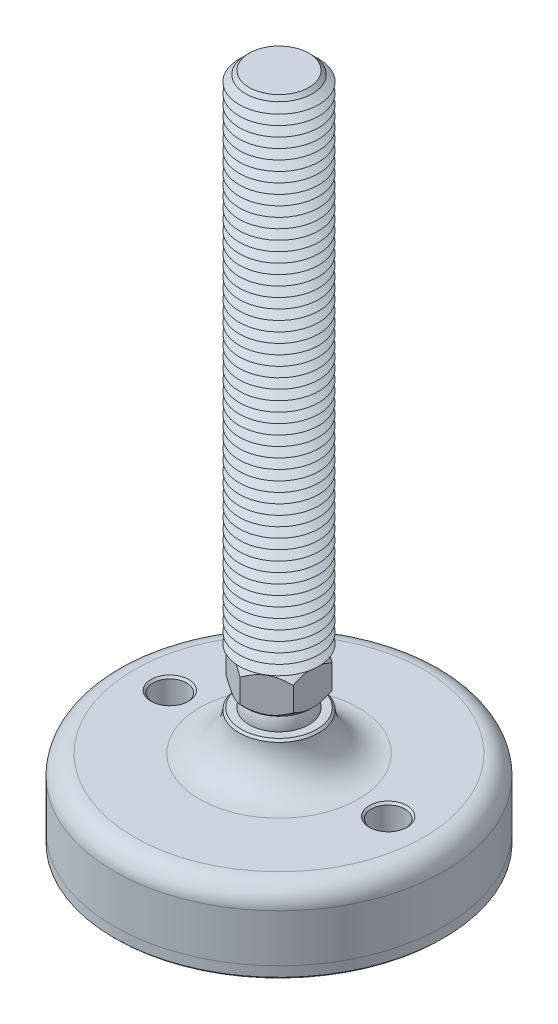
ISO-10303-21;
HEADER;
FILE_DESCRIPTION(('STEP AP214'),'2;1');
FILE_NAME('part.step','',(''),(''),'','','');
FILE_SCHEMA(('AUTOMOTIVE_DESIGN { 1 0 10303 214 1 1 1 1 }'));
ENDSEC;
DATA;
#1=APPLICATION_CONTEXT('core data for automotive mechanical design processes');
#2=APPLICATION_PROTOCOL_DEFINITION('international standard','automotive_design',2000,#1);
#3=PRODUCT_CONTEXT('',#1,'mechanical');
#4=PRODUCT('Part','Part','',(#3));
#5=PRODUCT_RELATED_PRODUCT_CATEGORY('part','',(#4));
#6=PRODUCT_DEFINITION_FORMATION('','',#4);
#7=PRODUCT_DEFINITION_CONTEXT('part definition',#1,'design');
#8=PRODUCT_DEFINITION('design','',#6,#7);
#9=PRODUCT_DEFINITION_SHAPE('','',#8);
#10=(LENGTH_UNIT() NAMED_UNIT(*) SI_UNIT(.MILLI.,.METRE.));
#11=(NAMED_UNIT(*) PLANE_ANGLE_UNIT() SI_UNIT($,.RADIAN.));
#12=(NAMED_UNIT(*) SI_UNIT($,.STERADIAN.) SOLID_ANGLE_UNIT());
#13=UNCERTAINTY_MEASURE_WITH_UNIT(LENGTH_MEASURE(1.E-05),#10,'distance_accuracy_value','');
#14=(GEOMETRIC_REPRESENTATION_CONTEXT(3) GLOBAL_UNCERTAINTY_ASSIGNED_CONTEXT((#13)) GLOBAL_UNIT_ASSIGNED_CONTEXT((#10,
#11,#12)) REPRESENTATION_CONTEXT('',''));
#15=CARTESIAN_POINT('',(0.,0.,0.));
#16=DIRECTION('',(0.,0.,1.));
#17=DIRECTION('',(1.,0.,0.));
#18=AXIS2_PLACEMENT_3D('',#15,#16,#17);
#19=CARTESIAN_POINT('',(0.,-27.,0.));
#20=DIRECTION('',(0.,1.,0.));
#21=DIRECTION('',(0.,0.,1.));
#22=AXIS2_PLACEMENT_3D('',#19,#20,#21);
#23=PLANE('',#22);
#24=CARTESIAN_POINT('',(-27.5,-27.,0.));
#25=DIRECTION('',(0.,1.,0.));
#26=DIRECTION('',(0.,0.,1.));
#27=AXIS2_PLACEMENT_3D('',#24,#25,#26);
#28=CIRCLE('',#27,4.25000000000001);
#29=CARTESIAN_POINT('',(-27.5,-27.,4.25000000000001));
#30=VERTEX_POINT('',#29);
#31=EDGE_CURVE('P0_E43',#30,#30,#28,.T.);
#32=ORIENTED_EDGE('',*,*,#31,.F.);
#33=EDGE_LOOP('',(#32));
#34=FACE_BOUND('',#33,.T.);
#35=CARTESIAN_POINT('',(27.5,-27.,0.));
#36=DIRECTION('',(0.,1.,0.));
#37=DIRECTION('',(0.,0.,1.));
#38=AXIS2_PLACEMENT_3D('',#35,#36,#37);
#39=CIRCLE('',#38,4.25000000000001);
#40=CARTESIAN_POINT('',(27.5,-27.,4.25000000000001));
#41=VERTEX_POINT('',#40);
#42=EDGE_CURVE('P0_E44',#41,#41,#39,.T.);
#43=ORIENTED_EDGE('',*,*,#42,.F.);
#44=EDGE_LOOP('',(#43));
#45=FACE_BOUND('',#44,.T.);
#46=CARTESIAN_POINT('',(0.,-27.,0.));
#47=DIRECTION('',(0.,1.,0.));
#48=DIRECTION('',(0.,0.,1.));
#49=AXIS2_PLACEMENT_3D('',#46,#47,#48);
#50=CIRCLE('',#49,41.5);
#51=CARTESIAN_POINT('',(0.,-27.,41.5));
#52=VERTEX_POINT('',#51);
#53=EDGE_CURVE('P0_E40',#52,#52,#50,.T.);
#54=ORIENTED_EDGE('',*,*,#53,.T.);
#55=EDGE_LOOP('',(#54));
#56=FACE_BOUND('',#55,.T.);
#57=ADVANCED_FACE('P0_F14',(#34,#45,#56),#23,.T.);
#58=CARTESIAN_POINT('',(0.,48.1654938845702,0.));
#59=DIRECTION('',(0.,1.,0.));
#60=DIRECTION('',(0.,0.,1.));
#61=AXIS2_PLACEMENT_3D('',#58,#59,#60);
#62=CYLINDRICAL_SURFACE('',#61,41.5);
#63=CARTESIAN_POINT('',(0.,-29.5,0.));
#64=DIRECTION('',(0.,-1.,0.));
#65=DIRECTION('',(0.,0.,-1.));
#66=AXIS2_PLACEMENT_3D('',#63,#64,#65);
#67=CIRCLE('',#66,41.5);
#68=CARTESIAN_POINT('',(0.,-29.5,-41.5));
#69=VERTEX_POINT('',#68);
#70=EDGE_CURVE('P0_E37',#69,#69,#67,.F.);
#71=ORIENTED_EDGE('',*,*,#70,.T.);
#72=EDGE_LOOP('',(#71));
#73=FACE_BOUND('',#72,.T.);
#74=ORIENTED_EDGE('',*,*,#53,.F.);
#75=EDGE_LOOP('',(#74));
#76=FACE_BOUND('',#75,.T.);
#77=ADVANCED_FACE('P0_F54',(#73,#76),#62,.T.);
#78=CARTESIAN_POINT('',(0.,-30.,41.5));
#79=DIRECTION('',(0.,-1.,0.));
#80=DIRECTION('',(0.,0.,-1.));
#81=AXIS2_PLACEMENT_3D('',#78,#79,#80);
#82=PLANE('',#81);
#83=CARTESIAN_POINT('',(27.5,-30.,0.));
#84=DIRECTION('',(0.,-1.,0.));
#85=DIRECTION('',(0.,0.,-1.));
#86=AXIS2_PLACEMENT_3D('',#83,#84,#85);
#87=CIRCLE('',#86,4.75);
#88=CARTESIAN_POINT('',(27.5,-30.,-4.75000000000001));
#89=VERTEX_POINT('',#88);
#90=EDGE_CURVE('P0_E25',#89,#89,#87,.F.);
#91=ORIENTED_EDGE('',*,*,#90,.T.);
#92=EDGE_LOOP('',(#91));
#93=FACE_BOUND('',#92,.T.);
#94=CARTESIAN_POINT('',(-27.5,-30.,0.));
#95=DIRECTION('',(0.,-1.,0.));
#96=DIRECTION('',(0.,0.,-1.));
#97=AXIS2_PLACEMENT_3D('',#94,#95,#96);
#98=CIRCLE('',#97,4.75);
#99=CARTESIAN_POINT('',(-27.5,-30.,-4.75));
#100=VERTEX_POINT('',#99);
#101=EDGE_CURVE('P0_E29',#100,#100,#98,.F.);
#102=ORIENTED_EDGE('',*,*,#101,.T.);
#103=EDGE_LOOP('',(#102));
#104=FACE_BOUND('',#103,.T.);
#105=CARTESIAN_POINT('',(0.,-30.,0.));
#106=DIRECTION('',(0.,-1.,0.));
#107=DIRECTION('',(0.,0.,-1.));
#108=AXIS2_PLACEMENT_3D('',#105,#106,#107);
#109=CIRCLE('',#108,41.);
#110=CARTESIAN_POINT('',(0.,-30.,-41.));
#111=VERTEX_POINT('',#110);
#112=EDGE_CURVE('P0_E34',#111,#111,#109,.T.);
#113=ORIENTED_EDGE('',*,*,#112,.T.);
#114=EDGE_LOOP('',(#113));
#115=FACE_BOUND('',#114,.T.);
#116=ADVANCED_FACE('P0_F61',(#93,#104,#115),#82,.T.);
#117=CARTESIAN_POINT('',(0.,-29.5,0.));
#118=DIRECTION('',(0.,1.,0.));
#119=DIRECTION('',(0.,0.,1.));
#120=AXIS2_PLACEMENT_3D('',#117,#118,#119);
#121=CONICAL_SURFACE('',#120,41.5,0.785398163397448);
#122=ORIENTED_EDGE('',*,*,#112,.F.);
#123=EDGE_LOOP('',(#122));
#124=FACE_BOUND('',#123,.T.);
#125=ORIENTED_EDGE('',*,*,#70,.F.);
#126=EDGE_LOOP('',(#125));
#127=FACE_BOUND('',#126,.T.);
#128=ADVANCED_FACE('P0_F68',(#124,#127),#121,.T.);
#129=CARTESIAN_POINT('',(27.5,-30.,0.));
#130=DIRECTION('',(0.,1.,0.));
#131=DIRECTION('',(0.,0.,1.));
#132=AXIS2_PLACEMENT_3D('',#129,#130,#131);
#133=CYLINDRICAL_SURFACE('',#132,4.25000000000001);
#134=CARTESIAN_POINT('',(27.5,-29.5,0.));
#135=DIRECTION('',(0.,-1.,0.));
#136=DIRECTION('',(0.,0.,-1.));
#137=AXIS2_PLACEMENT_3D('',#134,#135,#136);
#138=CIRCLE('',#137,4.25000000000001);
#139=CARTESIAN_POINT('',(27.5,-29.5,-4.25000000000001));
#140=VERTEX_POINT('',#139);
#141=EDGE_CURVE('P0_E21',#140,#140,#138,.T.);
#142=ORIENTED_EDGE('',*,*,#141,.T.);
#143=EDGE_LOOP('',(#142));
#144=FACE_BOUND('',#143,.T.);
#145=ORIENTED_EDGE('',*,*,#42,.T.);
#146=EDGE_LOOP('',(#145));
#147=FACE_BOUND('',#146,.T.);
#148=ADVANCED_FACE('P0_F74',(#144,#147),#133,.F.);
#149=CARTESIAN_POINT('',(-27.5,-30.,0.));
#150=DIRECTION('',(0.,1.,0.));
#151=DIRECTION('',(0.,0.,1.));
#152=AXIS2_PLACEMENT_3D('',#149,#150,#151);
#153=CYLINDRICAL_SURFACE('',#152,4.25000000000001);
#154=CARTESIAN_POINT('',(-27.5,-29.5,0.));
#155=DIRECTION('',(0.,-1.,0.));
#156=DIRECTION('',(0.,0.,-1.));
#157=AXIS2_PLACEMENT_3D('',#154,#155,#156);
#158=CIRCLE('',#157,4.25000000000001);
#159=CARTESIAN_POINT('',(-27.5,-29.5,-4.25000000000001));
#160=VERTEX_POINT('',#159);
#161=EDGE_CURVE('P0_E10',#160,#160,#158,.T.);
#162=ORIENTED_EDGE('',*,*,#161,.T.);
#163=EDGE_LOOP('',(#162));
#164=FACE_BOUND('',#163,.T.);
#165=ORIENTED_EDGE('',*,*,#31,.T.);
#166=EDGE_LOOP('',(#165));
#167=FACE_BOUND('',#166,.T.);
#168=ADVANCED_FACE('P0_F50',(#164,#167),#153,.F.);
#169=CARTESIAN_POINT('',(27.5,-30.,0.));
#170=DIRECTION('',(0.,-1.,0.));
#171=DIRECTION('',(0.,0.,-1.));
#172=AXIS2_PLACEMENT_3D('',#169,#170,#171);
#173=CONICAL_SURFACE('',#172,4.75,0.785398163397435);
#174=ORIENTED_EDGE('',*,*,#141,.F.);
#175=EDGE_LOOP('',(#174));
#176=FACE_BOUND('',#175,.T.);
#177=ORIENTED_EDGE('',*,*,#90,.F.);
#178=EDGE_LOOP('',(#177));
#179=FACE_BOUND('',#178,.T.);
#180=ADVANCED_FACE('P0_F76',(#176,#179),#173,.F.);
#181=CARTESIAN_POINT('',(-27.5,-30.,0.));
#182=DIRECTION('',(0.,-1.,0.));
#183=DIRECTION('',(0.,0.,-1.));
#184=AXIS2_PLACEMENT_3D('',#181,#182,#183);
#185=CONICAL_SURFACE('',#184,4.75,0.785398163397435);
#186=ORIENTED_EDGE('',*,*,#161,.F.);
#187=EDGE_LOOP('',(#186));
#188=FACE_BOUND('',#187,.T.);
#189=ORIENTED_EDGE('',*,*,#101,.F.);
#190=EDGE_LOOP('',(#189));
#191=FACE_BOUND('',#190,.T.);
#192=ADVANCED_FACE('P0_F16',(#188,#191),#185,.F.);
#193=CLOSED_SHELL('',(#57,#77,#116,#128,#148,#168,#180,#192));
#194=MANIFOLD_SOLID_BREP('P0_B1',#193);
#195=CARTESIAN_POINT('',(0.,3.75,0.));
#196=DIRECTION('',(0.,1.,0.));
#197=DIRECTION('',(0.,0.,1.));
#198=AXIS2_PLACEMENT_3D('',#195,#196,#197);
#199=PLANE('',#198);
#200=CARTESIAN_POINT('',(0.,3.75,0.));
#201=DIRECTION('',(0.,1.,0.));
#202=DIRECTION('',(0.,0.,1.));
#203=AXIS2_PLACEMENT_3D('',#200,#201,#202);
#204=CIRCLE('',#203,7.99624373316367);
#205=CARTESIAN_POINT('',(0.,3.75,7.99624373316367));
#206=VERTEX_POINT('',#205);
#207=EDGE_CURVE('P1_E213',#206,#206,#204,.T.);
#208=ORIENTED_EDGE('',*,*,#207,.F.);
#209=EDGE_LOOP('',(#208));
#210=FACE_BOUND('',#209,.T.);
#211=CARTESIAN_POINT('',(0.,3.75,0.));
#212=DIRECTION('',(0.,1.,0.));
#213=DIRECTION('',(0.,0.,1.));
#214=AXIS2_PLACEMENT_3D('',#211,#212,#213);
#215=CIRCLE('',#214,6.49519052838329);
#216=CARTESIAN_POINT('',(0.,3.75,6.49519052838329));
#217=VERTEX_POINT('',#216);
#218=EDGE_CURVE('P1_E25',#217,#217,#215,.F.);
#219=ORIENTED_EDGE('',*,*,#218,.F.);
#220=EDGE_LOOP('',(#219));
#221=FACE_BOUND('',#220,.T.);
#222=ADVANCED_FACE('P1_F16',(#210,#221),#199,.F.);
#223=CARTESIAN_POINT('',(0.,0.,0.));
#224=DIRECTION('',(0.,1.,0.));
#225=DIRECTION('',(0.,0.,-1.));
#226=AXIS2_PLACEMENT_3D('',#223,#224,#225);
#227=SPHERICAL_SURFACE('',#226,7.5);
#228=ORIENTED_EDGE('',*,*,#218,.T.);
#229=EDGE_LOOP('',(#228));
#230=FACE_BOUND('',#229,.T.);
#231=ADVANCED_FACE('P1_F203',(#230),#227,.T.);
#232=CARTESIAN_POINT('',(0.,3.75,0.));
#233=DIRECTION('',(0.,1.,0.));
#234=DIRECTION('',(0.,0.,1.));
#235=AXIS2_PLACEMENT_3D('',#232,#233,#234);
#236=CONICAL_SURFACE('',#235,7.99624373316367,0.785398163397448);
#237=ORIENTED_EDGE('',*,*,#207,.T.);
#238=EDGE_LOOP('',(#237));
#239=FACE_BOUND('',#238,.T.);
#240=CARTESIAN_POINT('',(-8.5,8.90811002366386,-10.0392740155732));
#241=CARTESIAN_POINT('',(-8.5,8.72243436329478,-9.79593020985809));
#242=CARTESIAN_POINT('',(-8.5,8.53847898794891,-9.55125250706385));
#243=CARTESIAN_POINT('',(-8.5,8.17478786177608,-9.05869243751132));
#244=CARTESIAN_POINT('',(-8.5,7.99505314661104,-8.81080930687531));
#245=CARTESIAN_POINT('',(-8.5,7.63930320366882,-8.30948839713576));
#246=CARTESIAN_POINT('',(-8.5,7.46332748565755,-8.05602248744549));
#247=CARTESIAN_POINT('',(-8.5,7.11769199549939,-7.54483399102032));
#248=CARTESIAN_POINT('',(-8.5,6.94803178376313,-7.28711170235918));
#249=CARTESIAN_POINT('',(-8.5,6.60640236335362,-6.75094027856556));
#250=CARTESIAN_POINT('',(-8.5,6.43491645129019,-6.47218164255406));
#251=CARTESIAN_POINT('',(-8.5,6.10286460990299,-5.90813314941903));
#252=CARTESIAN_POINT('',(-8.5,5.94230047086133,-5.62284223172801));
#253=CARTESIAN_POINT('',(-8.5,5.63553180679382,-5.04569727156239));
#254=CARTESIAN_POINT('',(-8.5,5.48928508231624,-4.75386583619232));
#255=CARTESIAN_POINT('',(-8.5,5.21442695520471,-4.16207917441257));
#256=CARTESIAN_POINT('',(-8.5,5.08580737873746,-3.86212779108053));
#257=CARTESIAN_POINT('',(-8.5,4.86150447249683,-3.28118098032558));
#258=CARTESIAN_POINT('',(-8.5,4.7638906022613,-3.00093864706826));
#259=CARTESIAN_POINT('',(-8.5,4.59111419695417,-2.43348682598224));
#260=CARTESIAN_POINT('',(-8.5,4.51595314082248,-2.14627688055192));
#261=CARTESIAN_POINT('',(-8.5,4.39333737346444,-1.57150580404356));
#262=CARTESIAN_POINT('',(-8.5,4.34539220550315,-1.28405106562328));
#263=CARTESIAN_POINT('',(-8.5,4.27817908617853,-0.705789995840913));
#264=CARTESIAN_POINT('',(-8.5,4.25890565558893,-0.41498431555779));
#265=CARTESIAN_POINT('',(-8.5,4.25058550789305,0.155345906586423));
#266=CARTESIAN_POINT('',(-8.5,4.2603535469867,0.434853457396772));
#267=CARTESIAN_POINT('',(-8.5,4.30689978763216,0.991595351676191));
#268=CARTESIAN_POINT('',(-8.5,4.34368052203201,1.26882947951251));
#269=CARTESIAN_POINT('',(-8.5,4.44283018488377,1.82371054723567));
#270=CARTESIAN_POINT('',(-8.5,4.50564357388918,2.10127674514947));
#271=CARTESIAN_POINT('',(-8.5,4.65343378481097,2.6503272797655));
#272=CARTESIAN_POINT('',(-8.5,4.73840907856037,2.9218120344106));
#273=CARTESIAN_POINT('',(-8.5,4.93373614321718,3.47773657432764));
#274=CARTESIAN_POINT('',(-8.5,5.04548526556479,3.7616800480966));
#275=CARTESIAN_POINT('',(-8.5,5.28620549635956,4.3222352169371));
#276=CARTESIAN_POINT('',(-8.5,5.41518447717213,4.59884349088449));
#277=CARTESIAN_POINT('',(-8.5,5.68730204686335,5.14605293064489));
#278=CARTESIAN_POINT('',(-8.5,5.8304846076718,5.41663205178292));
#279=CARTESIAN_POINT('',(-8.5,6.1278527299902,5.95157955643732));
#280=CARTESIAN_POINT('',(-8.5,6.28203657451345,6.21594890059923));
#281=CARTESIAN_POINT('',(-8.5,6.59139861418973,6.7263367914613));
#282=CARTESIAN_POINT('',(-8.5,6.74614943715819,6.97261575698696));
#283=CARTESIAN_POINT('',(-8.5,7.06220691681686,7.46094357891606));
#284=CARTESIAN_POINT('',(-8.5,7.22351406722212,7.70299211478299));
#285=CARTESIAN_POINT('',(-8.5,7.55019288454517,8.18145952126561));
#286=CARTESIAN_POINT('',(-8.5,7.71552125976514,8.4179080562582));
#287=CARTESIAN_POINT('',(-8.5,8.05058640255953,8.88756615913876));
#288=CARTESIAN_POINT('',(-8.5,8.22032194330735,9.12077660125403));
#289=CARTESIAN_POINT('',(-8.5,8.39186061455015,9.35262965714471));
#290=B_SPLINE_CURVE_WITH_KNOTS('',3,(#240,#241,#242,#243,#244,#245,#246,#247,#248,#249,#250,
#251,#252,#253,#254,#255,#256,#257,#258,#259,#260,#261,#262,#263,#264,#265,#266,#267,#268,#269,
#270,#271,#272,#273,#274,#275,#276,#277,#278,#279,#280,#281,#282,#283,#284,#285,#286,#287,#288,
#289),.UNSPECIFIED.,.F.,.F.,(4,2,2,2,2,2,2,2,2,2,2,2,2,2,2,2,2,2,2,2,2,2,2,2,4),(0.,
0.918290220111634,1.8368034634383,2.76241942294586,3.68797083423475,4.66961920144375,
5.65142809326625,6.63025007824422,7.60861662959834,8.49811159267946,9.38766513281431,
10.2606329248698,11.1334338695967,11.9711093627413,12.8088634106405,13.6615517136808,
14.5141812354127,15.4289018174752,16.3440417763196,17.2621089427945,18.1800331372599,
19.0524996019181,19.9250318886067,20.7905246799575,21.6557790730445),.UNSPECIFIED.);
#291=CARTESIAN_POINT('',(-8.5,5.56871084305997,-4.90747728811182));
#292=VERTEX_POINT('',#291);
#293=CARTESIAN_POINT('',(-8.5,5.56871084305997,4.90747728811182));
#294=VERTEX_POINT('',#293);
#295=EDGE_CURVE('P1_E187',#292,#294,#290,.T.);
#296=ORIENTED_EDGE('',*,*,#295,.F.);
#297=CARTESIAN_POINT('',(0.000199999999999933,5.5688263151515,-9.81507004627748));
#298=CARTESIAN_POINT('',(-0.145938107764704,5.48446627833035,-9.73069717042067));
#299=CARTESIAN_POINT('',(-0.293216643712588,5.40268088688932,-9.6456658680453));
#300=CARTESIAN_POINT('',(-0.590240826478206,5.24507616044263,-9.47417887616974));
#301=CARTESIAN_POINT('',(-0.739987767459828,5.16926008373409,-9.38772243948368));
#302=CARTESIAN_POINT('',(-1.0428413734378,5.02408965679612,-9.21286982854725));
#303=CARTESIAN_POINT('',(-1.19596236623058,4.95477479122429,-9.12446538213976));
#304=CARTESIAN_POINT('',(-1.50468648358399,4.82411695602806,-8.94622342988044));
#305=CARTESIAN_POINT('',(-1.66028922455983,4.76277276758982,-8.85638614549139));
#306=CARTESIAN_POINT('',(-2.12594374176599,4.59407400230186,-8.58754038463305));
#307=CARTESIAN_POINT('',(-2.4397129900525,4.49965525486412,-8.4063856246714));
#308=CARTESIAN_POINT('',(-2.91546156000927,4.39044680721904,-8.13171205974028));
#309=CARTESIAN_POINT('',(-3.07473438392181,4.35946186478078,-8.03975585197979));
#310=CARTESIAN_POINT('',(-3.39463410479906,4.3089933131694,-7.85506166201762));
#311=CARTESIAN_POINT('',(-3.5552607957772,4.28950798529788,-7.76232379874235));
#312=CARTESIAN_POINT('',(-3.9466882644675,4.25683795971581,-7.5363330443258));
#313=CARTESIAN_POINT('',(-4.17791015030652,4.24998362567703,-7.4028370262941));
#314=CARTESIAN_POINT('',(-4.63993781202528,4.26149030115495,-7.13608523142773));
#315=CARTESIAN_POINT('',(-4.87074341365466,4.27986014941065,-7.00282955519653));
#316=CARTESIAN_POINT('',(-5.33017839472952,4.34073256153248,-6.73757464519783));
#317=CARTESIAN_POINT('',(-5.55880504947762,4.38326211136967,-6.60557698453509));
#318=CARTESIAN_POINT('',(-6.01212885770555,4.49014170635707,-6.34385036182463));
#319=CARTESIAN_POINT('',(-6.23682631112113,4.55449007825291,-6.21412122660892));
#320=CARTESIAN_POINT('',(-6.63569693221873,4.686871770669,-5.98383316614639));
#321=CARTESIAN_POINT('',(-6.81075347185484,4.75142294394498,-5.88276422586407));
#322=CARTESIAN_POINT('',(-7.15772421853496,4.89092708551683,-5.68244057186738));
#323=CARTESIAN_POINT('',(-7.3296383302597,4.96588036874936,-5.58318591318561));
#324=CARTESIAN_POINT('',(-7.6697827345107,5.12450866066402,-5.38680344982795));
#325=CARTESIAN_POINT('',(-7.8380227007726,5.20815624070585,-5.28967006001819));
#326=CARTESIAN_POINT('',(-8.17138743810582,5.38307502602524,-5.09720183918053));
#327=CARTESIAN_POINT('',(-8.33651404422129,5.47434155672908,-5.00186594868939));
#328=CARTESIAN_POINT('',(-8.5002,5.5688263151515,-4.90736181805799));
#329=B_SPLINE_CURVE_WITH_KNOTS('',3,(#297,#298,#299,#300,#301,#302,#303,#304,#305,#306,#307,
#308,#309,#310,#311,#312,#313,#314,#315,#316,#317,#318,#319,#320,#321,#322,#323,#324,#325,#326,
#327,#328),.UNSPECIFIED.,.F.,.F.,(4,2,2,2,2,2,2,2,2,2,2,2,2,2,2,4),(0.,0.565988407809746,
1.13228364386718,1.70182141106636,2.27127198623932,3.39189520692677,3.95110786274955,
4.510236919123,5.31023384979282,6.11051117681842,6.91168416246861,7.71279572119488,
8.34908108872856,8.98538572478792,9.61974061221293,10.2537091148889),.UNSPECIFIED.);
#330=CARTESIAN_POINT('',(0.,5.56871084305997,-9.81495457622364));
#331=VERTEX_POINT('',#330);
#332=EDGE_CURVE('P1_E181',#331,#292,#329,.T.);
#333=ORIENTED_EDGE('',*,*,#332,.F.);
#334=CARTESIAN_POINT('',(8.5002,5.56882631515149,-4.90736181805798));
#335=CARTESIAN_POINT('',(8.3540618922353,5.48446627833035,-4.9917346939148));
#336=CARTESIAN_POINT('',(8.20678335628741,5.40268088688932,-5.07676599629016));
#337=CARTESIAN_POINT('',(7.90975917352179,5.24507616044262,-5.24825298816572));
#338=CARTESIAN_POINT('',(7.76001223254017,5.16926008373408,-5.33470942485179));
#339=CARTESIAN_POINT('',(7.4571586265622,5.02408965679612,-5.50956203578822));
#340=CARTESIAN_POINT('',(7.30403763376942,4.95477479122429,-5.59796648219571));
#341=CARTESIAN_POINT('',(6.99531351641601,4.82411695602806,-5.77620843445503));
#342=CARTESIAN_POINT('',(6.83971077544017,4.76277276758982,-5.86604571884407));
#343=CARTESIAN_POINT('',(6.37405625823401,4.59407400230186,-6.13489147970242));
#344=CARTESIAN_POINT('',(6.0602870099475,4.49965525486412,-6.31604623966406));
#345=CARTESIAN_POINT('',(5.58453843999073,4.39044680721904,-6.59071980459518));
#346=CARTESIAN_POINT('',(5.42526561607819,4.35946186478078,-6.68267601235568));
#347=CARTESIAN_POINT('',(5.10536589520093,4.3089933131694,-6.86737020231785));
#348=CARTESIAN_POINT('',(4.9447392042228,4.28950798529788,-6.96010806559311));
#349=CARTESIAN_POINT('',(4.5533117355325,4.25683795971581,-7.18609882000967));
#350=CARTESIAN_POINT('',(4.32208984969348,4.24998362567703,-7.31959483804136));
#351=CARTESIAN_POINT('',(3.86006218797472,4.26149030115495,-7.58634663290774));
#352=CARTESIAN_POINT('',(3.62925658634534,4.27986014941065,-7.71960230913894));
#353=CARTESIAN_POINT('',(3.16982160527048,4.34073256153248,-7.98485721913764));
#354=CARTESIAN_POINT('',(2.94119495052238,4.38326211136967,-8.11685487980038));
#355=CARTESIAN_POINT('',(2.48787114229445,4.49014170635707,-8.37858150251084));
#356=CARTESIAN_POINT('',(2.26317368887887,4.55449007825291,-8.50831063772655));
#357=CARTESIAN_POINT('',(1.86430306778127,4.686871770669,-8.73859869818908));
#358=CARTESIAN_POINT('',(1.68924652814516,4.75142294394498,-8.83966763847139));
#359=CARTESIAN_POINT('',(1.34227578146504,4.89092708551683,-9.03999129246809));
#360=CARTESIAN_POINT('',(1.1703616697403,4.96588036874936,-9.13924595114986));
#361=CARTESIAN_POINT('',(0.8302172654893,5.12450866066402,-9.33562841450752));
#362=CARTESIAN_POINT('',(0.661977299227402,5.20815624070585,-9.43276180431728));
#363=CARTESIAN_POINT('',(0.328612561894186,5.38307502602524,-9.62523002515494));
#364=CARTESIAN_POINT('',(0.163485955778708,5.47434155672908,-9.72056591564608));
#365=CARTESIAN_POINT('',(-0.000200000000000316,5.5688263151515,-9.81507004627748));
#366=B_SPLINE_CURVE_WITH_KNOTS('',3,(#334,#335,#336,#337,#338,#339,#340,#341,#342,#343,#344,
#345,#346,#347,#348,#349,#350,#351,#352,#353,#354,#355,#356,#357,#358,#359,#360,#361,#362,#363,
#364,#365),.UNSPECIFIED.,.F.,.F.,(4,2,2,2,2,2,2,2,2,2,2,2,2,2,2,4),(0.,0.565988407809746,
1.13228364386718,1.70182141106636,2.27127198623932,3.39189520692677,3.95110786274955,
4.510236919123,5.31023384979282,6.11051117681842,6.91168416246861,7.71279572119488,
8.34908108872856,8.98538572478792,9.61974061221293,10.2537091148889),.UNSPECIFIED.);
#367=CARTESIAN_POINT('',(8.5,5.56871084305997,-4.90747728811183));
#368=VERTEX_POINT('',#367);
#369=EDGE_CURVE('P1_E169',#368,#331,#366,.T.);
#370=ORIENTED_EDGE('',*,*,#369,.F.);
#371=CARTESIAN_POINT('',(8.5,8.90811002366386,-10.0392740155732));
#372=CARTESIAN_POINT('',(8.5,8.72243436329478,-9.79593020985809));
#373=CARTESIAN_POINT('',(8.5,8.5384789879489,-9.55125250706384));
#374=CARTESIAN_POINT('',(8.5,8.17478786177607,-9.05869243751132));
#375=CARTESIAN_POINT('',(8.5,7.99505314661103,-8.81080930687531));
#376=CARTESIAN_POINT('',(8.5,7.63930320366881,-8.30948839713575));
#377=CARTESIAN_POINT('',(8.5,7.46332748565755,-8.05602248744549));
#378=CARTESIAN_POINT('',(8.5,7.11769199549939,-7.54483399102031));
#379=CARTESIAN_POINT('',(8.5,6.94803178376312,-7.28711170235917));
#380=CARTESIAN_POINT('',(8.5,6.60640236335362,-6.75094027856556));
#381=CARTESIAN_POINT('',(8.5,6.43491645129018,-6.47218164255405));
#382=CARTESIAN_POINT('',(8.5,6.10286460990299,-5.90813314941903));
#383=CARTESIAN_POINT('',(8.5,5.94230047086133,-5.62284223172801));
#384=CARTESIAN_POINT('',(8.5,5.63553180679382,-5.04569727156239));
#385=CARTESIAN_POINT('',(8.5,5.48928508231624,-4.75386583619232));
#386=CARTESIAN_POINT('',(8.5,5.21442695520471,-4.16207917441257));
#387=CARTESIAN_POINT('',(8.5,5.08580737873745,-3.86212779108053));
#388=CARTESIAN_POINT('',(8.5,4.86150447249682,-3.28118098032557));
#389=CARTESIAN_POINT('',(8.5,4.7638906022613,-3.00093864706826));
#390=CARTESIAN_POINT('',(8.5,4.59111419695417,-2.43348682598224));
#391=CARTESIAN_POINT('',(8.5,4.51595314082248,-2.14627688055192));
#392=CARTESIAN_POINT('',(8.5,4.39333737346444,-1.57150580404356));
#393=CARTESIAN_POINT('',(8.5,4.34539220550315,-1.28405106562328));
#394=CARTESIAN_POINT('',(8.5,4.27817908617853,-0.705789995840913));
#395=CARTESIAN_POINT('',(8.5,4.25890565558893,-0.41498431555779));
#396=CARTESIAN_POINT('',(8.5,4.25058550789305,0.155345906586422));
#397=CARTESIAN_POINT('',(8.5,4.2603535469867,0.434853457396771));
#398=CARTESIAN_POINT('',(8.5,4.30689978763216,0.99159535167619));
#399=CARTESIAN_POINT('',(8.5,4.34368052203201,1.2688294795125));
#400=CARTESIAN_POINT('',(8.5,4.44283018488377,1.82371054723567));
#401=CARTESIAN_POINT('',(8.5,4.50564357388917,2.10127674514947));
#402=CARTESIAN_POINT('',(8.5,4.65343378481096,2.65032727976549));
#403=CARTESIAN_POINT('',(8.5,4.73840907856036,2.9218120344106));
#404=CARTESIAN_POINT('',(8.5,4.93373614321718,3.47773657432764));
#405=CARTESIAN_POINT('',(8.5,5.04548526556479,3.7616800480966));
#406=CARTESIAN_POINT('',(8.5,5.28620549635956,4.3222352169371));
#407=CARTESIAN_POINT('',(8.5,5.41518447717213,4.59884349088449));
#408=CARTESIAN_POINT('',(8.5,5.68730204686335,5.14605293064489));
#409=CARTESIAN_POINT('',(8.5,5.8304846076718,5.41663205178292));
#410=CARTESIAN_POINT('',(8.5,6.1278527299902,5.95157955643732));
#411=CARTESIAN_POINT('',(8.5,6.28203657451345,6.21594890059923));
#412=CARTESIAN_POINT('',(8.5,6.59139861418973,6.7263367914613));
#413=CARTESIAN_POINT('',(8.5,6.74614943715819,6.97261575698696));
#414=CARTESIAN_POINT('',(8.5,7.06220691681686,7.46094357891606));
#415=CARTESIAN_POINT('',(8.5,7.22351406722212,7.70299211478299));
#416=CARTESIAN_POINT('',(8.5,7.55019288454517,8.18145952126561));
#417=CARTESIAN_POINT('',(8.5,7.71552125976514,8.4179080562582));
#418=CARTESIAN_POINT('',(8.5,8.05058640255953,8.88756615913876));
#419=CARTESIAN_POINT('',(8.5,8.22032194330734,9.12077660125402));
#420=CARTESIAN_POINT('',(8.5,8.39186061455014,9.35262965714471));
#421=B_SPLINE_CURVE_WITH_KNOTS('',3,(#371,#372,#373,#374,#375,#376,#377,#378,#379,#380,#381,
#382,#383,#384,#385,#386,#387,#388,#389,#390,#391,#392,#393,#394,#395,#396,#397,#398,#399,#400,
#401,#402,#403,#404,#405,#406,#407,#408,#409,#410,#411,#412,#413,#414,#415,#416,#417,#418,#419,
#420),.UNSPECIFIED.,.F.,.F.,(4,2,2,2,2,2,2,2,2,2,2,2,2,2,2,2,2,2,2,2,2,2,2,2,4),(0.,
0.918290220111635,1.8368034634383,2.76241942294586,3.68797083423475,4.66961920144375,
5.65142809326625,6.63025007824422,7.60861662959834,8.49811159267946,9.38766513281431,
10.2606329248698,11.1334338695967,11.9711093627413,12.8088634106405,13.6615517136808,
14.5141812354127,15.4289018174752,16.3440417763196,17.2621089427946,18.1800331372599,
19.0524996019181,19.9250318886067,20.7905246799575,21.6557790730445),.UNSPECIFIED.);
#422=CARTESIAN_POINT('',(8.5,5.56871084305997,4.90747728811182));
#423=VERTEX_POINT('',#422);
#424=EDGE_CURVE('P1_E71',#423,#368,#421,.F.);
#425=ORIENTED_EDGE('',*,*,#424,.F.);
#426=CARTESIAN_POINT('',(-0.000200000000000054,5.56882631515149,9.81507004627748));
#427=CARTESIAN_POINT('',(0.145938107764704,5.48446627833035,9.73069717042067));
#428=CARTESIAN_POINT('',(0.293216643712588,5.40268088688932,9.6456658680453));
#429=CARTESIAN_POINT('',(0.590240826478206,5.24507616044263,9.47417887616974));
#430=CARTESIAN_POINT('',(0.739987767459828,5.16926008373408,9.38772243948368));
#431=CARTESIAN_POINT('',(1.0428413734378,5.02408965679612,9.21286982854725));
#432=CARTESIAN_POINT('',(1.19596236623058,4.95477479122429,9.12446538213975));
#433=CARTESIAN_POINT('',(1.50468648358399,4.82411695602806,8.94622342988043));
#434=CARTESIAN_POINT('',(1.66028922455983,4.76277276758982,8.85638614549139));
#435=CARTESIAN_POINT('',(2.12594374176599,4.59407400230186,8.58754038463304));
#436=CARTESIAN_POINT('',(2.4397129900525,4.49965525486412,8.4063856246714));
#437=CARTESIAN_POINT('',(2.91546156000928,4.39044680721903,8.13171205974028));
#438=CARTESIAN_POINT('',(3.07473438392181,4.35946186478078,8.03975585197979));
#439=CARTESIAN_POINT('',(3.39463410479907,4.3089933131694,7.85506166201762));
#440=CARTESIAN_POINT('',(3.55526079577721,4.28950798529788,7.76232379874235));
#441=CARTESIAN_POINT('',(3.9466882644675,4.25683795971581,7.53633304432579));
#442=CARTESIAN_POINT('',(4.17791015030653,4.24998362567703,7.4028370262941));
#443=CARTESIAN_POINT('',(4.63993781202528,4.26149030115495,7.13608523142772));
#444=CARTESIAN_POINT('',(4.87074341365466,4.27986014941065,7.00282955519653));
#445=CARTESIAN_POINT('',(5.33017839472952,4.34073256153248,6.73757464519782));
#446=CARTESIAN_POINT('',(5.55880504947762,4.38326211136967,6.60557698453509));
#447=CARTESIAN_POINT('',(6.01212885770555,4.49014170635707,6.34385036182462));
#448=CARTESIAN_POINT('',(6.23682631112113,4.55449007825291,6.21412122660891));
#449=CARTESIAN_POINT('',(6.63569693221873,4.686871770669,5.98383316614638));
#450=CARTESIAN_POINT('',(6.81075347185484,4.75142294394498,5.88276422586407));
#451=CARTESIAN_POINT('',(7.15772421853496,4.89092708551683,5.68244057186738));
#452=CARTESIAN_POINT('',(7.3296383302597,4.96588036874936,5.58318591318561));
#453=CARTESIAN_POINT('',(7.6697827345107,5.12450866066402,5.38680344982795));
#454=CARTESIAN_POINT('',(7.8380227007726,5.20815624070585,5.28967006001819));
#455=CARTESIAN_POINT('',(8.17138743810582,5.38307502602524,5.09720183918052));
#456=CARTESIAN_POINT('',(8.33651404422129,5.47434155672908,5.00186594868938));
#457=CARTESIAN_POINT('',(8.5002,5.56882631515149,4.90736181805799));
#458=B_SPLINE_CURVE_WITH_KNOTS('',3,(#426,#427,#428,#429,#430,#431,#432,#433,#434,#435,#436,
#437,#438,#439,#440,#441,#442,#443,#444,#445,#446,#447,#448,#449,#450,#451,#452,#453,#454,#455,
#456,#457),.UNSPECIFIED.,.F.,.F.,(4,2,2,2,2,2,2,2,2,2,2,2,2,2,2,4),(0.,0.565988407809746,
1.13228364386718,1.70182141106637,2.27127198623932,3.39189520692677,3.95110786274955,
4.51023691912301,5.31023384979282,6.11051117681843,6.91168416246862,7.71279572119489,
8.34908108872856,8.98538572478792,9.61974061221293,10.2537091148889),.UNSPECIFIED.);
#459=CARTESIAN_POINT('',(0.,5.56871084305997,9.81495457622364));
#460=VERTEX_POINT('',#459);
#461=EDGE_CURVE('P1_E68',#460,#423,#458,.T.);
#462=ORIENTED_EDGE('',*,*,#461,.F.);
#463=CARTESIAN_POINT('',(-8.5002,5.56882631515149,4.90736181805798));
#464=CARTESIAN_POINT('',(-8.3540618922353,5.48446627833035,4.9917346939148));
#465=CARTESIAN_POINT('',(-8.20678335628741,5.40268088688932,5.07676599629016));
#466=CARTESIAN_POINT('',(-7.90975917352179,5.24507616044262,5.24825298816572));
#467=CARTESIAN_POINT('',(-7.76001223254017,5.16926008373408,5.33470942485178));
#468=CARTESIAN_POINT('',(-7.4571586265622,5.02408965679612,5.50956203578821));
#469=CARTESIAN_POINT('',(-7.30403763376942,4.95477479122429,5.59796648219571));
#470=CARTESIAN_POINT('',(-6.99531351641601,4.82411695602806,5.77620843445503));
#471=CARTESIAN_POINT('',(-6.83971077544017,4.76277276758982,5.86604571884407));
#472=CARTESIAN_POINT('',(-6.37405625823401,4.59407400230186,6.13489147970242));
#473=CARTESIAN_POINT('',(-6.0602870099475,4.49965525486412,6.31604623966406));
#474=CARTESIAN_POINT('',(-5.58453843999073,4.39044680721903,6.59071980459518));
#475=CARTESIAN_POINT('',(-5.42526561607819,4.35946186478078,6.68267601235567));
#476=CARTESIAN_POINT('',(-5.10536589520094,4.30899331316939,6.86737020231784));
#477=CARTESIAN_POINT('',(-4.9447392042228,4.28950798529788,6.96010806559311));
#478=CARTESIAN_POINT('',(-4.5533117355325,4.25683795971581,7.18609882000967));
#479=CARTESIAN_POINT('',(-4.32208984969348,4.24998362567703,7.31959483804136));
#480=CARTESIAN_POINT('',(-3.86006218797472,4.26149030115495,7.58634663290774));
#481=CARTESIAN_POINT('',(-3.62925658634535,4.27986014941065,7.71960230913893));
#482=CARTESIAN_POINT('',(-3.16982160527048,4.34073256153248,7.98485721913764));
#483=CARTESIAN_POINT('',(-2.94119495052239,4.38326211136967,8.11685487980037));
#484=CARTESIAN_POINT('',(-2.48787114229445,4.49014170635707,8.37858150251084));
#485=CARTESIAN_POINT('',(-2.26317368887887,4.55449007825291,8.50831063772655));
#486=CARTESIAN_POINT('',(-1.86430306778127,4.686871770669,8.73859869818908));
#487=CARTESIAN_POINT('',(-1.68924652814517,4.75142294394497,8.83966763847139));
#488=CARTESIAN_POINT('',(-1.34227578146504,4.89092708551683,9.03999129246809));
#489=CARTESIAN_POINT('',(-1.1703616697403,4.96588036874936,9.13924595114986));
#490=CARTESIAN_POINT('',(-0.830217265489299,5.12450866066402,9.33562841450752));
#491=CARTESIAN_POINT('',(-0.6619772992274,5.20815624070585,9.43276180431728));
#492=CARTESIAN_POINT('',(-0.328612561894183,5.38307502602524,9.62523002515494));
#493=CARTESIAN_POINT('',(-0.163485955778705,5.47434155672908,9.72056591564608));
#494=CARTESIAN_POINT('',(0.000200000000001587,5.5688263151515,9.81507004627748));
#495=B_SPLINE_CURVE_WITH_KNOTS('',3,(#463,#464,#465,#466,#467,#468,#469,#470,#471,#472,#473,
#474,#475,#476,#477,#478,#479,#480,#481,#482,#483,#484,#485,#486,#487,#488,#489,#490,#491,#492,
#493,#494),.UNSPECIFIED.,.F.,.F.,(4,2,2,2,2,2,2,2,2,2,2,2,2,2,2,4),(0.,0.565988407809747,
1.13228364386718,1.70182141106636,2.27127198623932,3.39189520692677,3.95110786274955,
4.510236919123,5.31023384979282,6.11051117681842,6.91168416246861,7.71279572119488,
8.34908108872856,8.98538572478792,9.61974061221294,10.2537091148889),.UNSPECIFIED.);
#496=EDGE_CURVE('P1_E40',#294,#460,#495,.T.);
#497=ORIENTED_EDGE('',*,*,#496,.F.);
#498=EDGE_LOOP('',(#296,#333,#370,#425,#462,#497));
#499=FACE_BOUND('',#498,.T.);
#500=ADVANCED_FACE('P1_F69',(#239,#499),#236,.T.);
#501=CARTESIAN_POINT('',(-8.5,14.,-4.90747728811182));
#502=DIRECTION('',(1.,0.,0.));
#503=DIRECTION('',(0.,0.,-1.));
#504=AXIS2_PLACEMENT_3D('',#501,#502,#503);
#505=PLANE('',#504);
#506=DIRECTION('',(0.,-1.,0.));
#507=VECTOR('',#506,1.);
#508=CARTESIAN_POINT('',(-8.5,14.,4.90747728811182));
#509=LINE('',#508,#507);
#510=CARTESIAN_POINT('',(-8.5,11.5462613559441,4.90747728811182));
#511=VERTEX_POINT('',#510);
#512=EDGE_CURVE('P1_E84',#511,#294,#509,.T.);
#513=ORIENTED_EDGE('',*,*,#512,.F.);
#514=CARTESIAN_POINT('',(-8.5,8.39798309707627,-9.78751273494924));
#515=CARTESIAN_POINT('',(-8.5,8.57787513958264,-9.54919755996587));
#516=CARTESIAN_POINT('',(-8.5,8.75602828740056,-9.30954807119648));
#517=CARTESIAN_POINT('',(-8.5,9.10807823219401,-8.827054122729));
#518=CARTESIAN_POINT('',(-8.5,9.2819739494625,-8.58420887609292));
#519=CARTESIAN_POINT('',(-8.5,9.62596686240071,-8.09302066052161));
#520=CARTESIAN_POINT('',(-8.5,9.79602418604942,-7.84464967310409));
#521=CARTESIAN_POINT('',(-8.5,10.1297912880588,-7.34369187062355));
#522=CARTESIAN_POINT('',(-8.5,10.2935015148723,-7.09110535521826));
#523=CARTESIAN_POINT('',(-8.5,10.6222985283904,-6.566468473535));
#524=CARTESIAN_POINT('',(-8.5,10.7869291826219,-6.29413078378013));
#525=CARTESIAN_POINT('',(-8.5,11.1053589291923,-5.74309849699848));
#526=CARTESIAN_POINT('',(-8.5,11.259156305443,-5.464402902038));
#527=CARTESIAN_POINT('',(-8.5,11.5526010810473,-4.90068072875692));
#528=CARTESIAN_POINT('',(-8.5,11.6922900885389,-4.61567598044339));
#529=CARTESIAN_POINT('',(-8.5,11.9543910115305,-4.0378936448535));
#530=CARTESIAN_POINT('',(-8.5,12.0768107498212,-3.74511964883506));
#531=CARTESIAN_POINT('',(-8.5,12.2910322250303,-3.17524396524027));
#532=CARTESIAN_POINT('',(-8.5,12.38450510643,-2.89877705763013));
#533=CARTESIAN_POINT('',(-8.5,12.5492711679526,-2.33918702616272));
#534=CARTESIAN_POINT('',(-8.5,12.6205628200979,-2.05606344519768));
#535=CARTESIAN_POINT('',(-8.5,12.7360573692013,-1.48955968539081));
#536=CARTESIAN_POINT('',(-8.5,12.7807243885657,-1.2062756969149));
#537=CARTESIAN_POINT('',(-8.5,12.8421027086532,-0.636679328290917));
#538=CARTESIAN_POINT('',(-8.5,12.8588188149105,-0.35036747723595));
#539=CARTESIAN_POINT('',(-8.5,12.8630538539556,0.212098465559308));
#540=CARTESIAN_POINT('',(-8.5,12.8516076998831,0.488245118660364));
#541=CARTESIAN_POINT('',(-8.5,12.8024337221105,1.03817300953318));
#542=CARTESIAN_POINT('',(-8.5,12.7647033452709,1.31195401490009));
#543=CARTESIAN_POINT('',(-8.5,12.6643776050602,1.85979788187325));
#544=CARTESIAN_POINT('',(-8.5,12.6013591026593,2.13378200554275));
#545=CARTESIAN_POINT('',(-8.5,12.4538179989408,2.67578043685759));
#546=CARTESIAN_POINT('',(-8.5,12.3692971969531,2.94379524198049));
#547=CARTESIAN_POINT('',(-8.5,12.1735358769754,3.49812653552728));
#548=CARTESIAN_POINT('',(-8.5,12.0605376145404,3.78381596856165));
#549=CARTESIAN_POINT('',(-8.5,11.8171932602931,4.34777400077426));
#550=CARTESIAN_POINT('',(-8.5,11.686839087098,4.62603907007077));
#551=CARTESIAN_POINT('',(-8.5,11.4118843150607,5.17650827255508));
#552=CARTESIAN_POINT('',(-8.5,11.2672389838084,5.44868988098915));
#553=CARTESIAN_POINT('',(-8.5,10.9668989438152,5.9867894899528));
#554=CARTESIAN_POINT('',(-8.5,10.811205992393,6.25270847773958));
#555=CARTESIAN_POINT('',(-8.5,10.4989138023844,6.76601719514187));
#556=CARTESIAN_POINT('',(-8.5,10.3427453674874,7.0136704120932));
#557=CARTESIAN_POINT('',(-8.5,10.0238413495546,7.50472523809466));
#558=CARTESIAN_POINT('',(-8.5,9.86110526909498,7.74812652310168));
#559=CARTESIAN_POINT('',(-8.5,9.53158408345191,8.22926020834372));
#560=CARTESIAN_POINT('',(-8.5,9.36484260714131,8.46702259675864));
#561=CARTESIAN_POINT('',(-8.5,9.02695015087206,8.93929808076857));
#562=CARTESIAN_POINT('',(-8.5,8.85580039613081,9.17381205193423));
#563=CARTESIAN_POINT('',(-8.5,8.68284834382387,9.40696575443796));
#564=B_SPLINE_CURVE_WITH_KNOTS('',3,(#514,#515,#516,#517,#518,#519,#520,#521,#522,#523,#524,
#525,#526,#527,#528,#529,#530,#531,#532,#533,#534,#535,#536,#537,#538,#539,#540,#541,#542,#543,
#544,#545,#546,#547,#548,#549,#550,#551,#552,#553,#554,#555,#556,#557,#558,#559,#560,#561,#562,
#563),.UNSPECIFIED.,.F.,.F.,(4,2,2,2,2,2,2,2,2,2,2,2,2,2,2,2,2,2,2,2,2,2,2,2,4),(0.,
0.895784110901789,1.79179309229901,2.69474460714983,3.59763220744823,4.55212531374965,
5.50676928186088,6.45851015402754,7.4098185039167,8.28457217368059,9.15938608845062,
10.0184667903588,10.8773997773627,11.7052430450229,12.5331667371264,13.3755635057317,
14.2178898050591,15.138846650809,16.060233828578,16.9846023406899,17.9088241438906,
18.7870452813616,19.6653330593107,20.5364863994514,21.4074001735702),.UNSPECIFIED.);
#565=CARTESIAN_POINT('',(-8.5,11.5462613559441,-4.90747728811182));
#566=VERTEX_POINT('',#565);
#567=EDGE_CURVE('P1_E85',#511,#566,#564,.F.);
#568=ORIENTED_EDGE('',*,*,#567,.T.);
#569=DIRECTION('',(0.,-1.,0.));
#570=VECTOR('',#569,1.);
#571=CARTESIAN_POINT('',(-8.5,14.,-4.90747728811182));
#572=LINE('',#571,#570);
#573=EDGE_CURVE('P1_E102',#566,#292,#572,.T.);
#574=ORIENTED_EDGE('',*,*,#573,.T.);
#575=ORIENTED_EDGE('',*,*,#295,.T.);
#576=EDGE_LOOP('',(#513,#568,#574,#575));
#577=FACE_BOUND('',#576,.T.);
#578=ADVANCED_FACE('P1_F195',(#577),#505,.F.);
#579=CARTESIAN_POINT('',(0.,14.,-9.81495457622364));
#580=DIRECTION('',(0.5,0.,0.866025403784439));
#581=DIRECTION('',(0.866025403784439,0.,-0.5));
#582=AXIS2_PLACEMENT_3D('',#579,#580,#581);
#583=PLANE('',#582);
#584=ORIENTED_EDGE('',*,*,#573,.F.);
#585=CARTESIAN_POINT('',(-8.5002,11.5461458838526,-4.90736181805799));
#586=CARTESIAN_POINT('',(-8.3540618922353,11.6305059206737,-4.9917346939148));
#587=CARTESIAN_POINT('',(-8.20678335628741,11.7122913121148,-5.07676599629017));
#588=CARTESIAN_POINT('',(-7.90975917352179,11.8698960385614,-5.24825298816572));
#589=CARTESIAN_POINT('',(-7.76001223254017,11.94571211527,-5.33470942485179));
#590=CARTESIAN_POINT('',(-7.4571586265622,12.0908825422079,-5.50956203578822));
#591=CARTESIAN_POINT('',(-7.30403763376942,12.1601974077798,-5.59796648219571));
#592=CARTESIAN_POINT('',(-6.99531351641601,12.290855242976,-5.77620843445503));
#593=CARTESIAN_POINT('',(-6.83971077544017,12.3521994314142,-5.86604571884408));
#594=CARTESIAN_POINT('',(-6.37405625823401,12.5208981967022,-6.13489147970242));
#595=CARTESIAN_POINT('',(-6.0602870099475,12.61531694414,-6.31604623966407));
#596=CARTESIAN_POINT('',(-5.58453843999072,12.724525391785,-6.59071980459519));
#597=CARTESIAN_POINT('',(-5.42526561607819,12.7555103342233,-6.68267601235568));
#598=CARTESIAN_POINT('',(-5.10536589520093,12.8059788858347,-6.86737020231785));
#599=CARTESIAN_POINT('',(-4.94473920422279,12.8254642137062,-6.96010806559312));
#600=CARTESIAN_POINT('',(-4.55331173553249,12.8581342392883,-7.18609882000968));
#601=CARTESIAN_POINT('',(-4.32208984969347,12.864988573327,-7.31959483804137));
#602=CARTESIAN_POINT('',(-3.86006218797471,12.8534818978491,-7.58634663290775));
#603=CARTESIAN_POINT('',(-3.62925658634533,12.8351120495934,-7.71960230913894));
#604=CARTESIAN_POINT('',(-3.16982160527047,12.7742396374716,-7.98485721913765));
#605=CARTESIAN_POINT('',(-2.94119495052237,12.7317100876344,-8.11685487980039));
#606=CARTESIAN_POINT('',(-2.48787114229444,12.624830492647,-8.37858150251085));
#607=CARTESIAN_POINT('',(-2.26317368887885,12.5604821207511,-8.50831063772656));
#608=CARTESIAN_POINT('',(-1.86430306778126,12.4281004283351,-8.73859869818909));
#609=CARTESIAN_POINT('',(-1.68924652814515,12.3635492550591,-8.8396676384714));
#610=CARTESIAN_POINT('',(-1.34227578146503,12.2240451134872,-9.03999129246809));
#611=CARTESIAN_POINT('',(-1.17036166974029,12.1490918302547,-9.13924595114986));
#612=CARTESIAN_POINT('',(-0.830217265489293,11.99046353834,-9.33562841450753));
#613=CARTESIAN_POINT('',(-0.661977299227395,11.9068159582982,-9.43276180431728));
#614=CARTESIAN_POINT('',(-0.328612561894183,11.7318971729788,-9.62523002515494));
#615=CARTESIAN_POINT('',(-0.163485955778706,11.640630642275,-9.72056591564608));
#616=CARTESIAN_POINT('',(0.000199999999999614,11.5461458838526,-9.81507004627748));
#617=B_SPLINE_CURVE_WITH_KNOTS('',3,(#585,#586,#587,#588,#589,#590,#591,#592,#593,#594,#595,
#596,#597,#598,#599,#600,#601,#602,#603,#604,#605,#606,#607,#608,#609,#610,#611,#612,#613,#614,
#615,#616),.UNSPECIFIED.,.F.,.F.,(4,2,2,2,2,2,2,2,2,2,2,2,2,2,2,4),(0.,0.565988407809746,
1.13228364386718,1.70182141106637,2.27127198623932,3.39189520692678,3.95110786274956,
4.51023691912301,5.31023384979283,6.11051117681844,6.91168416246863,7.7127957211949,
8.34908108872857,8.98538572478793,9.61974061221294,10.2537091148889),.UNSPECIFIED.);
#618=CARTESIAN_POINT('',(0.,11.5462613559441,-9.81495457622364));
#619=VERTEX_POINT('',#618);
#620=EDGE_CURVE('P1_E32',#566,#619,#617,.T.);
#621=ORIENTED_EDGE('',*,*,#620,.T.);
#622=DIRECTION('',(0.,-1.,0.));
#623=VECTOR('',#622,1.);
#624=CARTESIAN_POINT('',(0.,14.,-9.81495457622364));
#625=LINE('',#624,#623);
#626=EDGE_CURVE('P1_E99',#619,#331,#625,.T.);
#627=ORIENTED_EDGE('',*,*,#626,.T.);
#628=ORIENTED_EDGE('',*,*,#332,.T.);
#629=EDGE_LOOP('',(#584,#621,#627,#628));
#630=FACE_BOUND('',#629,.T.);
#631=ADVANCED_FACE('P1_F192',(#630),#583,.F.);
#632=CARTESIAN_POINT('',(8.5,14.,-4.90747728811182));
#633=DIRECTION('',(-0.5,0.,0.866025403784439));
#634=DIRECTION('',(0.866025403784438,0.,0.5));
#635=AXIS2_PLACEMENT_3D('',#632,#633,#634);
#636=PLANE('',#635);
#637=ORIENTED_EDGE('',*,*,#626,.F.);
#638=CARTESIAN_POINT('',(-0.000199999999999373,11.5461458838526,-9.81507004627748));
#639=CARTESIAN_POINT('',(0.145938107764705,11.6305059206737,-9.73069717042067));
#640=CARTESIAN_POINT('',(0.293216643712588,11.7122913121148,-9.6456658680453));
#641=CARTESIAN_POINT('',(0.590240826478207,11.8698960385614,-9.47417887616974));
#642=CARTESIAN_POINT('',(0.739987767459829,11.94571211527,-9.38772243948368));
#643=CARTESIAN_POINT('',(1.0428413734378,12.0908825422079,-9.21286982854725));
#644=CARTESIAN_POINT('',(1.19596236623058,12.1601974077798,-9.12446538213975));
#645=CARTESIAN_POINT('',(1.504686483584,12.290855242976,-8.94622342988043));
#646=CARTESIAN_POINT('',(1.66028922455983,12.3521994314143,-8.85638614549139));
#647=CARTESIAN_POINT('',(2.125943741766,12.5208981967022,-8.58754038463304));
#648=CARTESIAN_POINT('',(2.43971299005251,12.61531694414,-8.4063856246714));
#649=CARTESIAN_POINT('',(2.91546156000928,12.724525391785,-8.13171205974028));
#650=CARTESIAN_POINT('',(3.07473438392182,12.7555103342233,-8.03975585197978));
#651=CARTESIAN_POINT('',(3.39463410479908,12.8059788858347,-7.85506166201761));
#652=CARTESIAN_POINT('',(3.55526079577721,12.8254642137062,-7.76232379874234));
#653=CARTESIAN_POINT('',(3.94668826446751,12.8581342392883,-7.53633304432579));
#654=CARTESIAN_POINT('',(4.17791015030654,12.864988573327,-7.40283702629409));
#655=CARTESIAN_POINT('',(4.63993781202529,12.8534818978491,-7.13608523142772));
#656=CARTESIAN_POINT('',(4.87074341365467,12.8351120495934,-7.00282955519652));
#657=CARTESIAN_POINT('',(5.33017839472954,12.7742396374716,-6.73757464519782));
#658=CARTESIAN_POINT('',(5.55880504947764,12.7317100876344,-6.60557698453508));
#659=CARTESIAN_POINT('',(6.01212885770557,12.624830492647,-6.34385036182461));
#660=CARTESIAN_POINT('',(6.23682631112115,12.5604821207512,-6.2141212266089));
#661=CARTESIAN_POINT('',(6.63569693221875,12.4281004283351,-5.98383316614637));
#662=CARTESIAN_POINT('',(6.81075347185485,12.3635492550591,-5.88276422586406));
#663=CARTESIAN_POINT('',(7.15772421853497,12.2240451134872,-5.68244057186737));
#664=CARTESIAN_POINT('',(7.32963833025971,12.1490918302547,-5.5831859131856));
#665=CARTESIAN_POINT('',(7.66978273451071,11.99046353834,-5.38680344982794));
#666=CARTESIAN_POINT('',(7.83802270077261,11.9068159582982,-5.28967006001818));
#667=CARTESIAN_POINT('',(8.17138743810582,11.7318971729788,-5.09720183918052));
#668=CARTESIAN_POINT('',(8.33651404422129,11.640630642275,-5.00186594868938));
#669=CARTESIAN_POINT('',(8.5002,11.5461458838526,-4.90736181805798));
#670=B_SPLINE_CURVE_WITH_KNOTS('',3,(#638,#639,#640,#641,#642,#643,#644,#645,#646,#647,#648,
#649,#650,#651,#652,#653,#654,#655,#656,#657,#658,#659,#660,#661,#662,#663,#664,#665,#666,#667,
#668,#669),.UNSPECIFIED.,.F.,.F.,(4,2,2,2,2,2,2,2,2,2,2,2,2,2,2,4),(0.,0.565988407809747,
1.13228364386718,1.70182141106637,2.27127198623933,3.39189520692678,3.95110786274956,
4.51023691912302,5.31023384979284,6.11051117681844,6.91168416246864,7.71279572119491,
8.34908108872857,8.98538572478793,9.61974061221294,10.2537091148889),.UNSPECIFIED.);
#671=CARTESIAN_POINT('',(8.5,11.5462613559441,-4.90747728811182));
#672=VERTEX_POINT('',#671);
#673=EDGE_CURVE('P1_E145',#619,#672,#670,.T.);
#674=ORIENTED_EDGE('',*,*,#673,.T.);
#675=DIRECTION('',(0.,-1.,0.));
#676=VECTOR('',#675,1.);
#677=CARTESIAN_POINT('',(8.5,14.,-4.90747728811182));
#678=LINE('',#677,#676);
#679=EDGE_CURVE('P1_E94',#672,#368,#678,.T.);
#680=ORIENTED_EDGE('',*,*,#679,.T.);
#681=ORIENTED_EDGE('',*,*,#369,.T.);
#682=EDGE_LOOP('',(#637,#674,#680,#681));
#683=FACE_BOUND('',#682,.T.);
#684=ADVANCED_FACE('P1_F159',(#683),#636,.F.);
#685=CARTESIAN_POINT('',(8.5,14.,4.90747728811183));
#686=DIRECTION('',(-1.,0.,0.));
#687=DIRECTION('',(0.,0.,1.));
#688=AXIS2_PLACEMENT_3D('',#685,#686,#687);
#689=PLANE('',#688);
#690=ORIENTED_EDGE('',*,*,#679,.F.);
#691=CARTESIAN_POINT('',(8.5,8.39798309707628,-9.78751273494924));
#692=CARTESIAN_POINT('',(8.5,8.57787513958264,-9.54919755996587));
#693=CARTESIAN_POINT('',(8.5,8.75602828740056,-9.30954807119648));
#694=CARTESIAN_POINT('',(8.5,9.10807823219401,-8.827054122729));
#695=CARTESIAN_POINT('',(8.5,9.2819739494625,-8.58420887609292));
#696=CARTESIAN_POINT('',(8.5,9.62596686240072,-8.09302066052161));
#697=CARTESIAN_POINT('',(8.5,9.79602418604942,-7.84464967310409));
#698=CARTESIAN_POINT('',(8.5,10.1297912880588,-7.34369187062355));
#699=CARTESIAN_POINT('',(8.5,10.2935015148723,-7.09110535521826));
#700=CARTESIAN_POINT('',(8.5,10.6222985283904,-6.566468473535));
#701=CARTESIAN_POINT('',(8.5,10.7869291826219,-6.29413078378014));
#702=CARTESIAN_POINT('',(8.5,11.1053589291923,-5.74309849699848));
#703=CARTESIAN_POINT('',(8.5,11.259156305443,-5.46440290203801));
#704=CARTESIAN_POINT('',(8.5,11.5526010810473,-4.90068072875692));
#705=CARTESIAN_POINT('',(8.5,11.6922900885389,-4.61567598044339));
#706=CARTESIAN_POINT('',(8.5,11.9543910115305,-4.0378936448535));
#707=CARTESIAN_POINT('',(8.5,12.0768107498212,-3.74511964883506));
#708=CARTESIAN_POINT('',(8.5,12.2910322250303,-3.17524396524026));
#709=CARTESIAN_POINT('',(8.5,12.38450510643,-2.89877705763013));
#710=CARTESIAN_POINT('',(8.5,12.5492711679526,-2.33918702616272));
#711=CARTESIAN_POINT('',(8.5,12.6205628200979,-2.05606344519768));
#712=CARTESIAN_POINT('',(8.5,12.7360573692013,-1.48955968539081));
#713=CARTESIAN_POINT('',(8.5,12.7807243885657,-1.2062756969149));
#714=CARTESIAN_POINT('',(8.5,12.8421027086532,-0.636679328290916));
#715=CARTESIAN_POINT('',(8.5,12.8588188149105,-0.350367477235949));
#716=CARTESIAN_POINT('',(8.5,12.8630538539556,0.212098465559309));
#717=CARTESIAN_POINT('',(8.5,12.8516076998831,0.488245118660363));
#718=CARTESIAN_POINT('',(8.5,12.8024337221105,1.03817300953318));
#719=CARTESIAN_POINT('',(8.5,12.7647033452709,1.31195401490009));
#720=CARTESIAN_POINT('',(8.5,12.6643776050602,1.85979788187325));
#721=CARTESIAN_POINT('',(8.5,12.6013591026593,2.13378200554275));
#722=CARTESIAN_POINT('',(8.5,12.4538179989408,2.67578043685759));
#723=CARTESIAN_POINT('',(8.5,12.3692971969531,2.94379524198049));
#724=CARTESIAN_POINT('',(8.5,12.1735358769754,3.49812653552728));
#725=CARTESIAN_POINT('',(8.5,12.0605376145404,3.78381596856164));
#726=CARTESIAN_POINT('',(8.5,11.8171932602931,4.34777400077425));
#727=CARTESIAN_POINT('',(8.5,11.686839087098,4.62603907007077));
#728=CARTESIAN_POINT('',(8.5,11.4118843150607,5.17650827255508));
#729=CARTESIAN_POINT('',(8.5,11.2672389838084,5.44868988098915));
#730=CARTESIAN_POINT('',(8.5,10.9668989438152,5.9867894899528));
#731=CARTESIAN_POINT('',(8.5,10.811205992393,6.25270847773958));
#732=CARTESIAN_POINT('',(8.5,10.4989138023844,6.76601719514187));
#733=CARTESIAN_POINT('',(8.5,10.3427453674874,7.01367041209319));
#734=CARTESIAN_POINT('',(8.5,10.0238413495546,7.50472523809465));
#735=CARTESIAN_POINT('',(8.5,9.86110526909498,7.74812652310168));
#736=CARTESIAN_POINT('',(8.5,9.53158408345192,8.22926020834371));
#737=CARTESIAN_POINT('',(8.5,9.36484260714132,8.46702259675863));
#738=CARTESIAN_POINT('',(8.5,9.02695015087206,8.93929808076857));
#739=CARTESIAN_POINT('',(8.5,8.85580039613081,9.17381205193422));
#740=CARTESIAN_POINT('',(8.5,8.68284834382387,9.40696575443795));
#741=B_SPLINE_CURVE_WITH_KNOTS('',3,(#691,#692,#693,#694,#695,#696,#697,#698,#699,#700,#701,
#702,#703,#704,#705,#706,#707,#708,#709,#710,#711,#712,#713,#714,#715,#716,#717,#718,#719,#720,
#721,#722,#723,#724,#725,#726,#727,#728,#729,#730,#731,#732,#733,#734,#735,#736,#737,#738,#739,
#740),.UNSPECIFIED.,.F.,.F.,(4,2,2,2,2,2,2,2,2,2,2,2,2,2,2,2,2,2,2,2,2,2,2,2,4),(0.,
0.895784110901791,1.79179309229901,2.69474460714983,3.59763220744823,4.55212531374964,
5.50676928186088,6.45851015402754,7.4098185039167,8.2845721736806,9.15938608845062,
10.0184667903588,10.8773997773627,11.7052430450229,12.5331667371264,13.3755635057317,
14.2178898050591,15.138846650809,16.060233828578,16.9846023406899,17.9088241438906,
18.7870452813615,19.6653330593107,20.5364863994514,21.4074001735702),.UNSPECIFIED.);
#742=CARTESIAN_POINT('',(8.5,11.5462613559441,4.90747728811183));
#743=VERTEX_POINT('',#742);
#744=EDGE_CURVE('P1_E150',#672,#743,#741,.T.);
#745=ORIENTED_EDGE('',*,*,#744,.T.);
#746=DIRECTION('',(0.,-1.,0.));
#747=VECTOR('',#746,1.);
#748=CARTESIAN_POINT('',(8.5,14.,4.90747728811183));
#749=LINE('',#748,#747);
#750=EDGE_CURVE('P1_E90',#743,#423,#749,.T.);
#751=ORIENTED_EDGE('',*,*,#750,.T.);
#752=ORIENTED_EDGE('',*,*,#424,.T.);
#753=EDGE_LOOP('',(#690,#745,#751,#752));
#754=FACE_BOUND('',#753,.T.);
#755=ADVANCED_FACE('P1_F156',(#754),#689,.F.);
#756=CARTESIAN_POINT('',(0.,14.,9.81495457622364));
#757=DIRECTION('',(-0.5,0.,-0.866025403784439));
#758=DIRECTION('',(-0.866025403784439,0.,0.5));
#759=AXIS2_PLACEMENT_3D('',#756,#757,#758);
#760=PLANE('',#759);
#761=ORIENTED_EDGE('',*,*,#750,.F.);
#762=CARTESIAN_POINT('',(8.5002,11.5461458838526,4.90736181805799));
#763=CARTESIAN_POINT('',(8.3540618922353,11.6305059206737,4.9917346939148));
#764=CARTESIAN_POINT('',(8.20678335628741,11.7122913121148,5.07676599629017));
#765=CARTESIAN_POINT('',(7.90975917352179,11.8698960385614,5.24825298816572));
#766=CARTESIAN_POINT('',(7.76001223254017,11.94571211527,5.33470942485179));
#767=CARTESIAN_POINT('',(7.4571586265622,12.0908825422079,5.50956203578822));
#768=CARTESIAN_POINT('',(7.30403763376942,12.1601974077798,5.59796648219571));
#769=CARTESIAN_POINT('',(6.99531351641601,12.290855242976,5.77620843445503));
#770=CARTESIAN_POINT('',(6.83971077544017,12.3521994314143,5.86604571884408));
#771=CARTESIAN_POINT('',(6.37405625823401,12.5208981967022,6.13489147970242));
#772=CARTESIAN_POINT('',(6.0602870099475,12.61531694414,6.31604623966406));
#773=CARTESIAN_POINT('',(5.58453843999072,12.724525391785,6.59071980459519));
#774=CARTESIAN_POINT('',(5.42526561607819,12.7555103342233,6.68267601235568));
#775=CARTESIAN_POINT('',(5.10536589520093,12.8059788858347,6.86737020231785));
#776=CARTESIAN_POINT('',(4.94473920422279,12.8254642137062,6.96010806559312));
#777=CARTESIAN_POINT('',(4.55331173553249,12.8581342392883,7.18609882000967));
#778=CARTESIAN_POINT('',(4.32208984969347,12.864988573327,7.31959483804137));
#779=CARTESIAN_POINT('',(3.86006218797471,12.8534818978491,7.58634663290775));
#780=CARTESIAN_POINT('',(3.62925658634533,12.8351120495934,7.71960230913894));
#781=CARTESIAN_POINT('',(3.16982160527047,12.7742396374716,7.98485721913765));
#782=CARTESIAN_POINT('',(2.94119495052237,12.7317100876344,8.11685487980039));
#783=CARTESIAN_POINT('',(2.48787114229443,12.624830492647,8.37858150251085));
#784=CARTESIAN_POINT('',(2.26317368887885,12.5604821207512,8.50831063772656));
#785=CARTESIAN_POINT('',(1.86430306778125,12.4281004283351,8.73859869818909));
#786=CARTESIAN_POINT('',(1.68924652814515,12.3635492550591,8.8396676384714));
#787=CARTESIAN_POINT('',(1.34227578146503,12.2240451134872,9.03999129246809));
#788=CARTESIAN_POINT('',(1.17036166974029,12.1490918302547,9.13924595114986));
#789=CARTESIAN_POINT('',(0.830217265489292,11.99046353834,9.33562841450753));
#790=CARTESIAN_POINT('',(0.661977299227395,11.9068159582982,9.43276180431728));
#791=CARTESIAN_POINT('',(0.328612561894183,11.7318971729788,9.62523002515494));
#792=CARTESIAN_POINT('',(0.163485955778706,11.640630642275,9.72056591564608));
#793=CARTESIAN_POINT('',(-0.000199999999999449,11.5461458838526,9.81507004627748));
#794=B_SPLINE_CURVE_WITH_KNOTS('',3,(#762,#763,#764,#765,#766,#767,#768,#769,#770,#771,#772,
#773,#774,#775,#776,#777,#778,#779,#780,#781,#782,#783,#784,#785,#786,#787,#788,#789,#790,#791,
#792,#793),.UNSPECIFIED.,.F.,.F.,(4,2,2,2,2,2,2,2,2,2,2,2,2,2,2,4),(0.,0.565988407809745,
1.13228364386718,1.70182141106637,2.27127198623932,3.39189520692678,3.95110786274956,
4.51023691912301,5.31023384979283,6.11051117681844,6.91168416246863,7.7127957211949,
8.34908108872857,8.98538572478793,9.61974061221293,10.2537091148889),.UNSPECIFIED.);
#795=CARTESIAN_POINT('',(0.,11.5462613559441,9.81495457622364));
#796=VERTEX_POINT('',#795);
#797=EDGE_CURVE('P1_E89',#743,#796,#794,.T.);
#798=ORIENTED_EDGE('',*,*,#797,.T.);
#799=DIRECTION('',(0.,-1.,0.));
#800=VECTOR('',#799,1.);
#801=CARTESIAN_POINT('',(0.,14.,9.81495457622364));
#802=LINE('',#801,#800);
#803=EDGE_CURVE('P1_E82',#796,#460,#802,.T.);
#804=ORIENTED_EDGE('',*,*,#803,.T.);
#805=ORIENTED_EDGE('',*,*,#461,.T.);
#806=EDGE_LOOP('',(#761,#798,#804,#805));
#807=FACE_BOUND('',#806,.T.);
#808=ADVANCED_FACE('P1_F88',(#807),#760,.F.);
#809=CARTESIAN_POINT('',(-8.5,14.,4.90747728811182));
#810=DIRECTION('',(0.5,0.,-0.866025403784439));
#811=DIRECTION('',(-0.866025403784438,0.,-0.5));
#812=AXIS2_PLACEMENT_3D('',#809,#810,#811);
#813=PLANE('',#812);
#814=ORIENTED_EDGE('',*,*,#803,.F.);
#815=CARTESIAN_POINT('',(0.000200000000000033,11.5461458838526,9.81507004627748));
#816=CARTESIAN_POINT('',(-0.145938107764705,11.6305059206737,9.73069717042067));
#817=CARTESIAN_POINT('',(-0.293216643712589,11.7122913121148,9.6456658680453));
#818=CARTESIAN_POINT('',(-0.590240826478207,11.8698960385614,9.47417887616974));
#819=CARTESIAN_POINT('',(-0.739987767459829,11.94571211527,9.38772243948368));
#820=CARTESIAN_POINT('',(-1.0428413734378,12.090882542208,9.21286982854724));
#821=CARTESIAN_POINT('',(-1.19596236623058,12.1601974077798,9.12446538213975));
#822=CARTESIAN_POINT('',(-1.50468648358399,12.290855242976,8.94622342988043));
#823=CARTESIAN_POINT('',(-1.66028922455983,12.3521994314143,8.85638614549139));
#824=CARTESIAN_POINT('',(-2.125943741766,12.5208981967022,8.58754038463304));
#825=CARTESIAN_POINT('',(-2.43971299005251,12.61531694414,8.4063856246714));
#826=CARTESIAN_POINT('',(-2.91546156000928,12.724525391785,8.13171205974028));
#827=CARTESIAN_POINT('',(-3.07473438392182,12.7555103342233,8.03975585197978));
#828=CARTESIAN_POINT('',(-3.39463410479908,12.8059788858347,7.85506166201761));
#829=CARTESIAN_POINT('',(-3.55526079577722,12.8254642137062,7.76232379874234));
#830=CARTESIAN_POINT('',(-3.94668826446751,12.8581342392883,7.53633304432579));
#831=CARTESIAN_POINT('',(-4.17791015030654,12.864988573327,7.40283702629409));
#832=CARTESIAN_POINT('',(-4.63993781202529,12.8534818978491,7.13608523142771));
#833=CARTESIAN_POINT('',(-4.87074341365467,12.8351120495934,7.00282955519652));
#834=CARTESIAN_POINT('',(-5.33017839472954,12.7742396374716,6.73757464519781));
#835=CARTESIAN_POINT('',(-5.55880504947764,12.7317100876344,6.60557698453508));
#836=CARTESIAN_POINT('',(-6.01212885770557,12.624830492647,6.34385036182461));
#837=CARTESIAN_POINT('',(-6.23682631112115,12.5604821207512,6.2141212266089));
#838=CARTESIAN_POINT('',(-6.63569693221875,12.4281004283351,5.98383316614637));
#839=CARTESIAN_POINT('',(-6.81075347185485,12.3635492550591,5.88276422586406));
#840=CARTESIAN_POINT('',(-7.15772421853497,12.2240451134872,5.68244057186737));
#841=CARTESIAN_POINT('',(-7.32963833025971,12.1490918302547,5.5831859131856));
#842=CARTESIAN_POINT('',(-7.66978273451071,11.99046353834,5.38680344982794));
#843=CARTESIAN_POINT('',(-7.83802270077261,11.9068159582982,5.28967006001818));
#844=CARTESIAN_POINT('',(-8.17138743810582,11.7318971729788,5.09720183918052));
#845=CARTESIAN_POINT('',(-8.33651404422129,11.640630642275,5.00186594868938));
#846=CARTESIAN_POINT('',(-8.5002,11.5461458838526,4.90736181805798));
#847=B_SPLINE_CURVE_WITH_KNOTS('',3,(#815,#816,#817,#818,#819,#820,#821,#822,#823,#824,#825,
#826,#827,#828,#829,#830,#831,#832,#833,#834,#835,#836,#837,#838,#839,#840,#841,#842,#843,#844,
#845,#846),.UNSPECIFIED.,.F.,.F.,(4,2,2,2,2,2,2,2,2,2,2,2,2,2,2,4),(0.,0.565988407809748,
1.13228364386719,1.70182141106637,2.27127198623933,3.39189520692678,3.95110786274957,
4.51023691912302,5.31023384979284,6.11051117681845,6.91168416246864,7.71279572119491,
8.34908108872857,8.98538572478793,9.61974061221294,10.2537091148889),.UNSPECIFIED.);
#848=EDGE_CURVE('P1_E106',#796,#511,#847,.T.);
#849=ORIENTED_EDGE('',*,*,#848,.T.);
#850=ORIENTED_EDGE('',*,*,#512,.T.);
#851=ORIENTED_EDGE('',*,*,#496,.T.);
#852=EDGE_LOOP('',(#814,#849,#850,#851));
#853=FACE_BOUND('',#852,.T.);
#854=ADVANCED_FACE('P1_F80',(#853),#813,.F.);
#855=CARTESIAN_POINT('',(0.,11.5462613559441,0.));
#856=DIRECTION('',(0.,-1.,0.));
#857=DIRECTION('',(0.,0.,-1.));
#858=AXIS2_PLACEMENT_3D('',#855,#856,#857);
#859=CONICAL_SURFACE('',#858,9.81495457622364,0.785398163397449);
#860=CARTESIAN_POINT('',(0.,14.,0.));
#861=DIRECTION('',(0.,1.,0.));
#862=DIRECTION('',(0.,0.,1.));
#863=AXIS2_PLACEMENT_3D('',#860,#861,#862);
#864=CIRCLE('',#863,7.36121593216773);
#865=CARTESIAN_POINT('',(0.,14.,7.36121593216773));
#866=VERTEX_POINT('',#865);
#867=EDGE_CURVE('P1_E216',#866,#866,#864,.T.);
#868=ORIENTED_EDGE('',*,*,#867,.F.);
#869=EDGE_LOOP('',(#868));
#870=FACE_BOUND('',#869,.T.);
#871=ORIENTED_EDGE('',*,*,#797,.F.);
#872=ORIENTED_EDGE('',*,*,#744,.F.);
#873=ORIENTED_EDGE('',*,*,#673,.F.);
#874=ORIENTED_EDGE('',*,*,#620,.F.);
#875=ORIENTED_EDGE('',*,*,#567,.F.);
#876=ORIENTED_EDGE('',*,*,#848,.F.);
#877=EDGE_LOOP('',(#871,#872,#873,#874,#875,#876));
#878=FACE_BOUND('',#877,.T.);
#879=ADVANCED_FACE('P1_F119',(#870,#878),#859,.T.);
#880=CARTESIAN_POINT('',(0.,14.,0.));
#881=DIRECTION('',(0.,1.,0.));
#882=DIRECTION('',(0.,0.,1.));
#883=AXIS2_PLACEMENT_3D('',#880,#881,#882);
#884=PLANE('',#883);
#885=ORIENTED_EDGE('',*,*,#867,.T.);
#886=EDGE_LOOP('',(#885));
#887=FACE_BOUND('',#886,.T.);
#888=CARTESIAN_POINT('',(0.,14.,0.));
#889=DIRECTION('',(0.,1.,0.));
#890=DIRECTION('',(0.,0.,1.));
#891=AXIS2_PLACEMENT_3D('',#888,#889,#890);
#892=CIRCLE('',#891,10.);
#893=CARTESIAN_POINT('',(0.,14.,10.));
#894=VERTEX_POINT('',#893);
#895=EDGE_CURVE('P1_E217',#894,#894,#892,.T.);
#896=ORIENTED_EDGE('',*,*,#895,.F.);
#897=EDGE_LOOP('',(#896));
#898=FACE_BOUND('',#897,.T.);
#899=ADVANCED_FACE('P1_F124',(#887,#898),#884,.F.);
#900=CARTESIAN_POINT('',(0.,14.,0.));
#901=DIRECTION('',(0.,-1.,0.));
#902=DIRECTION('',(0.,0.,-1.));
#903=AXIS2_PLACEMENT_3D('',#900,#901,#902);
#904=CONICAL_SURFACE('',#903,10.,1.0471975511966);
#905=CARTESIAN_POINT('',(0.,15.25,0.));
#906=DIRECTION('',(0.,1.,0.));
#907=DIRECTION('',(0.,0.,1.));
#908=AXIS2_PLACEMENT_3D('',#905,#906,#907);
#909=CIRCLE('',#908,7.83493649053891);
#910=CARTESIAN_POINT('',(0.,15.25,7.83493649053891));
#911=VERTEX_POINT('',#910);
#912=EDGE_CURVE('P1_E221',#911,#911,#909,.T.);
#913=ORIENTED_EDGE('',*,*,#912,.F.);
#914=EDGE_LOOP('',(#913));
#915=FACE_BOUND('',#914,.T.);
#916=ORIENTED_EDGE('',*,*,#895,.T.);
#917=EDGE_LOOP('',(#916));
#918=FACE_BOUND('',#917,.T.);
#919=ADVANCED_FACE('P1_F1108',(#915,#918),#904,.T.);
#920=CARTESIAN_POINT('',(0.,15.25,0.));
#921=DIRECTION('',(0.,1.,0.));
#922=DIRECTION('',(0.,0.,1.));
#923=AXIS2_PLACEMENT_3D('',#920,#921,#922);
#924=CONICAL_SURFACE('',#923,7.83493649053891,1.0471975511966);
#925=CARTESIAN_POINT('',(0.,16.5,0.));
#926=DIRECTION('',(0.,1.,0.));
#927=DIRECTION('',(0.,0.,1.));
#928=AXIS2_PLACEMENT_3D('',#925,#926,#927);
#929=CIRCLE('',#928,10.);
#930=CARTESIAN_POINT('',(0.,16.5,10.));
#931=VERTEX_POINT('',#930);
#932=EDGE_CURVE('P1_E226',#931,#931,#929,.T.);
#933=ORIENTED_EDGE('',*,*,#932,.F.);
#934=EDGE_LOOP('',(#933));
#935=FACE_BOUND('',#934,.T.);
#936=ORIENTED_EDGE('',*,*,#912,.T.);
#937=EDGE_LOOP('',(#936));
#938=FACE_BOUND('',#937,.T.);
#939=ADVANCED_FACE('P1_F1102',(#935,#938),#924,.T.);
#940=CARTESIAN_POINT('',(0.,16.5,0.));
#941=DIRECTION('',(0.,-1.,0.));
#942=DIRECTION('',(0.,0.,-1.));
#943=AXIS2_PLACEMENT_3D('',#940,#941,#942);
#944=CONICAL_SURFACE('',#943,10.,1.0471975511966);
#945=CARTESIAN_POINT('',(0.,17.75,0.));
#946=DIRECTION('',(0.,1.,0.));
#947=DIRECTION('',(0.,0.,1.));
#948=AXIS2_PLACEMENT_3D('',#945,#946,#947);
#949=CIRCLE('',#948,7.83493649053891);
#950=CARTESIAN_POINT('',(0.,17.75,7.83493649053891));
#951=VERTEX_POINT('',#950);
#952=EDGE_CURVE('P1_E229',#951,#951,#949,.T.);
#953=ORIENTED_EDGE('',*,*,#952,.F.);
#954=EDGE_LOOP('',(#953));
#955=FACE_BOUND('',#954,.T.);
#956=ORIENTED_EDGE('',*,*,#932,.T.);
#957=EDGE_LOOP('',(#956));
#958=FACE_BOUND('',#957,.T.);
#959=ADVANCED_FACE('P1_F1096',(#955,#958),#944,.T.);
#960=CARTESIAN_POINT('',(0.,17.75,0.));
#961=DIRECTION('',(0.,1.,0.));
#962=DIRECTION('',(0.,0.,1.));
#963=AXIS2_PLACEMENT_3D('',#960,#961,#962);
#964=CONICAL_SURFACE('',#963,7.83493649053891,1.0471975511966);
#965=CARTESIAN_POINT('',(0.,19.,0.));
#966=DIRECTION('',(0.,1.,0.));
#967=DIRECTION('',(0.,0.,1.));
#968=AXIS2_PLACEMENT_3D('',#965,#966,#967);
#969=CIRCLE('',#968,10.);
#970=CARTESIAN_POINT('',(0.,19.,10.));
#971=VERTEX_POINT('',#970);
#972=EDGE_CURVE('P1_E232',#971,#971,#969,.T.);
#973=ORIENTED_EDGE('',*,*,#972,.F.);
#974=EDGE_LOOP('',(#973));
#975=FACE_BOUND('',#974,.T.);
#976=ORIENTED_EDGE('',*,*,#952,.T.);
#977=EDGE_LOOP('',(#976));
#978=FACE_BOUND('',#977,.T.);
#979=ADVANCED_FACE('P1_F1090',(#975,#978),#964,.T.);
#980=CARTESIAN_POINT('',(0.,19.,0.));
#981=DIRECTION('',(0.,-1.,0.));
#982=DIRECTION('',(0.,0.,-1.));
#983=AXIS2_PLACEMENT_3D('',#980,#981,#982);
#984=CONICAL_SURFACE('',#983,10.,1.0471975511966);
#985=CARTESIAN_POINT('',(0.,20.25,0.));
#986=DIRECTION('',(0.,1.,0.));
#987=DIRECTION('',(0.,0.,1.));
#988=AXIS2_PLACEMENT_3D('',#985,#986,#987);
#989=CIRCLE('',#988,7.83493649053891);
#990=CARTESIAN_POINT('',(0.,20.25,7.83493649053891));
#991=VERTEX_POINT('',#990);
#992=EDGE_CURVE('P1_E235',#991,#991,#989,.T.);
#993=ORIENTED_EDGE('',*,*,#992,.F.);
#994=EDGE_LOOP('',(#993));
#995=FACE_BOUND('',#994,.T.);
#996=ORIENTED_EDGE('',*,*,#972,.T.);
#997=EDGE_LOOP('',(#996));
#998=FACE_BOUND('',#997,.T.);
#999=ADVANCED_FACE('P1_F1084',(#995,#998),#984,.T.);
#1000=CARTESIAN_POINT('',(0.,20.25,0.));
#1001=DIRECTION('',(0.,1.,0.));
#1002=DIRECTION('',(0.,0.,1.));
#1003=AXIS2_PLACEMENT_3D('',#1000,#1001,#1002);
#1004=CONICAL_SURFACE('',#1003,7.83493649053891,1.0471975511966);
#1005=CARTESIAN_POINT('',(0.,21.5,0.));
#1006=DIRECTION('',(0.,1.,0.));
#1007=DIRECTION('',(0.,0.,1.));
#1008=AXIS2_PLACEMENT_3D('',#1005,#1006,#1007);
#1009=CIRCLE('',#1008,10.);
#1010=CARTESIAN_POINT('',(0.,21.5,10.));
#1011=VERTEX_POINT('',#1010);
#1012=EDGE_CURVE('P1_E238',#1011,#1011,#1009,.T.);
#1013=ORIENTED_EDGE('',*,*,#1012,.F.);
#1014=EDGE_LOOP('',(#1013));
#1015=FACE_BOUND('',#1014,.T.);
#1016=ORIENTED_EDGE('',*,*,#992,.T.);
#1017=EDGE_LOOP('',(#1016));
#1018=FACE_BOUND('',#1017,.T.);
#1019=ADVANCED_FACE('P1_F1078',(#1015,#1018),#1004,.T.);
#1020=CARTESIAN_POINT('',(0.,21.5,0.));
#1021=DIRECTION('',(0.,-1.,0.));
#1022=DIRECTION('',(0.,0.,-1.));
#1023=AXIS2_PLACEMENT_3D('',#1020,#1021,#1022);
#1024=CONICAL_SURFACE('',#1023,10.,1.0471975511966);
#1025=CARTESIAN_POINT('',(0.,22.75,0.));
#1026=DIRECTION('',(0.,1.,0.));
#1027=DIRECTION('',(0.,0.,1.));
#1028=AXIS2_PLACEMENT_3D('',#1025,#1026,#1027);
#1029=CIRCLE('',#1028,7.83493649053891);
#1030=CARTESIAN_POINT('',(0.,22.75,7.83493649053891));
#1031=VERTEX_POINT('',#1030);
#1032=EDGE_CURVE('P1_E241',#1031,#1031,#1029,.T.);
#1033=ORIENTED_EDGE('',*,*,#1032,.F.);
#1034=EDGE_LOOP('',(#1033));
#1035=FACE_BOUND('',#1034,.T.);
#1036=ORIENTED_EDGE('',*,*,#1012,.T.);
#1037=EDGE_LOOP('',(#1036));
#1038=FACE_BOUND('',#1037,.T.);
#1039=ADVANCED_FACE('P1_F1072',(#1035,#1038),#1024,.T.);
#1040=CARTESIAN_POINT('',(0.,22.75,0.));
#1041=DIRECTION('',(0.,1.,0.));
#1042=DIRECTION('',(0.,0.,1.));
#1043=AXIS2_PLACEMENT_3D('',#1040,#1041,#1042);
#1044=CONICAL_SURFACE('',#1043,7.83493649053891,1.0471975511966);
#1045=CARTESIAN_POINT('',(0.,24.,0.));
#1046=DIRECTION('',(0.,1.,0.));
#1047=DIRECTION('',(0.,0.,1.));
#1048=AXIS2_PLACEMENT_3D('',#1045,#1046,#1047);
#1049=CIRCLE('',#1048,10.);
#1050=CARTESIAN_POINT('',(0.,24.,10.));
#1051=VERTEX_POINT('',#1050);
#1052=EDGE_CURVE('P1_E244',#1051,#1051,#1049,.T.);
#1053=ORIENTED_EDGE('',*,*,#1052,.F.);
#1054=EDGE_LOOP('',(#1053));
#1055=FACE_BOUND('',#1054,.T.);
#1056=ORIENTED_EDGE('',*,*,#1032,.T.);
#1057=EDGE_LOOP('',(#1056));
#1058=FACE_BOUND('',#1057,.T.);
#1059=ADVANCED_FACE('P1_F1066',(#1055,#1058),#1044,.T.);
#1060=CARTESIAN_POINT('',(0.,24.,0.));
#1061=DIRECTION('',(0.,-1.,0.));
#1062=DIRECTION('',(0.,0.,-1.));
#1063=AXIS2_PLACEMENT_3D('',#1060,#1061,#1062);
#1064=CONICAL_SURFACE('',#1063,10.,1.0471975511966);
#1065=CARTESIAN_POINT('',(0.,25.25,0.));
#1066=DIRECTION('',(0.,1.,0.));
#1067=DIRECTION('',(0.,0.,1.));
#1068=AXIS2_PLACEMENT_3D('',#1065,#1066,#1067);
#1069=CIRCLE('',#1068,7.83493649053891);
#1070=CARTESIAN_POINT('',(0.,25.25,7.83493649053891));
#1071=VERTEX_POINT('',#1070);
#1072=EDGE_CURVE('P1_E247',#1071,#1071,#1069,.T.);
#1073=ORIENTED_EDGE('',*,*,#1072,.F.);
#1074=EDGE_LOOP('',(#1073));
#1075=FACE_BOUND('',#1074,.T.);
#1076=ORIENTED_EDGE('',*,*,#1052,.T.);
#1077=EDGE_LOOP('',(#1076));
#1078=FACE_BOUND('',#1077,.T.);
#1079=ADVANCED_FACE('P1_F1060',(#1075,#1078),#1064,.T.);
#1080=CARTESIAN_POINT('',(0.,25.25,0.));
#1081=DIRECTION('',(0.,1.,0.));
#1082=DIRECTION('',(0.,0.,1.));
#1083=AXIS2_PLACEMENT_3D('',#1080,#1081,#1082);
#1084=CONICAL_SURFACE('',#1083,7.83493649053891,1.0471975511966);
#1085=CARTESIAN_POINT('',(0.,26.5,0.));
#1086=DIRECTION('',(0.,1.,0.));
#1087=DIRECTION('',(0.,0.,1.));
#1088=AXIS2_PLACEMENT_3D('',#1085,#1086,#1087);
#1089=CIRCLE('',#1088,10.);
#1090=CARTESIAN_POINT('',(0.,26.5,10.));
#1091=VERTEX_POINT('',#1090);
#1092=EDGE_CURVE('P1_E250',#1091,#1091,#1089,.T.);
#1093=ORIENTED_EDGE('',*,*,#1092,.F.);
#1094=EDGE_LOOP('',(#1093));
#1095=FACE_BOUND('',#1094,.T.);
#1096=ORIENTED_EDGE('',*,*,#1072,.T.);
#1097=EDGE_LOOP('',(#1096));
#1098=FACE_BOUND('',#1097,.T.);
#1099=ADVANCED_FACE('P1_F1054',(#1095,#1098),#1084,.T.);
#1100=CARTESIAN_POINT('',(0.,26.5,0.));
#1101=DIRECTION('',(0.,-1.,0.));
#1102=DIRECTION('',(0.,0.,-1.));
#1103=AXIS2_PLACEMENT_3D('',#1100,#1101,#1102);
#1104=CONICAL_SURFACE('',#1103,10.,1.0471975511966);
#1105=CARTESIAN_POINT('',(0.,27.75,0.));
#1106=DIRECTION('',(0.,1.,0.));
#1107=DIRECTION('',(0.,0.,1.));
#1108=AXIS2_PLACEMENT_3D('',#1105,#1106,#1107);
#1109=CIRCLE('',#1108,7.83493649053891);
#1110=CARTESIAN_POINT('',(0.,27.75,7.83493649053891));
#1111=VERTEX_POINT('',#1110);
#1112=EDGE_CURVE('P1_E253',#1111,#1111,#1109,.T.);
#1113=ORIENTED_EDGE('',*,*,#1112,.F.);
#1114=EDGE_LOOP('',(#1113));
#1115=FACE_BOUND('',#1114,.T.);
#1116=ORIENTED_EDGE('',*,*,#1092,.T.);
#1117=EDGE_LOOP('',(#1116));
#1118=FACE_BOUND('',#1117,.T.);
#1119=ADVANCED_FACE('P1_F1048',(#1115,#1118),#1104,.T.);
#1120=CARTESIAN_POINT('',(0.,27.75,0.));
#1121=DIRECTION('',(0.,1.,0.));
#1122=DIRECTION('',(0.,0.,1.));
#1123=AXIS2_PLACEMENT_3D('',#1120,#1121,#1122);
#1124=CONICAL_SURFACE('',#1123,7.83493649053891,1.0471975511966);
#1125=CARTESIAN_POINT('',(0.,29.,0.));
#1126=DIRECTION('',(0.,1.,0.));
#1127=DIRECTION('',(0.,0.,1.));
#1128=AXIS2_PLACEMENT_3D('',#1125,#1126,#1127);
#1129=CIRCLE('',#1128,10.);
#1130=CARTESIAN_POINT('',(0.,29.,10.));
#1131=VERTEX_POINT('',#1130);
#1132=EDGE_CURVE('P1_E256',#1131,#1131,#1129,.T.);
#1133=ORIENTED_EDGE('',*,*,#1132,.F.);
#1134=EDGE_LOOP('',(#1133));
#1135=FACE_BOUND('',#1134,.T.);
#1136=ORIENTED_EDGE('',*,*,#1112,.T.);
#1137=EDGE_LOOP('',(#1136));
#1138=FACE_BOUND('',#1137,.T.);
#1139=ADVANCED_FACE('P1_F1042',(#1135,#1138),#1124,.T.);
#1140=CARTESIAN_POINT('',(0.,29.,0.));
#1141=DIRECTION('',(0.,-1.,0.));
#1142=DIRECTION('',(0.,0.,-1.));
#1143=AXIS2_PLACEMENT_3D('',#1140,#1141,#1142);
#1144=CONICAL_SURFACE('',#1143,10.,1.0471975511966);
#1145=CARTESIAN_POINT('',(0.,30.25,0.));
#1146=DIRECTION('',(0.,1.,0.));
#1147=DIRECTION('',(0.,0.,1.));
#1148=AXIS2_PLACEMENT_3D('',#1145,#1146,#1147);
#1149=CIRCLE('',#1148,7.83493649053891);
#1150=CARTESIAN_POINT('',(0.,30.25,7.83493649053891));
#1151=VERTEX_POINT('',#1150);
#1152=EDGE_CURVE('P1_E259',#1151,#1151,#1149,.T.);
#1153=ORIENTED_EDGE('',*,*,#1152,.F.);
#1154=EDGE_LOOP('',(#1153));
#1155=FACE_BOUND('',#1154,.T.);
#1156=ORIENTED_EDGE('',*,*,#1132,.T.);
#1157=EDGE_LOOP('',(#1156));
#1158=FACE_BOUND('',#1157,.T.);
#1159=ADVANCED_FACE('P1_F1036',(#1155,#1158),#1144,.T.);
#1160=CARTESIAN_POINT('',(0.,30.25,0.));
#1161=DIRECTION('',(0.,1.,0.));
#1162=DIRECTION('',(0.,0.,1.));
#1163=AXIS2_PLACEMENT_3D('',#1160,#1161,#1162);
#1164=CONICAL_SURFACE('',#1163,7.83493649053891,1.0471975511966);
#1165=CARTESIAN_POINT('',(0.,31.5,0.));
#1166=DIRECTION('',(0.,1.,0.));
#1167=DIRECTION('',(0.,0.,1.));
#1168=AXIS2_PLACEMENT_3D('',#1165,#1166,#1167);
#1169=CIRCLE('',#1168,10.);
#1170=CARTESIAN_POINT('',(0.,31.5,10.));
#1171=VERTEX_POINT('',#1170);
#1172=EDGE_CURVE('P1_E262',#1171,#1171,#1169,.T.);
#1173=ORIENTED_EDGE('',*,*,#1172,.F.);
#1174=EDGE_LOOP('',(#1173));
#1175=FACE_BOUND('',#1174,.T.);
#1176=ORIENTED_EDGE('',*,*,#1152,.T.);
#1177=EDGE_LOOP('',(#1176));
#1178=FACE_BOUND('',#1177,.T.);
#1179=ADVANCED_FACE('P1_F1030',(#1175,#1178),#1164,.T.);
#1180=CARTESIAN_POINT('',(0.,31.5,0.));
#1181=DIRECTION('',(0.,-1.,0.));
#1182=DIRECTION('',(0.,0.,-1.));
#1183=AXIS2_PLACEMENT_3D('',#1180,#1181,#1182);
#1184=CONICAL_SURFACE('',#1183,10.,1.0471975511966);
#1185=CARTESIAN_POINT('',(0.,32.75,0.));
#1186=DIRECTION('',(0.,1.,0.));
#1187=DIRECTION('',(0.,0.,1.));
#1188=AXIS2_PLACEMENT_3D('',#1185,#1186,#1187);
#1189=CIRCLE('',#1188,7.83493649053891);
#1190=CARTESIAN_POINT('',(0.,32.75,7.83493649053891));
#1191=VERTEX_POINT('',#1190);
#1192=EDGE_CURVE('P1_E265',#1191,#1191,#1189,.T.);
#1193=ORIENTED_EDGE('',*,*,#1192,.F.);
#1194=EDGE_LOOP('',(#1193));
#1195=FACE_BOUND('',#1194,.T.);
#1196=ORIENTED_EDGE('',*,*,#1172,.T.);
#1197=EDGE_LOOP('',(#1196));
#1198=FACE_BOUND('',#1197,.T.);
#1199=ADVANCED_FACE('P1_F1024',(#1195,#1198),#1184,.T.);
#1200=CARTESIAN_POINT('',(0.,32.75,0.));
#1201=DIRECTION('',(0.,1.,0.));
#1202=DIRECTION('',(0.,0.,1.));
#1203=AXIS2_PLACEMENT_3D('',#1200,#1201,#1202);
#1204=CONICAL_SURFACE('',#1203,7.83493649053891,1.0471975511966);
#1205=CARTESIAN_POINT('',(0.,34.,0.));
#1206=DIRECTION('',(0.,1.,0.));
#1207=DIRECTION('',(0.,0.,1.));
#1208=AXIS2_PLACEMENT_3D('',#1205,#1206,#1207);
#1209=CIRCLE('',#1208,10.);
#1210=CARTESIAN_POINT('',(0.,34.,10.));
#1211=VERTEX_POINT('',#1210);
#1212=EDGE_CURVE('P1_E268',#1211,#1211,#1209,.T.);
#1213=ORIENTED_EDGE('',*,*,#1212,.F.);
#1214=EDGE_LOOP('',(#1213));
#1215=FACE_BOUND('',#1214,.T.);
#1216=ORIENTED_EDGE('',*,*,#1192,.T.);
#1217=EDGE_LOOP('',(#1216));
#1218=FACE_BOUND('',#1217,.T.);
#1219=ADVANCED_FACE('P1_F1018',(#1215,#1218),#1204,.T.);
#1220=CARTESIAN_POINT('',(0.,34.,0.));
#1221=DIRECTION('',(0.,-1.,0.));
#1222=DIRECTION('',(0.,0.,-1.));
#1223=AXIS2_PLACEMENT_3D('',#1220,#1221,#1222);
#1224=CONICAL_SURFACE('',#1223,10.,1.0471975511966);
#1225=CARTESIAN_POINT('',(0.,35.25,0.));
#1226=DIRECTION('',(0.,1.,0.));
#1227=DIRECTION('',(0.,0.,1.));
#1228=AXIS2_PLACEMENT_3D('',#1225,#1226,#1227);
#1229=CIRCLE('',#1228,7.83493649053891);
#1230=CARTESIAN_POINT('',(0.,35.25,7.83493649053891));
#1231=VERTEX_POINT('',#1230);
#1232=EDGE_CURVE('P1_E271',#1231,#1231,#1229,.T.);
#1233=ORIENTED_EDGE('',*,*,#1232,.F.);
#1234=EDGE_LOOP('',(#1233));
#1235=FACE_BOUND('',#1234,.T.);
#1236=ORIENTED_EDGE('',*,*,#1212,.T.);
#1237=EDGE_LOOP('',(#1236));
#1238=FACE_BOUND('',#1237,.T.);
#1239=ADVANCED_FACE('P1_F1012',(#1235,#1238),#1224,.T.);
#1240=CARTESIAN_POINT('',(0.,35.25,0.));
#1241=DIRECTION('',(0.,1.,0.));
#1242=DIRECTION('',(0.,0.,1.));
#1243=AXIS2_PLACEMENT_3D('',#1240,#1241,#1242);
#1244=CONICAL_SURFACE('',#1243,7.83493649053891,1.0471975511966);
#1245=CARTESIAN_POINT('',(0.,36.5,0.));
#1246=DIRECTION('',(0.,1.,0.));
#1247=DIRECTION('',(0.,0.,1.));
#1248=AXIS2_PLACEMENT_3D('',#1245,#1246,#1247);
#1249=CIRCLE('',#1248,10.);
#1250=CARTESIAN_POINT('',(0.,36.5,10.));
#1251=VERTEX_POINT('',#1250);
#1252=EDGE_CURVE('P1_E274',#1251,#1251,#1249,.T.);
#1253=ORIENTED_EDGE('',*,*,#1252,.F.);
#1254=EDGE_LOOP('',(#1253));
#1255=FACE_BOUND('',#1254,.T.);
#1256=ORIENTED_EDGE('',*,*,#1232,.T.);
#1257=EDGE_LOOP('',(#1256));
#1258=FACE_BOUND('',#1257,.T.);
#1259=ADVANCED_FACE('P1_F1006',(#1255,#1258),#1244,.T.);
#1260=CARTESIAN_POINT('',(0.,36.5,0.));
#1261=DIRECTION('',(0.,-1.,0.));
#1262=DIRECTION('',(0.,0.,-1.));
#1263=AXIS2_PLACEMENT_3D('',#1260,#1261,#1262);
#1264=CONICAL_SURFACE('',#1263,10.,1.0471975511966);
#1265=CARTESIAN_POINT('',(0.,37.75,0.));
#1266=DIRECTION('',(0.,1.,0.));
#1267=DIRECTION('',(0.,0.,1.));
#1268=AXIS2_PLACEMENT_3D('',#1265,#1266,#1267);
#1269=CIRCLE('',#1268,7.83493649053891);
#1270=CARTESIAN_POINT('',(0.,37.75,7.83493649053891));
#1271=VERTEX_POINT('',#1270);
#1272=EDGE_CURVE('P1_E277',#1271,#1271,#1269,.T.);
#1273=ORIENTED_EDGE('',*,*,#1272,.F.);
#1274=EDGE_LOOP('',(#1273));
#1275=FACE_BOUND('',#1274,.T.);
#1276=ORIENTED_EDGE('',*,*,#1252,.T.);
#1277=EDGE_LOOP('',(#1276));
#1278=FACE_BOUND('',#1277,.T.);
#1279=ADVANCED_FACE('P1_F1000',(#1275,#1278),#1264,.T.);
#1280=CARTESIAN_POINT('',(0.,37.75,0.));
#1281=DIRECTION('',(0.,1.,0.));
#1282=DIRECTION('',(0.,0.,1.));
#1283=AXIS2_PLACEMENT_3D('',#1280,#1281,#1282);
#1284=CONICAL_SURFACE('',#1283,7.83493649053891,1.0471975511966);
#1285=CARTESIAN_POINT('',(0.,39.,0.));
#1286=DIRECTION('',(0.,1.,0.));
#1287=DIRECTION('',(0.,0.,1.));
#1288=AXIS2_PLACEMENT_3D('',#1285,#1286,#1287);
#1289=CIRCLE('',#1288,10.);
#1290=CARTESIAN_POINT('',(0.,39.,10.));
#1291=VERTEX_POINT('',#1290);
#1292=EDGE_CURVE('P1_E280',#1291,#1291,#1289,.T.);
#1293=ORIENTED_EDGE('',*,*,#1292,.F.);
#1294=EDGE_LOOP('',(#1293));
#1295=FACE_BOUND('',#1294,.T.);
#1296=ORIENTED_EDGE('',*,*,#1272,.T.);
#1297=EDGE_LOOP('',(#1296));
#1298=FACE_BOUND('',#1297,.T.);
#1299=ADVANCED_FACE('P1_F994',(#1295,#1298),#1284,.T.);
#1300=CARTESIAN_POINT('',(0.,39.,0.));
#1301=DIRECTION('',(0.,-1.,0.));
#1302=DIRECTION('',(0.,0.,-1.));
#1303=AXIS2_PLACEMENT_3D('',#1300,#1301,#1302);
#1304=CONICAL_SURFACE('',#1303,10.,1.0471975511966);
#1305=CARTESIAN_POINT('',(0.,40.25,0.));
#1306=DIRECTION('',(0.,1.,0.));
#1307=DIRECTION('',(0.,0.,1.));
#1308=AXIS2_PLACEMENT_3D('',#1305,#1306,#1307);
#1309=CIRCLE('',#1308,7.83493649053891);
#1310=CARTESIAN_POINT('',(0.,40.25,7.83493649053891));
#1311=VERTEX_POINT('',#1310);
#1312=EDGE_CURVE('P1_E283',#1311,#1311,#1309,.T.);
#1313=ORIENTED_EDGE('',*,*,#1312,.F.);
#1314=EDGE_LOOP('',(#1313));
#1315=FACE_BOUND('',#1314,.T.);
#1316=ORIENTED_EDGE('',*,*,#1292,.T.);
#1317=EDGE_LOOP('',(#1316));
#1318=FACE_BOUND('',#1317,.T.);
#1319=ADVANCED_FACE('P1_F988',(#1315,#1318),#1304,.T.);
#1320=CARTESIAN_POINT('',(0.,40.25,0.));
#1321=DIRECTION('',(0.,1.,0.));
#1322=DIRECTION('',(0.,0.,1.));
#1323=AXIS2_PLACEMENT_3D('',#1320,#1321,#1322);
#1324=CONICAL_SURFACE('',#1323,7.83493649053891,1.0471975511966);
#1325=CARTESIAN_POINT('',(0.,41.5,0.));
#1326=DIRECTION('',(0.,1.,0.));
#1327=DIRECTION('',(0.,0.,1.));
#1328=AXIS2_PLACEMENT_3D('',#1325,#1326,#1327);
#1329=CIRCLE('',#1328,10.);
#1330=CARTESIAN_POINT('',(0.,41.5,10.));
#1331=VERTEX_POINT('',#1330);
#1332=EDGE_CURVE('P1_E286',#1331,#1331,#1329,.T.);
#1333=ORIENTED_EDGE('',*,*,#1332,.F.);
#1334=EDGE_LOOP('',(#1333));
#1335=FACE_BOUND('',#1334,.T.);
#1336=ORIENTED_EDGE('',*,*,#1312,.T.);
#1337=EDGE_LOOP('',(#1336));
#1338=FACE_BOUND('',#1337,.T.);
#1339=ADVANCED_FACE('P1_F982',(#1335,#1338),#1324,.T.);
#1340=CARTESIAN_POINT('',(0.,41.5,0.));
#1341=DIRECTION('',(0.,-1.,0.));
#1342=DIRECTION('',(0.,0.,-1.));
#1343=AXIS2_PLACEMENT_3D('',#1340,#1341,#1342);
#1344=CONICAL_SURFACE('',#1343,10.,1.0471975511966);
#1345=CARTESIAN_POINT('',(0.,42.75,0.));
#1346=DIRECTION('',(0.,1.,0.));
#1347=DIRECTION('',(0.,0.,1.));
#1348=AXIS2_PLACEMENT_3D('',#1345,#1346,#1347);
#1349=CIRCLE('',#1348,7.83493649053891);
#1350=CARTESIAN_POINT('',(0.,42.75,7.83493649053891));
#1351=VERTEX_POINT('',#1350);
#1352=EDGE_CURVE('P1_E289',#1351,#1351,#1349,.T.);
#1353=ORIENTED_EDGE('',*,*,#1352,.F.);
#1354=EDGE_LOOP('',(#1353));
#1355=FACE_BOUND('',#1354,.T.);
#1356=ORIENTED_EDGE('',*,*,#1332,.T.);
#1357=EDGE_LOOP('',(#1356));
#1358=FACE_BOUND('',#1357,.T.);
#1359=ADVANCED_FACE('P1_F976',(#1355,#1358),#1344,.T.);
#1360=CARTESIAN_POINT('',(0.,42.75,0.));
#1361=DIRECTION('',(0.,1.,0.));
#1362=DIRECTION('',(0.,0.,1.));
#1363=AXIS2_PLACEMENT_3D('',#1360,#1361,#1362);
#1364=CONICAL_SURFACE('',#1363,7.83493649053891,1.0471975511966);
#1365=CARTESIAN_POINT('',(0.,44.,0.));
#1366=DIRECTION('',(0.,1.,0.));
#1367=DIRECTION('',(0.,0.,1.));
#1368=AXIS2_PLACEMENT_3D('',#1365,#1366,#1367);
#1369=CIRCLE('',#1368,10.);
#1370=CARTESIAN_POINT('',(0.,44.,10.));
#1371=VERTEX_POINT('',#1370);
#1372=EDGE_CURVE('P1_E292',#1371,#1371,#1369,.T.);
#1373=ORIENTED_EDGE('',*,*,#1372,.F.);
#1374=EDGE_LOOP('',(#1373));
#1375=FACE_BOUND('',#1374,.T.);
#1376=ORIENTED_EDGE('',*,*,#1352,.T.);
#1377=EDGE_LOOP('',(#1376));
#1378=FACE_BOUND('',#1377,.T.);
#1379=ADVANCED_FACE('P1_F970',(#1375,#1378),#1364,.T.);
#1380=CARTESIAN_POINT('',(0.,44.,0.));
#1381=DIRECTION('',(0.,-1.,0.));
#1382=DIRECTION('',(0.,0.,-1.));
#1383=AXIS2_PLACEMENT_3D('',#1380,#1381,#1382);
#1384=CONICAL_SURFACE('',#1383,10.,1.0471975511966);
#1385=CARTESIAN_POINT('',(0.,45.25,0.));
#1386=DIRECTION('',(0.,1.,0.));
#1387=DIRECTION('',(0.,0.,1.));
#1388=AXIS2_PLACEMENT_3D('',#1385,#1386,#1387);
#1389=CIRCLE('',#1388,7.83493649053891);
#1390=CARTESIAN_POINT('',(0.,45.25,7.83493649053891));
#1391=VERTEX_POINT('',#1390);
#1392=EDGE_CURVE('P1_E295',#1391,#1391,#1389,.T.);
#1393=ORIENTED_EDGE('',*,*,#1392,.F.);
#1394=EDGE_LOOP('',(#1393));
#1395=FACE_BOUND('',#1394,.T.);
#1396=ORIENTED_EDGE('',*,*,#1372,.T.);
#1397=EDGE_LOOP('',(#1396));
#1398=FACE_BOUND('',#1397,.T.);
#1399=ADVANCED_FACE('P1_F964',(#1395,#1398),#1384,.T.);
#1400=CARTESIAN_POINT('',(0.,45.25,0.));
#1401=DIRECTION('',(0.,1.,0.));
#1402=DIRECTION('',(0.,0.,1.));
#1403=AXIS2_PLACEMENT_3D('',#1400,#1401,#1402);
#1404=CONICAL_SURFACE('',#1403,7.83493649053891,1.0471975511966);
#1405=CARTESIAN_POINT('',(0.,46.5,0.));
#1406=DIRECTION('',(0.,1.,0.));
#1407=DIRECTION('',(0.,0.,1.));
#1408=AXIS2_PLACEMENT_3D('',#1405,#1406,#1407);
#1409=CIRCLE('',#1408,10.);
#1410=CARTESIAN_POINT('',(0.,46.5,10.));
#1411=VERTEX_POINT('',#1410);
#1412=EDGE_CURVE('P1_E298',#1411,#1411,#1409,.T.);
#1413=ORIENTED_EDGE('',*,*,#1412,.F.);
#1414=EDGE_LOOP('',(#1413));
#1415=FACE_BOUND('',#1414,.T.);
#1416=ORIENTED_EDGE('',*,*,#1392,.T.);
#1417=EDGE_LOOP('',(#1416));
#1418=FACE_BOUND('',#1417,.T.);
#1419=ADVANCED_FACE('P1_F958',(#1415,#1418),#1404,.T.);
#1420=CARTESIAN_POINT('',(0.,46.5,0.));
#1421=DIRECTION('',(0.,-1.,0.));
#1422=DIRECTION('',(0.,0.,-1.));
#1423=AXIS2_PLACEMENT_3D('',#1420,#1421,#1422);
#1424=CONICAL_SURFACE('',#1423,10.,1.0471975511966);
#1425=CARTESIAN_POINT('',(0.,47.75,0.));
#1426=DIRECTION('',(0.,1.,0.));
#1427=DIRECTION('',(0.,0.,1.));
#1428=AXIS2_PLACEMENT_3D('',#1425,#1426,#1427);
#1429=CIRCLE('',#1428,7.83493649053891);
#1430=CARTESIAN_POINT('',(0.,47.75,7.83493649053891));
#1431=VERTEX_POINT('',#1430);
#1432=EDGE_CURVE('P1_E301',#1431,#1431,#1429,.T.);
#1433=ORIENTED_EDGE('',*,*,#1432,.F.);
#1434=EDGE_LOOP('',(#1433));
#1435=FACE_BOUND('',#1434,.T.);
#1436=ORIENTED_EDGE('',*,*,#1412,.T.);
#1437=EDGE_LOOP('',(#1436));
#1438=FACE_BOUND('',#1437,.T.);
#1439=ADVANCED_FACE('P1_F952',(#1435,#1438),#1424,.T.);
#1440=CARTESIAN_POINT('',(0.,47.75,0.));
#1441=DIRECTION('',(0.,1.,0.));
#1442=DIRECTION('',(0.,0.,1.));
#1443=AXIS2_PLACEMENT_3D('',#1440,#1441,#1442);
#1444=CONICAL_SURFACE('',#1443,7.83493649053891,1.0471975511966);
#1445=CARTESIAN_POINT('',(0.,49.,0.));
#1446=DIRECTION('',(0.,1.,0.));
#1447=DIRECTION('',(0.,0.,1.));
#1448=AXIS2_PLACEMENT_3D('',#1445,#1446,#1447);
#1449=CIRCLE('',#1448,10.);
#1450=CARTESIAN_POINT('',(0.,49.,10.));
#1451=VERTEX_POINT('',#1450);
#1452=EDGE_CURVE('P1_E304',#1451,#1451,#1449,.T.);
#1453=ORIENTED_EDGE('',*,*,#1452,.F.);
#1454=EDGE_LOOP('',(#1453));
#1455=FACE_BOUND('',#1454,.T.);
#1456=ORIENTED_EDGE('',*,*,#1432,.T.);
#1457=EDGE_LOOP('',(#1456));
#1458=FACE_BOUND('',#1457,.T.);
#1459=ADVANCED_FACE('P1_F946',(#1455,#1458),#1444,.T.);
#1460=CARTESIAN_POINT('',(0.,49.,0.));
#1461=DIRECTION('',(0.,-1.,0.));
#1462=DIRECTION('',(0.,0.,-1.));
#1463=AXIS2_PLACEMENT_3D('',#1460,#1461,#1462);
#1464=CONICAL_SURFACE('',#1463,10.,1.0471975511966);
#1465=CARTESIAN_POINT('',(0.,50.25,0.));
#1466=DIRECTION('',(0.,1.,0.));
#1467=DIRECTION('',(0.,0.,1.));
#1468=AXIS2_PLACEMENT_3D('',#1465,#1466,#1467);
#1469=CIRCLE('',#1468,7.83493649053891);
#1470=CARTESIAN_POINT('',(0.,50.25,7.83493649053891));
#1471=VERTEX_POINT('',#1470);
#1472=EDGE_CURVE('P1_E307',#1471,#1471,#1469,.T.);
#1473=ORIENTED_EDGE('',*,*,#1472,.F.);
#1474=EDGE_LOOP('',(#1473));
#1475=FACE_BOUND('',#1474,.T.);
#1476=ORIENTED_EDGE('',*,*,#1452,.T.);
#1477=EDGE_LOOP('',(#1476));
#1478=FACE_BOUND('',#1477,.T.);
#1479=ADVANCED_FACE('P1_F940',(#1475,#1478),#1464,.T.);
#1480=CARTESIAN_POINT('',(0.,50.25,0.));
#1481=DIRECTION('',(0.,1.,0.));
#1482=DIRECTION('',(0.,0.,1.));
#1483=AXIS2_PLACEMENT_3D('',#1480,#1481,#1482);
#1484=CONICAL_SURFACE('',#1483,7.83493649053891,1.0471975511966);
#1485=CARTESIAN_POINT('',(0.,51.5,0.));
#1486=DIRECTION('',(0.,1.,0.));
#1487=DIRECTION('',(0.,0.,1.));
#1488=AXIS2_PLACEMENT_3D('',#1485,#1486,#1487);
#1489=CIRCLE('',#1488,10.);
#1490=CARTESIAN_POINT('',(0.,51.5,10.));
#1491=VERTEX_POINT('',#1490);
#1492=EDGE_CURVE('P1_E310',#1491,#1491,#1489,.T.);
#1493=ORIENTED_EDGE('',*,*,#1492,.F.);
#1494=EDGE_LOOP('',(#1493));
#1495=FACE_BOUND('',#1494,.T.);
#1496=ORIENTED_EDGE('',*,*,#1472,.T.);
#1497=EDGE_LOOP('',(#1496));
#1498=FACE_BOUND('',#1497,.T.);
#1499=ADVANCED_FACE('P1_F934',(#1495,#1498),#1484,.T.);
#1500=CARTESIAN_POINT('',(0.,51.5,0.));
#1501=DIRECTION('',(0.,-1.,0.));
#1502=DIRECTION('',(0.,0.,-1.));
#1503=AXIS2_PLACEMENT_3D('',#1500,#1501,#1502);
#1504=CONICAL_SURFACE('',#1503,10.,1.0471975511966);
#1505=CARTESIAN_POINT('',(0.,52.75,0.));
#1506=DIRECTION('',(0.,1.,0.));
#1507=DIRECTION('',(0.,0.,1.));
#1508=AXIS2_PLACEMENT_3D('',#1505,#1506,#1507);
#1509=CIRCLE('',#1508,7.83493649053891);
#1510=CARTESIAN_POINT('',(0.,52.75,7.83493649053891));
#1511=VERTEX_POINT('',#1510);
#1512=EDGE_CURVE('P1_E313',#1511,#1511,#1509,.T.);
#1513=ORIENTED_EDGE('',*,*,#1512,.F.);
#1514=EDGE_LOOP('',(#1513));
#1515=FACE_BOUND('',#1514,.T.);
#1516=ORIENTED_EDGE('',*,*,#1492,.T.);
#1517=EDGE_LOOP('',(#1516));
#1518=FACE_BOUND('',#1517,.T.);
#1519=ADVANCED_FACE('P1_F928',(#1515,#1518),#1504,.T.);
#1520=CARTESIAN_POINT('',(0.,52.75,0.));
#1521=DIRECTION('',(0.,1.,0.));
#1522=DIRECTION('',(0.,0.,1.));
#1523=AXIS2_PLACEMENT_3D('',#1520,#1521,#1522);
#1524=CONICAL_SURFACE('',#1523,7.83493649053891,1.0471975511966);
#1525=CARTESIAN_POINT('',(0.,54.,0.));
#1526=DIRECTION('',(0.,1.,0.));
#1527=DIRECTION('',(0.,0.,1.));
#1528=AXIS2_PLACEMENT_3D('',#1525,#1526,#1527);
#1529=CIRCLE('',#1528,10.);
#1530=CARTESIAN_POINT('',(0.,54.,10.));
#1531=VERTEX_POINT('',#1530);
#1532=EDGE_CURVE('P1_E316',#1531,#1531,#1529,.T.);
#1533=ORIENTED_EDGE('',*,*,#1532,.F.);
#1534=EDGE_LOOP('',(#1533));
#1535=FACE_BOUND('',#1534,.T.);
#1536=ORIENTED_EDGE('',*,*,#1512,.T.);
#1537=EDGE_LOOP('',(#1536));
#1538=FACE_BOUND('',#1537,.T.);
#1539=ADVANCED_FACE('P1_F922',(#1535,#1538),#1524,.T.);
#1540=CARTESIAN_POINT('',(0.,54.,0.));
#1541=DIRECTION('',(0.,-1.,0.));
#1542=DIRECTION('',(0.,0.,-1.));
#1543=AXIS2_PLACEMENT_3D('',#1540,#1541,#1542);
#1544=CONICAL_SURFACE('',#1543,10.,1.0471975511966);
#1545=CARTESIAN_POINT('',(0.,55.25,0.));
#1546=DIRECTION('',(0.,1.,0.));
#1547=DIRECTION('',(0.,0.,1.));
#1548=AXIS2_PLACEMENT_3D('',#1545,#1546,#1547);
#1549=CIRCLE('',#1548,7.83493649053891);
#1550=CARTESIAN_POINT('',(0.,55.25,7.83493649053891));
#1551=VERTEX_POINT('',#1550);
#1552=EDGE_CURVE('P1_E319',#1551,#1551,#1549,.T.);
#1553=ORIENTED_EDGE('',*,*,#1552,.F.);
#1554=EDGE_LOOP('',(#1553));
#1555=FACE_BOUND('',#1554,.T.);
#1556=ORIENTED_EDGE('',*,*,#1532,.T.);
#1557=EDGE_LOOP('',(#1556));
#1558=FACE_BOUND('',#1557,.T.);
#1559=ADVANCED_FACE('P1_F916',(#1555,#1558),#1544,.T.);
#1560=CARTESIAN_POINT('',(0.,55.25,0.));
#1561=DIRECTION('',(0.,1.,0.));
#1562=DIRECTION('',(0.,0.,1.));
#1563=AXIS2_PLACEMENT_3D('',#1560,#1561,#1562);
#1564=CONICAL_SURFACE('',#1563,7.83493649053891,1.0471975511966);
#1565=CARTESIAN_POINT('',(0.,56.5,0.));
#1566=DIRECTION('',(0.,1.,0.));
#1567=DIRECTION('',(0.,0.,1.));
#1568=AXIS2_PLACEMENT_3D('',#1565,#1566,#1567);
#1569=CIRCLE('',#1568,10.);
#1570=CARTESIAN_POINT('',(0.,56.5,10.));
#1571=VERTEX_POINT('',#1570);
#1572=EDGE_CURVE('P1_E322',#1571,#1571,#1569,.T.);
#1573=ORIENTED_EDGE('',*,*,#1572,.F.);
#1574=EDGE_LOOP('',(#1573));
#1575=FACE_BOUND('',#1574,.T.);
#1576=ORIENTED_EDGE('',*,*,#1552,.T.);
#1577=EDGE_LOOP('',(#1576));
#1578=FACE_BOUND('',#1577,.T.);
#1579=ADVANCED_FACE('P1_F910',(#1575,#1578),#1564,.T.);
#1580=CARTESIAN_POINT('',(0.,56.5,0.));
#1581=DIRECTION('',(0.,-1.,0.));
#1582=DIRECTION('',(0.,0.,-1.));
#1583=AXIS2_PLACEMENT_3D('',#1580,#1581,#1582);
#1584=CONICAL_SURFACE('',#1583,10.,1.0471975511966);
#1585=CARTESIAN_POINT('',(0.,57.75,0.));
#1586=DIRECTION('',(0.,1.,0.));
#1587=DIRECTION('',(0.,0.,1.));
#1588=AXIS2_PLACEMENT_3D('',#1585,#1586,#1587);
#1589=CIRCLE('',#1588,7.83493649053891);
#1590=CARTESIAN_POINT('',(0.,57.75,7.83493649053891));
#1591=VERTEX_POINT('',#1590);
#1592=EDGE_CURVE('P1_E325',#1591,#1591,#1589,.T.);
#1593=ORIENTED_EDGE('',*,*,#1592,.F.);
#1594=EDGE_LOOP('',(#1593));
#1595=FACE_BOUND('',#1594,.T.);
#1596=ORIENTED_EDGE('',*,*,#1572,.T.);
#1597=EDGE_LOOP('',(#1596));
#1598=FACE_BOUND('',#1597,.T.);
#1599=ADVANCED_FACE('P1_F904',(#1595,#1598),#1584,.T.);
#1600=CARTESIAN_POINT('',(0.,57.75,0.));
#1601=DIRECTION('',(0.,1.,0.));
#1602=DIRECTION('',(0.,0.,1.));
#1603=AXIS2_PLACEMENT_3D('',#1600,#1601,#1602);
#1604=CONICAL_SURFACE('',#1603,7.83493649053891,1.0471975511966);
#1605=CARTESIAN_POINT('',(0.,59.,0.));
#1606=DIRECTION('',(0.,1.,0.));
#1607=DIRECTION('',(0.,0.,1.));
#1608=AXIS2_PLACEMENT_3D('',#1605,#1606,#1607);
#1609=CIRCLE('',#1608,10.);
#1610=CARTESIAN_POINT('',(0.,59.,10.));
#1611=VERTEX_POINT('',#1610);
#1612=EDGE_CURVE('P1_E328',#1611,#1611,#1609,.T.);
#1613=ORIENTED_EDGE('',*,*,#1612,.F.);
#1614=EDGE_LOOP('',(#1613));
#1615=FACE_BOUND('',#1614,.T.);
#1616=ORIENTED_EDGE('',*,*,#1592,.T.);
#1617=EDGE_LOOP('',(#1616));
#1618=FACE_BOUND('',#1617,.T.);
#1619=ADVANCED_FACE('P1_F898',(#1615,#1618),#1604,.T.);
#1620=CARTESIAN_POINT('',(0.,59.,0.));
#1621=DIRECTION('',(0.,-1.,0.));
#1622=DIRECTION('',(0.,0.,-1.));
#1623=AXIS2_PLACEMENT_3D('',#1620,#1621,#1622);
#1624=CONICAL_SURFACE('',#1623,10.,1.0471975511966);
#1625=CARTESIAN_POINT('',(0.,60.25,0.));
#1626=DIRECTION('',(0.,1.,0.));
#1627=DIRECTION('',(0.,0.,1.));
#1628=AXIS2_PLACEMENT_3D('',#1625,#1626,#1627);
#1629=CIRCLE('',#1628,7.83493649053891);
#1630=CARTESIAN_POINT('',(0.,60.25,7.83493649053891));
#1631=VERTEX_POINT('',#1630);
#1632=EDGE_CURVE('P1_E331',#1631,#1631,#1629,.T.);
#1633=ORIENTED_EDGE('',*,*,#1632,.F.);
#1634=EDGE_LOOP('',(#1633));
#1635=FACE_BOUND('',#1634,.T.);
#1636=ORIENTED_EDGE('',*,*,#1612,.T.);
#1637=EDGE_LOOP('',(#1636));
#1638=FACE_BOUND('',#1637,.T.);
#1639=ADVANCED_FACE('P1_F892',(#1635,#1638),#1624,.T.);
#1640=CARTESIAN_POINT('',(0.,60.25,0.));
#1641=DIRECTION('',(0.,1.,0.));
#1642=DIRECTION('',(0.,0.,1.));
#1643=AXIS2_PLACEMENT_3D('',#1640,#1641,#1642);
#1644=CONICAL_SURFACE('',#1643,7.83493649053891,1.0471975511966);
#1645=CARTESIAN_POINT('',(0.,61.5,0.));
#1646=DIRECTION('',(0.,1.,0.));
#1647=DIRECTION('',(0.,0.,1.));
#1648=AXIS2_PLACEMENT_3D('',#1645,#1646,#1647);
#1649=CIRCLE('',#1648,10.);
#1650=CARTESIAN_POINT('',(0.,61.5,10.));
#1651=VERTEX_POINT('',#1650);
#1652=EDGE_CURVE('P1_E334',#1651,#1651,#1649,.T.);
#1653=ORIENTED_EDGE('',*,*,#1652,.F.);
#1654=EDGE_LOOP('',(#1653));
#1655=FACE_BOUND('',#1654,.T.);
#1656=ORIENTED_EDGE('',*,*,#1632,.T.);
#1657=EDGE_LOOP('',(#1656));
#1658=FACE_BOUND('',#1657,.T.);
#1659=ADVANCED_FACE('P1_F886',(#1655,#1658),#1644,.T.);
#1660=CARTESIAN_POINT('',(0.,61.5,0.));
#1661=DIRECTION('',(0.,-1.,0.));
#1662=DIRECTION('',(0.,0.,-1.));
#1663=AXIS2_PLACEMENT_3D('',#1660,#1661,#1662);
#1664=CONICAL_SURFACE('',#1663,10.,1.0471975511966);
#1665=CARTESIAN_POINT('',(0.,62.75,0.));
#1666=DIRECTION('',(0.,1.,0.));
#1667=DIRECTION('',(0.,0.,1.));
#1668=AXIS2_PLACEMENT_3D('',#1665,#1666,#1667);
#1669=CIRCLE('',#1668,7.83493649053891);
#1670=CARTESIAN_POINT('',(0.,62.75,7.83493649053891));
#1671=VERTEX_POINT('',#1670);
#1672=EDGE_CURVE('P1_E337',#1671,#1671,#1669,.T.);
#1673=ORIENTED_EDGE('',*,*,#1672,.F.);
#1674=EDGE_LOOP('',(#1673));
#1675=FACE_BOUND('',#1674,.T.);
#1676=ORIENTED_EDGE('',*,*,#1652,.T.);
#1677=EDGE_LOOP('',(#1676));
#1678=FACE_BOUND('',#1677,.T.);
#1679=ADVANCED_FACE('P1_F880',(#1675,#1678),#1664,.T.);
#1680=CARTESIAN_POINT('',(0.,62.75,0.));
#1681=DIRECTION('',(0.,1.,0.));
#1682=DIRECTION('',(0.,0.,1.));
#1683=AXIS2_PLACEMENT_3D('',#1680,#1681,#1682);
#1684=CONICAL_SURFACE('',#1683,7.83493649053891,1.0471975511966);
#1685=CARTESIAN_POINT('',(0.,64.,0.));
#1686=DIRECTION('',(0.,1.,0.));
#1687=DIRECTION('',(0.,0.,1.));
#1688=AXIS2_PLACEMENT_3D('',#1685,#1686,#1687);
#1689=CIRCLE('',#1688,10.);
#1690=CARTESIAN_POINT('',(0.,64.,10.));
#1691=VERTEX_POINT('',#1690);
#1692=EDGE_CURVE('P1_E340',#1691,#1691,#1689,.T.);
#1693=ORIENTED_EDGE('',*,*,#1692,.F.);
#1694=EDGE_LOOP('',(#1693));
#1695=FACE_BOUND('',#1694,.T.);
#1696=ORIENTED_EDGE('',*,*,#1672,.T.);
#1697=EDGE_LOOP('',(#1696));
#1698=FACE_BOUND('',#1697,.T.);
#1699=ADVANCED_FACE('P1_F874',(#1695,#1698),#1684,.T.);
#1700=CARTESIAN_POINT('',(0.,64.,0.));
#1701=DIRECTION('',(0.,-1.,0.));
#1702=DIRECTION('',(0.,0.,-1.));
#1703=AXIS2_PLACEMENT_3D('',#1700,#1701,#1702);
#1704=CONICAL_SURFACE('',#1703,10.,1.0471975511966);
#1705=CARTESIAN_POINT('',(0.,65.25,0.));
#1706=DIRECTION('',(0.,1.,0.));
#1707=DIRECTION('',(0.,0.,1.));
#1708=AXIS2_PLACEMENT_3D('',#1705,#1706,#1707);
#1709=CIRCLE('',#1708,7.83493649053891);
#1710=CARTESIAN_POINT('',(0.,65.25,7.83493649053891));
#1711=VERTEX_POINT('',#1710);
#1712=EDGE_CURVE('P1_E343',#1711,#1711,#1709,.T.);
#1713=ORIENTED_EDGE('',*,*,#1712,.F.);
#1714=EDGE_LOOP('',(#1713));
#1715=FACE_BOUND('',#1714,.T.);
#1716=ORIENTED_EDGE('',*,*,#1692,.T.);
#1717=EDGE_LOOP('',(#1716));
#1718=FACE_BOUND('',#1717,.T.);
#1719=ADVANCED_FACE('P1_F868',(#1715,#1718),#1704,.T.);
#1720=CARTESIAN_POINT('',(0.,65.25,0.));
#1721=DIRECTION('',(0.,1.,0.));
#1722=DIRECTION('',(0.,0.,1.));
#1723=AXIS2_PLACEMENT_3D('',#1720,#1721,#1722);
#1724=CONICAL_SURFACE('',#1723,7.83493649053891,1.0471975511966);
#1725=CARTESIAN_POINT('',(0.,66.5,0.));
#1726=DIRECTION('',(0.,1.,0.));
#1727=DIRECTION('',(0.,0.,1.));
#1728=AXIS2_PLACEMENT_3D('',#1725,#1726,#1727);
#1729=CIRCLE('',#1728,10.);
#1730=CARTESIAN_POINT('',(0.,66.5,10.));
#1731=VERTEX_POINT('',#1730);
#1732=EDGE_CURVE('P1_E346',#1731,#1731,#1729,.T.);
#1733=ORIENTED_EDGE('',*,*,#1732,.F.);
#1734=EDGE_LOOP('',(#1733));
#1735=FACE_BOUND('',#1734,.T.);
#1736=ORIENTED_EDGE('',*,*,#1712,.T.);
#1737=EDGE_LOOP('',(#1736));
#1738=FACE_BOUND('',#1737,.T.);
#1739=ADVANCED_FACE('P1_F862',(#1735,#1738),#1724,.T.);
#1740=CARTESIAN_POINT('',(0.,66.5,0.));
#1741=DIRECTION('',(0.,-1.,0.));
#1742=DIRECTION('',(0.,0.,-1.));
#1743=AXIS2_PLACEMENT_3D('',#1740,#1741,#1742);
#1744=CONICAL_SURFACE('',#1743,10.,1.0471975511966);
#1745=CARTESIAN_POINT('',(0.,67.75,0.));
#1746=DIRECTION('',(0.,1.,0.));
#1747=DIRECTION('',(0.,0.,1.));
#1748=AXIS2_PLACEMENT_3D('',#1745,#1746,#1747);
#1749=CIRCLE('',#1748,7.83493649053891);
#1750=CARTESIAN_POINT('',(0.,67.75,7.83493649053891));
#1751=VERTEX_POINT('',#1750);
#1752=EDGE_CURVE('P1_E349',#1751,#1751,#1749,.T.);
#1753=ORIENTED_EDGE('',*,*,#1752,.F.);
#1754=EDGE_LOOP('',(#1753));
#1755=FACE_BOUND('',#1754,.T.);
#1756=ORIENTED_EDGE('',*,*,#1732,.T.);
#1757=EDGE_LOOP('',(#1756));
#1758=FACE_BOUND('',#1757,.T.);
#1759=ADVANCED_FACE('P1_F856',(#1755,#1758),#1744,.T.);
#1760=CARTESIAN_POINT('',(0.,67.75,0.));
#1761=DIRECTION('',(0.,1.,0.));
#1762=DIRECTION('',(0.,0.,1.));
#1763=AXIS2_PLACEMENT_3D('',#1760,#1761,#1762);
#1764=CONICAL_SURFACE('',#1763,7.83493649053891,1.0471975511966);
#1765=CARTESIAN_POINT('',(0.,69.,0.));
#1766=DIRECTION('',(0.,1.,0.));
#1767=DIRECTION('',(0.,0.,1.));
#1768=AXIS2_PLACEMENT_3D('',#1765,#1766,#1767);
#1769=CIRCLE('',#1768,10.);
#1770=CARTESIAN_POINT('',(0.,69.,10.));
#1771=VERTEX_POINT('',#1770);
#1772=EDGE_CURVE('P1_E352',#1771,#1771,#1769,.T.);
#1773=ORIENTED_EDGE('',*,*,#1772,.F.);
#1774=EDGE_LOOP('',(#1773));
#1775=FACE_BOUND('',#1774,.T.);
#1776=ORIENTED_EDGE('',*,*,#1752,.T.);
#1777=EDGE_LOOP('',(#1776));
#1778=FACE_BOUND('',#1777,.T.);
#1779=ADVANCED_FACE('P1_F850',(#1775,#1778),#1764,.T.);
#1780=CARTESIAN_POINT('',(0.,69.,0.));
#1781=DIRECTION('',(0.,-1.,0.));
#1782=DIRECTION('',(0.,0.,-1.));
#1783=AXIS2_PLACEMENT_3D('',#1780,#1781,#1782);
#1784=CONICAL_SURFACE('',#1783,10.,1.0471975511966);
#1785=CARTESIAN_POINT('',(0.,70.25,0.));
#1786=DIRECTION('',(0.,1.,0.));
#1787=DIRECTION('',(0.,0.,1.));
#1788=AXIS2_PLACEMENT_3D('',#1785,#1786,#1787);
#1789=CIRCLE('',#1788,7.83493649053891);
#1790=CARTESIAN_POINT('',(0.,70.25,7.83493649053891));
#1791=VERTEX_POINT('',#1790);
#1792=EDGE_CURVE('P1_E355',#1791,#1791,#1789,.T.);
#1793=ORIENTED_EDGE('',*,*,#1792,.F.);
#1794=EDGE_LOOP('',(#1793));
#1795=FACE_BOUND('',#1794,.T.);
#1796=ORIENTED_EDGE('',*,*,#1772,.T.);
#1797=EDGE_LOOP('',(#1796));
#1798=FACE_BOUND('',#1797,.T.);
#1799=ADVANCED_FACE('P1_F844',(#1795,#1798),#1784,.T.);
#1800=CARTESIAN_POINT('',(0.,70.25,0.));
#1801=DIRECTION('',(0.,1.,0.));
#1802=DIRECTION('',(0.,0.,1.));
#1803=AXIS2_PLACEMENT_3D('',#1800,#1801,#1802);
#1804=CONICAL_SURFACE('',#1803,7.83493649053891,1.0471975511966);
#1805=CARTESIAN_POINT('',(0.,71.5,0.));
#1806=DIRECTION('',(0.,1.,0.));
#1807=DIRECTION('',(0.,0.,1.));
#1808=AXIS2_PLACEMENT_3D('',#1805,#1806,#1807);
#1809=CIRCLE('',#1808,10.);
#1810=CARTESIAN_POINT('',(0.,71.5,10.));
#1811=VERTEX_POINT('',#1810);
#1812=EDGE_CURVE('P1_E358',#1811,#1811,#1809,.T.);
#1813=ORIENTED_EDGE('',*,*,#1812,.F.);
#1814=EDGE_LOOP('',(#1813));
#1815=FACE_BOUND('',#1814,.T.);
#1816=ORIENTED_EDGE('',*,*,#1792,.T.);
#1817=EDGE_LOOP('',(#1816));
#1818=FACE_BOUND('',#1817,.T.);
#1819=ADVANCED_FACE('P1_F838',(#1815,#1818),#1804,.T.);
#1820=CARTESIAN_POINT('',(0.,71.5,0.));
#1821=DIRECTION('',(0.,-1.,0.));
#1822=DIRECTION('',(0.,0.,-1.));
#1823=AXIS2_PLACEMENT_3D('',#1820,#1821,#1822);
#1824=CONICAL_SURFACE('',#1823,10.,1.0471975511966);
#1825=CARTESIAN_POINT('',(0.,72.75,0.));
#1826=DIRECTION('',(0.,1.,0.));
#1827=DIRECTION('',(0.,0.,1.));
#1828=AXIS2_PLACEMENT_3D('',#1825,#1826,#1827);
#1829=CIRCLE('',#1828,7.83493649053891);
#1830=CARTESIAN_POINT('',(0.,72.75,7.83493649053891));
#1831=VERTEX_POINT('',#1830);
#1832=EDGE_CURVE('P1_E361',#1831,#1831,#1829,.T.);
#1833=ORIENTED_EDGE('',*,*,#1832,.F.);
#1834=EDGE_LOOP('',(#1833));
#1835=FACE_BOUND('',#1834,.T.);
#1836=ORIENTED_EDGE('',*,*,#1812,.T.);
#1837=EDGE_LOOP('',(#1836));
#1838=FACE_BOUND('',#1837,.T.);
#1839=ADVANCED_FACE('P1_F832',(#1835,#1838),#1824,.T.);
#1840=CARTESIAN_POINT('',(0.,72.75,0.));
#1841=DIRECTION('',(0.,1.,0.));
#1842=DIRECTION('',(0.,0.,1.));
#1843=AXIS2_PLACEMENT_3D('',#1840,#1841,#1842);
#1844=CONICAL_SURFACE('',#1843,7.83493649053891,1.0471975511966);
#1845=CARTESIAN_POINT('',(0.,74.,0.));
#1846=DIRECTION('',(0.,1.,0.));
#1847=DIRECTION('',(0.,0.,1.));
#1848=AXIS2_PLACEMENT_3D('',#1845,#1846,#1847);
#1849=CIRCLE('',#1848,10.);
#1850=CARTESIAN_POINT('',(0.,74.,10.));
#1851=VERTEX_POINT('',#1850);
#1852=EDGE_CURVE('P1_E364',#1851,#1851,#1849,.T.);
#1853=ORIENTED_EDGE('',*,*,#1852,.F.);
#1854=EDGE_LOOP('',(#1853));
#1855=FACE_BOUND('',#1854,.T.);
#1856=ORIENTED_EDGE('',*,*,#1832,.T.);
#1857=EDGE_LOOP('',(#1856));
#1858=FACE_BOUND('',#1857,.T.);
#1859=ADVANCED_FACE('P1_F826',(#1855,#1858),#1844,.T.);
#1860=CARTESIAN_POINT('',(0.,74.,0.));
#1861=DIRECTION('',(0.,-1.,0.));
#1862=DIRECTION('',(0.,0.,-1.));
#1863=AXIS2_PLACEMENT_3D('',#1860,#1861,#1862);
#1864=CONICAL_SURFACE('',#1863,10.,1.0471975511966);
#1865=CARTESIAN_POINT('',(0.,75.25,0.));
#1866=DIRECTION('',(0.,1.,0.));
#1867=DIRECTION('',(0.,0.,1.));
#1868=AXIS2_PLACEMENT_3D('',#1865,#1866,#1867);
#1869=CIRCLE('',#1868,7.83493649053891);
#1870=CARTESIAN_POINT('',(0.,75.25,7.83493649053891));
#1871=VERTEX_POINT('',#1870);
#1872=EDGE_CURVE('P1_E367',#1871,#1871,#1869,.T.);
#1873=ORIENTED_EDGE('',*,*,#1872,.F.);
#1874=EDGE_LOOP('',(#1873));
#1875=FACE_BOUND('',#1874,.T.);
#1876=ORIENTED_EDGE('',*,*,#1852,.T.);
#1877=EDGE_LOOP('',(#1876));
#1878=FACE_BOUND('',#1877,.T.);
#1879=ADVANCED_FACE('P1_F820',(#1875,#1878),#1864,.T.);
#1880=CARTESIAN_POINT('',(0.,75.25,0.));
#1881=DIRECTION('',(0.,1.,0.));
#1882=DIRECTION('',(0.,0.,1.));
#1883=AXIS2_PLACEMENT_3D('',#1880,#1881,#1882);
#1884=CONICAL_SURFACE('',#1883,7.83493649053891,1.0471975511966);
#1885=CARTESIAN_POINT('',(0.,76.5,0.));
#1886=DIRECTION('',(0.,1.,0.));
#1887=DIRECTION('',(0.,0.,1.));
#1888=AXIS2_PLACEMENT_3D('',#1885,#1886,#1887);
#1889=CIRCLE('',#1888,10.);
#1890=CARTESIAN_POINT('',(0.,76.5,10.));
#1891=VERTEX_POINT('',#1890);
#1892=EDGE_CURVE('P1_E370',#1891,#1891,#1889,.T.);
#1893=ORIENTED_EDGE('',*,*,#1892,.F.);
#1894=EDGE_LOOP('',(#1893));
#1895=FACE_BOUND('',#1894,.T.);
#1896=ORIENTED_EDGE('',*,*,#1872,.T.);
#1897=EDGE_LOOP('',(#1896));
#1898=FACE_BOUND('',#1897,.T.);
#1899=ADVANCED_FACE('P1_F814',(#1895,#1898),#1884,.T.);
#1900=CARTESIAN_POINT('',(0.,76.5,0.));
#1901=DIRECTION('',(0.,-1.,0.));
#1902=DIRECTION('',(0.,0.,-1.));
#1903=AXIS2_PLACEMENT_3D('',#1900,#1901,#1902);
#1904=CONICAL_SURFACE('',#1903,10.,1.0471975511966);
#1905=CARTESIAN_POINT('',(0.,77.75,0.));
#1906=DIRECTION('',(0.,1.,0.));
#1907=DIRECTION('',(0.,0.,1.));
#1908=AXIS2_PLACEMENT_3D('',#1905,#1906,#1907);
#1909=CIRCLE('',#1908,7.83493649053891);
#1910=CARTESIAN_POINT('',(0.,77.75,7.83493649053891));
#1911=VERTEX_POINT('',#1910);
#1912=EDGE_CURVE('P1_E373',#1911,#1911,#1909,.T.);
#1913=ORIENTED_EDGE('',*,*,#1912,.F.);
#1914=EDGE_LOOP('',(#1913));
#1915=FACE_BOUND('',#1914,.T.);
#1916=ORIENTED_EDGE('',*,*,#1892,.T.);
#1917=EDGE_LOOP('',(#1916));
#1918=FACE_BOUND('',#1917,.T.);
#1919=ADVANCED_FACE('P1_F808',(#1915,#1918),#1904,.T.);
#1920=CARTESIAN_POINT('',(0.,77.75,0.));
#1921=DIRECTION('',(0.,1.,0.));
#1922=DIRECTION('',(0.,0.,1.));
#1923=AXIS2_PLACEMENT_3D('',#1920,#1921,#1922);
#1924=CONICAL_SURFACE('',#1923,7.83493649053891,1.0471975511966);
#1925=CARTESIAN_POINT('',(0.,79.,0.));
#1926=DIRECTION('',(0.,1.,0.));
#1927=DIRECTION('',(0.,0.,1.));
#1928=AXIS2_PLACEMENT_3D('',#1925,#1926,#1927);
#1929=CIRCLE('',#1928,10.);
#1930=CARTESIAN_POINT('',(0.,79.,10.));
#1931=VERTEX_POINT('',#1930);
#1932=EDGE_CURVE('P1_E376',#1931,#1931,#1929,.T.);
#1933=ORIENTED_EDGE('',*,*,#1932,.F.);
#1934=EDGE_LOOP('',(#1933));
#1935=FACE_BOUND('',#1934,.T.);
#1936=ORIENTED_EDGE('',*,*,#1912,.T.);
#1937=EDGE_LOOP('',(#1936));
#1938=FACE_BOUND('',#1937,.T.);
#1939=ADVANCED_FACE('P1_F802',(#1935,#1938),#1924,.T.);
#1940=CARTESIAN_POINT('',(0.,79.,0.));
#1941=DIRECTION('',(0.,-1.,0.));
#1942=DIRECTION('',(0.,0.,-1.));
#1943=AXIS2_PLACEMENT_3D('',#1940,#1941,#1942);
#1944=CONICAL_SURFACE('',#1943,10.,1.0471975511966);
#1945=CARTESIAN_POINT('',(0.,80.25,0.));
#1946=DIRECTION('',(0.,1.,0.));
#1947=DIRECTION('',(0.,0.,1.));
#1948=AXIS2_PLACEMENT_3D('',#1945,#1946,#1947);
#1949=CIRCLE('',#1948,7.83493649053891);
#1950=CARTESIAN_POINT('',(0.,80.25,7.83493649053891));
#1951=VERTEX_POINT('',#1950);
#1952=EDGE_CURVE('P1_E379',#1951,#1951,#1949,.T.);
#1953=ORIENTED_EDGE('',*,*,#1952,.F.);
#1954=EDGE_LOOP('',(#1953));
#1955=FACE_BOUND('',#1954,.T.);
#1956=ORIENTED_EDGE('',*,*,#1932,.T.);
#1957=EDGE_LOOP('',(#1956));
#1958=FACE_BOUND('',#1957,.T.);
#1959=ADVANCED_FACE('P1_F796',(#1955,#1958),#1944,.T.);
#1960=CARTESIAN_POINT('',(0.,80.25,0.));
#1961=DIRECTION('',(0.,1.,0.));
#1962=DIRECTION('',(0.,0.,1.));
#1963=AXIS2_PLACEMENT_3D('',#1960,#1961,#1962);
#1964=CONICAL_SURFACE('',#1963,7.83493649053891,1.0471975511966);
#1965=CARTESIAN_POINT('',(0.,81.5,0.));
#1966=DIRECTION('',(0.,1.,0.));
#1967=DIRECTION('',(0.,0.,1.));
#1968=AXIS2_PLACEMENT_3D('',#1965,#1966,#1967);
#1969=CIRCLE('',#1968,10.);
#1970=CARTESIAN_POINT('',(0.,81.5,10.));
#1971=VERTEX_POINT('',#1970);
#1972=EDGE_CURVE('P1_E382',#1971,#1971,#1969,.T.);
#1973=ORIENTED_EDGE('',*,*,#1972,.F.);
#1974=EDGE_LOOP('',(#1973));
#1975=FACE_BOUND('',#1974,.T.);
#1976=ORIENTED_EDGE('',*,*,#1952,.T.);
#1977=EDGE_LOOP('',(#1976));
#1978=FACE_BOUND('',#1977,.T.);
#1979=ADVANCED_FACE('P1_F790',(#1975,#1978),#1964,.T.);
#1980=CARTESIAN_POINT('',(0.,81.5,0.));
#1981=DIRECTION('',(0.,-1.,0.));
#1982=DIRECTION('',(0.,0.,-1.));
#1983=AXIS2_PLACEMENT_3D('',#1980,#1981,#1982);
#1984=CONICAL_SURFACE('',#1983,10.,1.0471975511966);
#1985=CARTESIAN_POINT('',(0.,82.75,0.));
#1986=DIRECTION('',(0.,1.,0.));
#1987=DIRECTION('',(0.,0.,1.));
#1988=AXIS2_PLACEMENT_3D('',#1985,#1986,#1987);
#1989=CIRCLE('',#1988,7.83493649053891);
#1990=CARTESIAN_POINT('',(0.,82.75,7.83493649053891));
#1991=VERTEX_POINT('',#1990);
#1992=EDGE_CURVE('P1_E385',#1991,#1991,#1989,.T.);
#1993=ORIENTED_EDGE('',*,*,#1992,.F.);
#1994=EDGE_LOOP('',(#1993));
#1995=FACE_BOUND('',#1994,.T.);
#1996=ORIENTED_EDGE('',*,*,#1972,.T.);
#1997=EDGE_LOOP('',(#1996));
#1998=FACE_BOUND('',#1997,.T.);
#1999=ADVANCED_FACE('P1_F784',(#1995,#1998),#1984,.T.);
#2000=CARTESIAN_POINT('',(0.,82.75,0.));
#2001=DIRECTION('',(0.,1.,0.));
#2002=DIRECTION('',(0.,0.,1.));
#2003=AXIS2_PLACEMENT_3D('',#2000,#2001,#2002);
#2004=CONICAL_SURFACE('',#2003,7.83493649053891,1.0471975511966);
#2005=CARTESIAN_POINT('',(0.,84.,0.));
#2006=DIRECTION('',(0.,1.,0.));
#2007=DIRECTION('',(0.,0.,1.));
#2008=AXIS2_PLACEMENT_3D('',#2005,#2006,#2007);
#2009=CIRCLE('',#2008,10.);
#2010=CARTESIAN_POINT('',(0.,84.,10.));
#2011=VERTEX_POINT('',#2010);
#2012=EDGE_CURVE('P1_E388',#2011,#2011,#2009,.T.);
#2013=ORIENTED_EDGE('',*,*,#2012,.F.);
#2014=EDGE_LOOP('',(#2013));
#2015=FACE_BOUND('',#2014,.T.);
#2016=ORIENTED_EDGE('',*,*,#1992,.T.);
#2017=EDGE_LOOP('',(#2016));
#2018=FACE_BOUND('',#2017,.T.);
#2019=ADVANCED_FACE('P1_F778',(#2015,#2018),#2004,.T.);
#2020=CARTESIAN_POINT('',(0.,84.,0.));
#2021=DIRECTION('',(0.,-1.,0.));
#2022=DIRECTION('',(0.,0.,-1.));
#2023=AXIS2_PLACEMENT_3D('',#2020,#2021,#2022);
#2024=CONICAL_SURFACE('',#2023,10.,1.0471975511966);
#2025=CARTESIAN_POINT('',(0.,85.25,0.));
#2026=DIRECTION('',(0.,1.,0.));
#2027=DIRECTION('',(0.,0.,1.));
#2028=AXIS2_PLACEMENT_3D('',#2025,#2026,#2027);
#2029=CIRCLE('',#2028,7.83493649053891);
#2030=CARTESIAN_POINT('',(0.,85.25,7.83493649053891));
#2031=VERTEX_POINT('',#2030);
#2032=EDGE_CURVE('P1_E391',#2031,#2031,#2029,.T.);
#2033=ORIENTED_EDGE('',*,*,#2032,.F.);
#2034=EDGE_LOOP('',(#2033));
#2035=FACE_BOUND('',#2034,.T.);
#2036=ORIENTED_EDGE('',*,*,#2012,.T.);
#2037=EDGE_LOOP('',(#2036));
#2038=FACE_BOUND('',#2037,.T.);
#2039=ADVANCED_FACE('P1_F772',(#2035,#2038),#2024,.T.);
#2040=CARTESIAN_POINT('',(0.,85.25,0.));
#2041=DIRECTION('',(0.,1.,0.));
#2042=DIRECTION('',(0.,0.,1.));
#2043=AXIS2_PLACEMENT_3D('',#2040,#2041,#2042);
#2044=CONICAL_SURFACE('',#2043,7.83493649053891,1.0471975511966);
#2045=CARTESIAN_POINT('',(0.,86.5,0.));
#2046=DIRECTION('',(0.,1.,0.));
#2047=DIRECTION('',(0.,0.,1.));
#2048=AXIS2_PLACEMENT_3D('',#2045,#2046,#2047);
#2049=CIRCLE('',#2048,10.);
#2050=CARTESIAN_POINT('',(0.,86.5,10.));
#2051=VERTEX_POINT('',#2050);
#2052=EDGE_CURVE('P1_E394',#2051,#2051,#2049,.T.);
#2053=ORIENTED_EDGE('',*,*,#2052,.F.);
#2054=EDGE_LOOP('',(#2053));
#2055=FACE_BOUND('',#2054,.T.);
#2056=ORIENTED_EDGE('',*,*,#2032,.T.);
#2057=EDGE_LOOP('',(#2056));
#2058=FACE_BOUND('',#2057,.T.);
#2059=ADVANCED_FACE('P1_F766',(#2055,#2058),#2044,.T.);
#2060=CARTESIAN_POINT('',(0.,86.5,0.));
#2061=DIRECTION('',(0.,-1.,0.));
#2062=DIRECTION('',(0.,0.,-1.));
#2063=AXIS2_PLACEMENT_3D('',#2060,#2061,#2062);
#2064=CONICAL_SURFACE('',#2063,10.,1.0471975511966);
#2065=CARTESIAN_POINT('',(0.,87.75,0.));
#2066=DIRECTION('',(0.,1.,0.));
#2067=DIRECTION('',(0.,0.,1.));
#2068=AXIS2_PLACEMENT_3D('',#2065,#2066,#2067);
#2069=CIRCLE('',#2068,7.83493649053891);
#2070=CARTESIAN_POINT('',(0.,87.75,7.83493649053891));
#2071=VERTEX_POINT('',#2070);
#2072=EDGE_CURVE('P1_E397',#2071,#2071,#2069,.T.);
#2073=ORIENTED_EDGE('',*,*,#2072,.F.);
#2074=EDGE_LOOP('',(#2073));
#2075=FACE_BOUND('',#2074,.T.);
#2076=ORIENTED_EDGE('',*,*,#2052,.T.);
#2077=EDGE_LOOP('',(#2076));
#2078=FACE_BOUND('',#2077,.T.);
#2079=ADVANCED_FACE('P1_F760',(#2075,#2078),#2064,.T.);
#2080=CARTESIAN_POINT('',(0.,87.75,0.));
#2081=DIRECTION('',(0.,1.,0.));
#2082=DIRECTION('',(0.,0.,1.));
#2083=AXIS2_PLACEMENT_3D('',#2080,#2081,#2082);
#2084=CONICAL_SURFACE('',#2083,7.83493649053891,1.0471975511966);
#2085=CARTESIAN_POINT('',(0.,89.,0.));
#2086=DIRECTION('',(0.,1.,0.));
#2087=DIRECTION('',(0.,0.,1.));
#2088=AXIS2_PLACEMENT_3D('',#2085,#2086,#2087);
#2089=CIRCLE('',#2088,10.);
#2090=CARTESIAN_POINT('',(0.,89.,10.));
#2091=VERTEX_POINT('',#2090);
#2092=EDGE_CURVE('P1_E400',#2091,#2091,#2089,.T.);
#2093=ORIENTED_EDGE('',*,*,#2092,.F.);
#2094=EDGE_LOOP('',(#2093));
#2095=FACE_BOUND('',#2094,.T.);
#2096=ORIENTED_EDGE('',*,*,#2072,.T.);
#2097=EDGE_LOOP('',(#2096));
#2098=FACE_BOUND('',#2097,.T.);
#2099=ADVANCED_FACE('P1_F754',(#2095,#2098),#2084,.T.);
#2100=CARTESIAN_POINT('',(0.,89.,0.));
#2101=DIRECTION('',(0.,-1.,0.));
#2102=DIRECTION('',(0.,0.,-1.));
#2103=AXIS2_PLACEMENT_3D('',#2100,#2101,#2102);
#2104=CONICAL_SURFACE('',#2103,10.,1.0471975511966);
#2105=CARTESIAN_POINT('',(0.,90.25,0.));
#2106=DIRECTION('',(0.,1.,0.));
#2107=DIRECTION('',(0.,0.,1.));
#2108=AXIS2_PLACEMENT_3D('',#2105,#2106,#2107);
#2109=CIRCLE('',#2108,7.83493649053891);
#2110=CARTESIAN_POINT('',(0.,90.25,7.83493649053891));
#2111=VERTEX_POINT('',#2110);
#2112=EDGE_CURVE('P1_E403',#2111,#2111,#2109,.T.);
#2113=ORIENTED_EDGE('',*,*,#2112,.F.);
#2114=EDGE_LOOP('',(#2113));
#2115=FACE_BOUND('',#2114,.T.);
#2116=ORIENTED_EDGE('',*,*,#2092,.T.);
#2117=EDGE_LOOP('',(#2116));
#2118=FACE_BOUND('',#2117,.T.);
#2119=ADVANCED_FACE('P1_F748',(#2115,#2118),#2104,.T.);
#2120=CARTESIAN_POINT('',(0.,90.25,0.));
#2121=DIRECTION('',(0.,1.,0.));
#2122=DIRECTION('',(0.,0.,1.));
#2123=AXIS2_PLACEMENT_3D('',#2120,#2121,#2122);
#2124=CONICAL_SURFACE('',#2123,7.83493649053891,1.0471975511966);
#2125=CARTESIAN_POINT('',(0.,91.5,0.));
#2126=DIRECTION('',(0.,1.,0.));
#2127=DIRECTION('',(0.,0.,1.));
#2128=AXIS2_PLACEMENT_3D('',#2125,#2126,#2127);
#2129=CIRCLE('',#2128,10.);
#2130=CARTESIAN_POINT('',(0.,91.5,10.));
#2131=VERTEX_POINT('',#2130);
#2132=EDGE_CURVE('P1_E406',#2131,#2131,#2129,.T.);
#2133=ORIENTED_EDGE('',*,*,#2132,.F.);
#2134=EDGE_LOOP('',(#2133));
#2135=FACE_BOUND('',#2134,.T.);
#2136=ORIENTED_EDGE('',*,*,#2112,.T.);
#2137=EDGE_LOOP('',(#2136));
#2138=FACE_BOUND('',#2137,.T.);
#2139=ADVANCED_FACE('P1_F742',(#2135,#2138),#2124,.T.);
#2140=CARTESIAN_POINT('',(0.,91.5,0.));
#2141=DIRECTION('',(0.,-1.,0.));
#2142=DIRECTION('',(0.,0.,-1.));
#2143=AXIS2_PLACEMENT_3D('',#2140,#2141,#2142);
#2144=CONICAL_SURFACE('',#2143,10.,1.0471975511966);
#2145=CARTESIAN_POINT('',(0.,92.75,0.));
#2146=DIRECTION('',(0.,1.,0.));
#2147=DIRECTION('',(0.,0.,1.));
#2148=AXIS2_PLACEMENT_3D('',#2145,#2146,#2147);
#2149=CIRCLE('',#2148,7.83493649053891);
#2150=CARTESIAN_POINT('',(0.,92.75,7.83493649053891));
#2151=VERTEX_POINT('',#2150);
#2152=EDGE_CURVE('P1_E409',#2151,#2151,#2149,.T.);
#2153=ORIENTED_EDGE('',*,*,#2152,.F.);
#2154=EDGE_LOOP('',(#2153));
#2155=FACE_BOUND('',#2154,.T.);
#2156=ORIENTED_EDGE('',*,*,#2132,.T.);
#2157=EDGE_LOOP('',(#2156));
#2158=FACE_BOUND('',#2157,.T.);
#2159=ADVANCED_FACE('P1_F736',(#2155,#2158),#2144,.T.);
#2160=CARTESIAN_POINT('',(0.,92.75,0.));
#2161=DIRECTION('',(0.,1.,0.));
#2162=DIRECTION('',(0.,0.,1.));
#2163=AXIS2_PLACEMENT_3D('',#2160,#2161,#2162);
#2164=CONICAL_SURFACE('',#2163,7.83493649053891,1.0471975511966);
#2165=CARTESIAN_POINT('',(0.,94.,0.));
#2166=DIRECTION('',(0.,1.,0.));
#2167=DIRECTION('',(0.,0.,1.));
#2168=AXIS2_PLACEMENT_3D('',#2165,#2166,#2167);
#2169=CIRCLE('',#2168,10.);
#2170=CARTESIAN_POINT('',(0.,94.,10.));
#2171=VERTEX_POINT('',#2170);
#2172=EDGE_CURVE('P1_E412',#2171,#2171,#2169,.T.);
#2173=ORIENTED_EDGE('',*,*,#2172,.F.);
#2174=EDGE_LOOP('',(#2173));
#2175=FACE_BOUND('',#2174,.T.);
#2176=ORIENTED_EDGE('',*,*,#2152,.T.);
#2177=EDGE_LOOP('',(#2176));
#2178=FACE_BOUND('',#2177,.T.);
#2179=ADVANCED_FACE('P1_F730',(#2175,#2178),#2164,.T.);
#2180=CARTESIAN_POINT('',(0.,94.,0.));
#2181=DIRECTION('',(0.,-1.,0.));
#2182=DIRECTION('',(0.,0.,-1.));
#2183=AXIS2_PLACEMENT_3D('',#2180,#2181,#2182);
#2184=CONICAL_SURFACE('',#2183,10.,1.0471975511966);
#2185=CARTESIAN_POINT('',(0.,95.25,0.));
#2186=DIRECTION('',(0.,1.,0.));
#2187=DIRECTION('',(0.,0.,1.));
#2188=AXIS2_PLACEMENT_3D('',#2185,#2186,#2187);
#2189=CIRCLE('',#2188,7.83493649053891);
#2190=CARTESIAN_POINT('',(0.,95.25,7.83493649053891));
#2191=VERTEX_POINT('',#2190);
#2192=EDGE_CURVE('P1_E415',#2191,#2191,#2189,.T.);
#2193=ORIENTED_EDGE('',*,*,#2192,.F.);
#2194=EDGE_LOOP('',(#2193));
#2195=FACE_BOUND('',#2194,.T.);
#2196=ORIENTED_EDGE('',*,*,#2172,.T.);
#2197=EDGE_LOOP('',(#2196));
#2198=FACE_BOUND('',#2197,.T.);
#2199=ADVANCED_FACE('P1_F724',(#2195,#2198),#2184,.T.);
#2200=CARTESIAN_POINT('',(0.,95.25,0.));
#2201=DIRECTION('',(0.,1.,0.));
#2202=DIRECTION('',(0.,0.,1.));
#2203=AXIS2_PLACEMENT_3D('',#2200,#2201,#2202);
#2204=CONICAL_SURFACE('',#2203,7.83493649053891,1.0471975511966);
#2205=CARTESIAN_POINT('',(0.,96.5,0.));
#2206=DIRECTION('',(0.,1.,0.));
#2207=DIRECTION('',(0.,0.,1.));
#2208=AXIS2_PLACEMENT_3D('',#2205,#2206,#2207);
#2209=CIRCLE('',#2208,10.);
#2210=CARTESIAN_POINT('',(0.,96.5,10.));
#2211=VERTEX_POINT('',#2210);
#2212=EDGE_CURVE('P1_E418',#2211,#2211,#2209,.T.);
#2213=ORIENTED_EDGE('',*,*,#2212,.F.);
#2214=EDGE_LOOP('',(#2213));
#2215=FACE_BOUND('',#2214,.T.);
#2216=ORIENTED_EDGE('',*,*,#2192,.T.);
#2217=EDGE_LOOP('',(#2216));
#2218=FACE_BOUND('',#2217,.T.);
#2219=ADVANCED_FACE('P1_F718',(#2215,#2218),#2204,.T.);
#2220=CARTESIAN_POINT('',(0.,96.5,0.));
#2221=DIRECTION('',(0.,-1.,0.));
#2222=DIRECTION('',(0.,0.,-1.));
#2223=AXIS2_PLACEMENT_3D('',#2220,#2221,#2222);
#2224=CONICAL_SURFACE('',#2223,10.,1.0471975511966);
#2225=CARTESIAN_POINT('',(0.,97.75,0.));
#2226=DIRECTION('',(0.,1.,0.));
#2227=DIRECTION('',(0.,0.,1.));
#2228=AXIS2_PLACEMENT_3D('',#2225,#2226,#2227);
#2229=CIRCLE('',#2228,7.83493649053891);
#2230=CARTESIAN_POINT('',(0.,97.75,7.83493649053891));
#2231=VERTEX_POINT('',#2230);
#2232=EDGE_CURVE('P1_E421',#2231,#2231,#2229,.T.);
#2233=ORIENTED_EDGE('',*,*,#2232,.F.);
#2234=EDGE_LOOP('',(#2233));
#2235=FACE_BOUND('',#2234,.T.);
#2236=ORIENTED_EDGE('',*,*,#2212,.T.);
#2237=EDGE_LOOP('',(#2236));
#2238=FACE_BOUND('',#2237,.T.);
#2239=ADVANCED_FACE('P1_F712',(#2235,#2238),#2224,.T.);
#2240=CARTESIAN_POINT('',(0.,97.75,0.));
#2241=DIRECTION('',(0.,1.,0.));
#2242=DIRECTION('',(0.,0.,1.));
#2243=AXIS2_PLACEMENT_3D('',#2240,#2241,#2242);
#2244=CONICAL_SURFACE('',#2243,7.83493649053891,1.0471975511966);
#2245=CARTESIAN_POINT('',(0.,99.,0.));
#2246=DIRECTION('',(0.,1.,0.));
#2247=DIRECTION('',(0.,0.,1.));
#2248=AXIS2_PLACEMENT_3D('',#2245,#2246,#2247);
#2249=CIRCLE('',#2248,10.);
#2250=CARTESIAN_POINT('',(0.,99.,10.));
#2251=VERTEX_POINT('',#2250);
#2252=EDGE_CURVE('P1_E424',#2251,#2251,#2249,.T.);
#2253=ORIENTED_EDGE('',*,*,#2252,.F.);
#2254=EDGE_LOOP('',(#2253));
#2255=FACE_BOUND('',#2254,.T.);
#2256=ORIENTED_EDGE('',*,*,#2232,.T.);
#2257=EDGE_LOOP('',(#2256));
#2258=FACE_BOUND('',#2257,.T.);
#2259=ADVANCED_FACE('P1_F706',(#2255,#2258),#2244,.T.);
#2260=CARTESIAN_POINT('',(0.,99.,0.));
#2261=DIRECTION('',(0.,-1.,0.));
#2262=DIRECTION('',(0.,0.,-1.));
#2263=AXIS2_PLACEMENT_3D('',#2260,#2261,#2262);
#2264=CONICAL_SURFACE('',#2263,10.,1.0471975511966);
#2265=CARTESIAN_POINT('',(0.,100.25,0.));
#2266=DIRECTION('',(0.,1.,0.));
#2267=DIRECTION('',(0.,0.,1.));
#2268=AXIS2_PLACEMENT_3D('',#2265,#2266,#2267);
#2269=CIRCLE('',#2268,7.83493649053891);
#2270=CARTESIAN_POINT('',(0.,100.25,7.83493649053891));
#2271=VERTEX_POINT('',#2270);
#2272=EDGE_CURVE('P1_E427',#2271,#2271,#2269,.T.);
#2273=ORIENTED_EDGE('',*,*,#2272,.F.);
#2274=EDGE_LOOP('',(#2273));
#2275=FACE_BOUND('',#2274,.T.);
#2276=ORIENTED_EDGE('',*,*,#2252,.T.);
#2277=EDGE_LOOP('',(#2276));
#2278=FACE_BOUND('',#2277,.T.);
#2279=ADVANCED_FACE('P1_F700',(#2275,#2278),#2264,.T.);
#2280=CARTESIAN_POINT('',(0.,100.25,0.));
#2281=DIRECTION('',(0.,1.,0.));
#2282=DIRECTION('',(0.,0.,1.));
#2283=AXIS2_PLACEMENT_3D('',#2280,#2281,#2282);
#2284=CONICAL_SURFACE('',#2283,7.83493649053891,1.0471975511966);
#2285=CARTESIAN_POINT('',(0.,101.5,0.));
#2286=DIRECTION('',(0.,1.,0.));
#2287=DIRECTION('',(0.,0.,1.));
#2288=AXIS2_PLACEMENT_3D('',#2285,#2286,#2287);
#2289=CIRCLE('',#2288,10.);
#2290=CARTESIAN_POINT('',(0.,101.5,10.));
#2291=VERTEX_POINT('',#2290);
#2292=EDGE_CURVE('P1_E430',#2291,#2291,#2289,.T.);
#2293=ORIENTED_EDGE('',*,*,#2292,.F.);
#2294=EDGE_LOOP('',(#2293));
#2295=FACE_BOUND('',#2294,.T.);
#2296=ORIENTED_EDGE('',*,*,#2272,.T.);
#2297=EDGE_LOOP('',(#2296));
#2298=FACE_BOUND('',#2297,.T.);
#2299=ADVANCED_FACE('P1_F694',(#2295,#2298),#2284,.T.);
#2300=CARTESIAN_POINT('',(0.,101.5,0.));
#2301=DIRECTION('',(0.,-1.,0.));
#2302=DIRECTION('',(0.,0.,-1.));
#2303=AXIS2_PLACEMENT_3D('',#2300,#2301,#2302);
#2304=CONICAL_SURFACE('',#2303,10.,1.0471975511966);
#2305=CARTESIAN_POINT('',(0.,102.75,0.));
#2306=DIRECTION('',(0.,1.,0.));
#2307=DIRECTION('',(0.,0.,1.));
#2308=AXIS2_PLACEMENT_3D('',#2305,#2306,#2307);
#2309=CIRCLE('',#2308,7.83493649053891);
#2310=CARTESIAN_POINT('',(0.,102.75,7.83493649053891));
#2311=VERTEX_POINT('',#2310);
#2312=EDGE_CURVE('P1_E433',#2311,#2311,#2309,.T.);
#2313=ORIENTED_EDGE('',*,*,#2312,.F.);
#2314=EDGE_LOOP('',(#2313));
#2315=FACE_BOUND('',#2314,.T.);
#2316=ORIENTED_EDGE('',*,*,#2292,.T.);
#2317=EDGE_LOOP('',(#2316));
#2318=FACE_BOUND('',#2317,.T.);
#2319=ADVANCED_FACE('P1_F688',(#2315,#2318),#2304,.T.);
#2320=CARTESIAN_POINT('',(0.,102.75,0.));
#2321=DIRECTION('',(0.,1.,0.));
#2322=DIRECTION('',(0.,0.,1.));
#2323=AXIS2_PLACEMENT_3D('',#2320,#2321,#2322);
#2324=CONICAL_SURFACE('',#2323,7.83493649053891,1.0471975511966);
#2325=CARTESIAN_POINT('',(0.,104.,0.));
#2326=DIRECTION('',(0.,1.,0.));
#2327=DIRECTION('',(0.,0.,1.));
#2328=AXIS2_PLACEMENT_3D('',#2325,#2326,#2327);
#2329=CIRCLE('',#2328,10.);
#2330=CARTESIAN_POINT('',(0.,104.,10.));
#2331=VERTEX_POINT('',#2330);
#2332=EDGE_CURVE('P1_E436',#2331,#2331,#2329,.T.);
#2333=ORIENTED_EDGE('',*,*,#2332,.F.);
#2334=EDGE_LOOP('',(#2333));
#2335=FACE_BOUND('',#2334,.T.);
#2336=ORIENTED_EDGE('',*,*,#2312,.T.);
#2337=EDGE_LOOP('',(#2336));
#2338=FACE_BOUND('',#2337,.T.);
#2339=ADVANCED_FACE('P1_F682',(#2335,#2338),#2324,.T.);
#2340=CARTESIAN_POINT('',(0.,104.,0.));
#2341=DIRECTION('',(0.,-1.,0.));
#2342=DIRECTION('',(0.,0.,-1.));
#2343=AXIS2_PLACEMENT_3D('',#2340,#2341,#2342);
#2344=CONICAL_SURFACE('',#2343,10.,1.0471975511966);
#2345=CARTESIAN_POINT('',(0.,105.25,0.));
#2346=DIRECTION('',(0.,1.,0.));
#2347=DIRECTION('',(0.,0.,1.));
#2348=AXIS2_PLACEMENT_3D('',#2345,#2346,#2347);
#2349=CIRCLE('',#2348,7.83493649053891);
#2350=CARTESIAN_POINT('',(0.,105.25,7.83493649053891));
#2351=VERTEX_POINT('',#2350);
#2352=EDGE_CURVE('P1_E439',#2351,#2351,#2349,.T.);
#2353=ORIENTED_EDGE('',*,*,#2352,.F.);
#2354=EDGE_LOOP('',(#2353));
#2355=FACE_BOUND('',#2354,.T.);
#2356=ORIENTED_EDGE('',*,*,#2332,.T.);
#2357=EDGE_LOOP('',(#2356));
#2358=FACE_BOUND('',#2357,.T.);
#2359=ADVANCED_FACE('P1_F676',(#2355,#2358),#2344,.T.);
#2360=CARTESIAN_POINT('',(0.,105.25,0.));
#2361=DIRECTION('',(0.,1.,0.));
#2362=DIRECTION('',(0.,0.,1.));
#2363=AXIS2_PLACEMENT_3D('',#2360,#2361,#2362);
#2364=CONICAL_SURFACE('',#2363,7.83493649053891,1.0471975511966);
#2365=CARTESIAN_POINT('',(0.,106.5,0.));
#2366=DIRECTION('',(0.,1.,0.));
#2367=DIRECTION('',(0.,0.,1.));
#2368=AXIS2_PLACEMENT_3D('',#2365,#2366,#2367);
#2369=CIRCLE('',#2368,10.);
#2370=CARTESIAN_POINT('',(0.,106.5,10.));
#2371=VERTEX_POINT('',#2370);
#2372=EDGE_CURVE('P1_E442',#2371,#2371,#2369,.T.);
#2373=ORIENTED_EDGE('',*,*,#2372,.F.);
#2374=EDGE_LOOP('',(#2373));
#2375=FACE_BOUND('',#2374,.T.);
#2376=ORIENTED_EDGE('',*,*,#2352,.T.);
#2377=EDGE_LOOP('',(#2376));
#2378=FACE_BOUND('',#2377,.T.);
#2379=ADVANCED_FACE('P1_F670',(#2375,#2378),#2364,.T.);
#2380=CARTESIAN_POINT('',(0.,106.5,0.));
#2381=DIRECTION('',(0.,-1.,0.));
#2382=DIRECTION('',(0.,0.,-1.));
#2383=AXIS2_PLACEMENT_3D('',#2380,#2381,#2382);
#2384=CONICAL_SURFACE('',#2383,10.,1.0471975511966);
#2385=CARTESIAN_POINT('',(0.,107.75,0.));
#2386=DIRECTION('',(0.,1.,0.));
#2387=DIRECTION('',(0.,0.,1.));
#2388=AXIS2_PLACEMENT_3D('',#2385,#2386,#2387);
#2389=CIRCLE('',#2388,7.83493649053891);
#2390=CARTESIAN_POINT('',(0.,107.75,7.83493649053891));
#2391=VERTEX_POINT('',#2390);
#2392=EDGE_CURVE('P1_E445',#2391,#2391,#2389,.T.);
#2393=ORIENTED_EDGE('',*,*,#2392,.F.);
#2394=EDGE_LOOP('',(#2393));
#2395=FACE_BOUND('',#2394,.T.);
#2396=ORIENTED_EDGE('',*,*,#2372,.T.);
#2397=EDGE_LOOP('',(#2396));
#2398=FACE_BOUND('',#2397,.T.);
#2399=ADVANCED_FACE('P1_F664',(#2395,#2398),#2384,.T.);
#2400=CARTESIAN_POINT('',(0.,107.75,0.));
#2401=DIRECTION('',(0.,1.,0.));
#2402=DIRECTION('',(0.,0.,1.));
#2403=AXIS2_PLACEMENT_3D('',#2400,#2401,#2402);
#2404=CONICAL_SURFACE('',#2403,7.83493649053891,1.0471975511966);
#2405=CARTESIAN_POINT('',(0.,109.,0.));
#2406=DIRECTION('',(0.,1.,0.));
#2407=DIRECTION('',(0.,0.,1.));
#2408=AXIS2_PLACEMENT_3D('',#2405,#2406,#2407);
#2409=CIRCLE('',#2408,10.);
#2410=CARTESIAN_POINT('',(0.,109.,10.));
#2411=VERTEX_POINT('',#2410);
#2412=EDGE_CURVE('P1_E448',#2411,#2411,#2409,.T.);
#2413=ORIENTED_EDGE('',*,*,#2412,.F.);
#2414=EDGE_LOOP('',(#2413));
#2415=FACE_BOUND('',#2414,.T.);
#2416=ORIENTED_EDGE('',*,*,#2392,.T.);
#2417=EDGE_LOOP('',(#2416));
#2418=FACE_BOUND('',#2417,.T.);
#2419=ADVANCED_FACE('P1_F658',(#2415,#2418),#2404,.T.);
#2420=CARTESIAN_POINT('',(0.,109.,0.));
#2421=DIRECTION('',(0.,-1.,0.));
#2422=DIRECTION('',(0.,0.,-1.));
#2423=AXIS2_PLACEMENT_3D('',#2420,#2421,#2422);
#2424=CONICAL_SURFACE('',#2423,10.,1.0471975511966);
#2425=CARTESIAN_POINT('',(0.,110.25,0.));
#2426=DIRECTION('',(0.,1.,0.));
#2427=DIRECTION('',(0.,0.,1.));
#2428=AXIS2_PLACEMENT_3D('',#2425,#2426,#2427);
#2429=CIRCLE('',#2428,7.83493649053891);
#2430=CARTESIAN_POINT('',(0.,110.25,7.83493649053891));
#2431=VERTEX_POINT('',#2430);
#2432=EDGE_CURVE('P1_E451',#2431,#2431,#2429,.T.);
#2433=ORIENTED_EDGE('',*,*,#2432,.F.);
#2434=EDGE_LOOP('',(#2433));
#2435=FACE_BOUND('',#2434,.T.);
#2436=ORIENTED_EDGE('',*,*,#2412,.T.);
#2437=EDGE_LOOP('',(#2436));
#2438=FACE_BOUND('',#2437,.T.);
#2439=ADVANCED_FACE('P1_F652',(#2435,#2438),#2424,.T.);
#2440=CARTESIAN_POINT('',(0.,110.25,0.));
#2441=DIRECTION('',(0.,1.,0.));
#2442=DIRECTION('',(0.,0.,1.));
#2443=AXIS2_PLACEMENT_3D('',#2440,#2441,#2442);
#2444=CONICAL_SURFACE('',#2443,7.83493649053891,1.0471975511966);
#2445=CARTESIAN_POINT('',(0.,111.5,0.));
#2446=DIRECTION('',(0.,1.,0.));
#2447=DIRECTION('',(0.,0.,1.));
#2448=AXIS2_PLACEMENT_3D('',#2445,#2446,#2447);
#2449=CIRCLE('',#2448,10.);
#2450=CARTESIAN_POINT('',(0.,111.5,10.));
#2451=VERTEX_POINT('',#2450);
#2452=EDGE_CURVE('P1_E454',#2451,#2451,#2449,.T.);
#2453=ORIENTED_EDGE('',*,*,#2452,.F.);
#2454=EDGE_LOOP('',(#2453));
#2455=FACE_BOUND('',#2454,.T.);
#2456=ORIENTED_EDGE('',*,*,#2432,.T.);
#2457=EDGE_LOOP('',(#2456));
#2458=FACE_BOUND('',#2457,.T.);
#2459=ADVANCED_FACE('P1_F646',(#2455,#2458),#2444,.T.);
#2460=CARTESIAN_POINT('',(0.,111.5,0.));
#2461=DIRECTION('',(0.,-1.,0.));
#2462=DIRECTION('',(0.,0.,-1.));
#2463=AXIS2_PLACEMENT_3D('',#2460,#2461,#2462);
#2464=CONICAL_SURFACE('',#2463,10.,1.0471975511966);
#2465=CARTESIAN_POINT('',(0.,112.75,0.));
#2466=DIRECTION('',(0.,1.,0.));
#2467=DIRECTION('',(0.,0.,1.));
#2468=AXIS2_PLACEMENT_3D('',#2465,#2466,#2467);
#2469=CIRCLE('',#2468,7.83493649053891);
#2470=CARTESIAN_POINT('',(0.,112.75,7.83493649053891));
#2471=VERTEX_POINT('',#2470);
#2472=EDGE_CURVE('P1_E457',#2471,#2471,#2469,.T.);
#2473=ORIENTED_EDGE('',*,*,#2472,.F.);
#2474=EDGE_LOOP('',(#2473));
#2475=FACE_BOUND('',#2474,.T.);
#2476=ORIENTED_EDGE('',*,*,#2452,.T.);
#2477=EDGE_LOOP('',(#2476));
#2478=FACE_BOUND('',#2477,.T.);
#2479=ADVANCED_FACE('P1_F640',(#2475,#2478),#2464,.T.);
#2480=CARTESIAN_POINT('',(0.,112.75,0.));
#2481=DIRECTION('',(0.,1.,0.));
#2482=DIRECTION('',(0.,0.,1.));
#2483=AXIS2_PLACEMENT_3D('',#2480,#2481,#2482);
#2484=CONICAL_SURFACE('',#2483,7.83493649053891,1.0471975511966);
#2485=CARTESIAN_POINT('',(0.,114.,0.));
#2486=DIRECTION('',(0.,1.,0.));
#2487=DIRECTION('',(0.,0.,1.));
#2488=AXIS2_PLACEMENT_3D('',#2485,#2486,#2487);
#2489=CIRCLE('',#2488,10.);
#2490=CARTESIAN_POINT('',(0.,114.,10.));
#2491=VERTEX_POINT('',#2490);
#2492=EDGE_CURVE('P1_E460',#2491,#2491,#2489,.T.);
#2493=ORIENTED_EDGE('',*,*,#2492,.F.);
#2494=EDGE_LOOP('',(#2493));
#2495=FACE_BOUND('',#2494,.T.);
#2496=ORIENTED_EDGE('',*,*,#2472,.T.);
#2497=EDGE_LOOP('',(#2496));
#2498=FACE_BOUND('',#2497,.T.);
#2499=ADVANCED_FACE('P1_F634',(#2495,#2498),#2484,.T.);
#2500=CARTESIAN_POINT('',(0.,114.,0.));
#2501=DIRECTION('',(0.,-1.,0.));
#2502=DIRECTION('',(0.,0.,-1.));
#2503=AXIS2_PLACEMENT_3D('',#2500,#2501,#2502);
#2504=CONICAL_SURFACE('',#2503,10.,1.0471975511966);
#2505=CARTESIAN_POINT('',(0.,115.25,0.));
#2506=DIRECTION('',(0.,1.,0.));
#2507=DIRECTION('',(0.,0.,1.));
#2508=AXIS2_PLACEMENT_3D('',#2505,#2506,#2507);
#2509=CIRCLE('',#2508,7.83493649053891);
#2510=CARTESIAN_POINT('',(0.,115.25,7.83493649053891));
#2511=VERTEX_POINT('',#2510);
#2512=EDGE_CURVE('P1_E463',#2511,#2511,#2509,.T.);
#2513=ORIENTED_EDGE('',*,*,#2512,.F.);
#2514=EDGE_LOOP('',(#2513));
#2515=FACE_BOUND('',#2514,.T.);
#2516=ORIENTED_EDGE('',*,*,#2492,.T.);
#2517=EDGE_LOOP('',(#2516));
#2518=FACE_BOUND('',#2517,.T.);
#2519=ADVANCED_FACE('P1_F628',(#2515,#2518),#2504,.T.);
#2520=CARTESIAN_POINT('',(0.,115.25,0.));
#2521=DIRECTION('',(0.,1.,0.));
#2522=DIRECTION('',(0.,0.,1.));
#2523=AXIS2_PLACEMENT_3D('',#2520,#2521,#2522);
#2524=CONICAL_SURFACE('',#2523,7.83493649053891,1.0471975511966);
#2525=CARTESIAN_POINT('',(0.,116.5,0.));
#2526=DIRECTION('',(0.,1.,0.));
#2527=DIRECTION('',(0.,0.,1.));
#2528=AXIS2_PLACEMENT_3D('',#2525,#2526,#2527);
#2529=CIRCLE('',#2528,10.);
#2530=CARTESIAN_POINT('',(0.,116.5,10.));
#2531=VERTEX_POINT('',#2530);
#2532=EDGE_CURVE('P1_E466',#2531,#2531,#2529,.T.);
#2533=ORIENTED_EDGE('',*,*,#2532,.F.);
#2534=EDGE_LOOP('',(#2533));
#2535=FACE_BOUND('',#2534,.T.);
#2536=ORIENTED_EDGE('',*,*,#2512,.T.);
#2537=EDGE_LOOP('',(#2536));
#2538=FACE_BOUND('',#2537,.T.);
#2539=ADVANCED_FACE('P1_F622',(#2535,#2538),#2524,.T.);
#2540=CARTESIAN_POINT('',(0.,116.5,0.));
#2541=DIRECTION('',(0.,-1.,0.));
#2542=DIRECTION('',(0.,0.,-1.));
#2543=AXIS2_PLACEMENT_3D('',#2540,#2541,#2542);
#2544=CONICAL_SURFACE('',#2543,10.,1.0471975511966);
#2545=CARTESIAN_POINT('',(0.,117.75,0.));
#2546=DIRECTION('',(0.,1.,0.));
#2547=DIRECTION('',(0.,0.,1.));
#2548=AXIS2_PLACEMENT_3D('',#2545,#2546,#2547);
#2549=CIRCLE('',#2548,7.83493649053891);
#2550=CARTESIAN_POINT('',(0.,117.75,7.83493649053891));
#2551=VERTEX_POINT('',#2550);
#2552=EDGE_CURVE('P1_E469',#2551,#2551,#2549,.T.);
#2553=ORIENTED_EDGE('',*,*,#2552,.F.);
#2554=EDGE_LOOP('',(#2553));
#2555=FACE_BOUND('',#2554,.T.);
#2556=ORIENTED_EDGE('',*,*,#2532,.T.);
#2557=EDGE_LOOP('',(#2556));
#2558=FACE_BOUND('',#2557,.T.);
#2559=ADVANCED_FACE('P1_F616',(#2555,#2558),#2544,.T.);
#2560=CARTESIAN_POINT('',(0.,117.75,0.));
#2561=DIRECTION('',(0.,1.,0.));
#2562=DIRECTION('',(0.,0.,1.));
#2563=AXIS2_PLACEMENT_3D('',#2560,#2561,#2562);
#2564=CONICAL_SURFACE('',#2563,7.83493649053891,1.0471975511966);
#2565=CARTESIAN_POINT('',(0.,119.,0.));
#2566=DIRECTION('',(0.,1.,0.));
#2567=DIRECTION('',(0.,0.,1.));
#2568=AXIS2_PLACEMENT_3D('',#2565,#2566,#2567);
#2569=CIRCLE('',#2568,10.);
#2570=CARTESIAN_POINT('',(0.,119.,10.));
#2571=VERTEX_POINT('',#2570);
#2572=EDGE_CURVE('P1_E472',#2571,#2571,#2569,.T.);
#2573=ORIENTED_EDGE('',*,*,#2572,.F.);
#2574=EDGE_LOOP('',(#2573));
#2575=FACE_BOUND('',#2574,.T.);
#2576=ORIENTED_EDGE('',*,*,#2552,.T.);
#2577=EDGE_LOOP('',(#2576));
#2578=FACE_BOUND('',#2577,.T.);
#2579=ADVANCED_FACE('P1_F610',(#2575,#2578),#2564,.T.);
#2580=CARTESIAN_POINT('',(0.,119.,0.));
#2581=DIRECTION('',(0.,-1.,0.));
#2582=DIRECTION('',(0.,0.,-1.));
#2583=AXIS2_PLACEMENT_3D('',#2580,#2581,#2582);
#2584=CONICAL_SURFACE('',#2583,10.,1.0471975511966);
#2585=CARTESIAN_POINT('',(0.,120.25,0.));
#2586=DIRECTION('',(0.,1.,0.));
#2587=DIRECTION('',(0.,0.,1.));
#2588=AXIS2_PLACEMENT_3D('',#2585,#2586,#2587);
#2589=CIRCLE('',#2588,7.83493649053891);
#2590=CARTESIAN_POINT('',(0.,120.25,7.83493649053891));
#2591=VERTEX_POINT('',#2590);
#2592=EDGE_CURVE('P1_E475',#2591,#2591,#2589,.T.);
#2593=ORIENTED_EDGE('',*,*,#2592,.F.);
#2594=EDGE_LOOP('',(#2593));
#2595=FACE_BOUND('',#2594,.T.);
#2596=ORIENTED_EDGE('',*,*,#2572,.T.);
#2597=EDGE_LOOP('',(#2596));
#2598=FACE_BOUND('',#2597,.T.);
#2599=ADVANCED_FACE('P1_F604',(#2595,#2598),#2584,.T.);
#2600=CARTESIAN_POINT('',(0.,120.25,0.));
#2601=DIRECTION('',(0.,1.,0.));
#2602=DIRECTION('',(0.,0.,1.));
#2603=AXIS2_PLACEMENT_3D('',#2600,#2601,#2602);
#2604=CONICAL_SURFACE('',#2603,7.83493649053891,1.0471975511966);
#2605=CARTESIAN_POINT('',(0.,121.5,0.));
#2606=DIRECTION('',(0.,1.,0.));
#2607=DIRECTION('',(0.,0.,1.));
#2608=AXIS2_PLACEMENT_3D('',#2605,#2606,#2607);
#2609=CIRCLE('',#2608,10.);
#2610=CARTESIAN_POINT('',(0.,121.5,10.));
#2611=VERTEX_POINT('',#2610);
#2612=EDGE_CURVE('P1_E478',#2611,#2611,#2609,.T.);
#2613=ORIENTED_EDGE('',*,*,#2612,.F.);
#2614=EDGE_LOOP('',(#2613));
#2615=FACE_BOUND('',#2614,.T.);
#2616=ORIENTED_EDGE('',*,*,#2592,.T.);
#2617=EDGE_LOOP('',(#2616));
#2618=FACE_BOUND('',#2617,.T.);
#2619=ADVANCED_FACE('P1_F598',(#2615,#2618),#2604,.T.);
#2620=CARTESIAN_POINT('',(0.,121.5,0.));
#2621=DIRECTION('',(0.,-1.,0.));
#2622=DIRECTION('',(0.,0.,-1.));
#2623=AXIS2_PLACEMENT_3D('',#2620,#2621,#2622);
#2624=CONICAL_SURFACE('',#2623,10.,1.0471975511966);
#2625=CARTESIAN_POINT('',(0.,122.75,0.));
#2626=DIRECTION('',(0.,1.,0.));
#2627=DIRECTION('',(0.,0.,1.));
#2628=AXIS2_PLACEMENT_3D('',#2625,#2626,#2627);
#2629=CIRCLE('',#2628,7.83493649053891);
#2630=CARTESIAN_POINT('',(0.,122.75,7.83493649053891));
#2631=VERTEX_POINT('',#2630);
#2632=EDGE_CURVE('P1_E481',#2631,#2631,#2629,.T.);
#2633=ORIENTED_EDGE('',*,*,#2632,.F.);
#2634=EDGE_LOOP('',(#2633));
#2635=FACE_BOUND('',#2634,.T.);
#2636=ORIENTED_EDGE('',*,*,#2612,.T.);
#2637=EDGE_LOOP('',(#2636));
#2638=FACE_BOUND('',#2637,.T.);
#2639=ADVANCED_FACE('P1_F592',(#2635,#2638),#2624,.T.);
#2640=CARTESIAN_POINT('',(0.,122.75,0.));
#2641=DIRECTION('',(0.,1.,0.));
#2642=DIRECTION('',(0.,0.,1.));
#2643=AXIS2_PLACEMENT_3D('',#2640,#2641,#2642);
#2644=CONICAL_SURFACE('',#2643,7.83493649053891,1.0471975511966);
#2645=CARTESIAN_POINT('',(0.,124.,0.));
#2646=DIRECTION('',(0.,1.,0.));
#2647=DIRECTION('',(0.,0.,1.));
#2648=AXIS2_PLACEMENT_3D('',#2645,#2646,#2647);
#2649=CIRCLE('',#2648,10.);
#2650=CARTESIAN_POINT('',(0.,124.,10.));
#2651=VERTEX_POINT('',#2650);
#2652=EDGE_CURVE('P1_E484',#2651,#2651,#2649,.T.);
#2653=ORIENTED_EDGE('',*,*,#2652,.F.);
#2654=EDGE_LOOP('',(#2653));
#2655=FACE_BOUND('',#2654,.T.);
#2656=ORIENTED_EDGE('',*,*,#2632,.T.);
#2657=EDGE_LOOP('',(#2656));
#2658=FACE_BOUND('',#2657,.T.);
#2659=ADVANCED_FACE('P1_F586',(#2655,#2658),#2644,.T.);
#2660=CARTESIAN_POINT('',(0.,124.,0.));
#2661=DIRECTION('',(0.,-1.,0.));
#2662=DIRECTION('',(0.,0.,-1.));
#2663=AXIS2_PLACEMENT_3D('',#2660,#2661,#2662);
#2664=CONICAL_SURFACE('',#2663,10.,1.0471975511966);
#2665=CARTESIAN_POINT('',(0.,125.25,0.));
#2666=DIRECTION('',(0.,1.,0.));
#2667=DIRECTION('',(0.,0.,1.));
#2668=AXIS2_PLACEMENT_3D('',#2665,#2666,#2667);
#2669=CIRCLE('',#2668,7.83493649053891);
#2670=CARTESIAN_POINT('',(0.,125.25,7.83493649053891));
#2671=VERTEX_POINT('',#2670);
#2672=EDGE_CURVE('P1_E487',#2671,#2671,#2669,.T.);
#2673=ORIENTED_EDGE('',*,*,#2672,.F.);
#2674=EDGE_LOOP('',(#2673));
#2675=FACE_BOUND('',#2674,.T.);
#2676=ORIENTED_EDGE('',*,*,#2652,.T.);
#2677=EDGE_LOOP('',(#2676));
#2678=FACE_BOUND('',#2677,.T.);
#2679=ADVANCED_FACE('P1_F580',(#2675,#2678),#2664,.T.);
#2680=CARTESIAN_POINT('',(0.,125.25,0.));
#2681=DIRECTION('',(0.,1.,0.));
#2682=DIRECTION('',(0.,0.,1.));
#2683=AXIS2_PLACEMENT_3D('',#2680,#2681,#2682);
#2684=CONICAL_SURFACE('',#2683,7.83493649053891,1.0471975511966);
#2685=CARTESIAN_POINT('',(0.,126.5,0.));
#2686=DIRECTION('',(0.,1.,0.));
#2687=DIRECTION('',(0.,0.,1.));
#2688=AXIS2_PLACEMENT_3D('',#2685,#2686,#2687);
#2689=CIRCLE('',#2688,10.);
#2690=CARTESIAN_POINT('',(0.,126.5,10.));
#2691=VERTEX_POINT('',#2690);
#2692=EDGE_CURVE('P1_E490',#2691,#2691,#2689,.T.);
#2693=ORIENTED_EDGE('',*,*,#2692,.F.);
#2694=EDGE_LOOP('',(#2693));
#2695=FACE_BOUND('',#2694,.T.);
#2696=ORIENTED_EDGE('',*,*,#2672,.T.);
#2697=EDGE_LOOP('',(#2696));
#2698=FACE_BOUND('',#2697,.T.);
#2699=ADVANCED_FACE('P1_F574',(#2695,#2698),#2684,.T.);
#2700=CARTESIAN_POINT('',(0.,126.5,0.));
#2701=DIRECTION('',(0.,-1.,0.));
#2702=DIRECTION('',(0.,0.,-1.));
#2703=AXIS2_PLACEMENT_3D('',#2700,#2701,#2702);
#2704=CONICAL_SURFACE('',#2703,10.,1.0471975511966);
#2705=CARTESIAN_POINT('',(0.,127.75,0.));
#2706=DIRECTION('',(0.,1.,0.));
#2707=DIRECTION('',(0.,0.,1.));
#2708=AXIS2_PLACEMENT_3D('',#2705,#2706,#2707);
#2709=CIRCLE('',#2708,7.83493649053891);
#2710=CARTESIAN_POINT('',(0.,127.75,7.83493649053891));
#2711=VERTEX_POINT('',#2710);
#2712=EDGE_CURVE('P1_E493',#2711,#2711,#2709,.T.);
#2713=ORIENTED_EDGE('',*,*,#2712,.F.);
#2714=EDGE_LOOP('',(#2713));
#2715=FACE_BOUND('',#2714,.T.);
#2716=ORIENTED_EDGE('',*,*,#2692,.T.);
#2717=EDGE_LOOP('',(#2716));
#2718=FACE_BOUND('',#2717,.T.);
#2719=ADVANCED_FACE('P1_F568',(#2715,#2718),#2704,.T.);
#2720=CARTESIAN_POINT('',(0.,127.75,0.));
#2721=DIRECTION('',(0.,1.,0.));
#2722=DIRECTION('',(0.,0.,1.));
#2723=AXIS2_PLACEMENT_3D('',#2720,#2721,#2722);
#2724=CONICAL_SURFACE('',#2723,7.83493649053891,1.0471975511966);
#2725=CARTESIAN_POINT('',(0.,129.,0.));
#2726=DIRECTION('',(0.,1.,0.));
#2727=DIRECTION('',(0.,0.,1.));
#2728=AXIS2_PLACEMENT_3D('',#2725,#2726,#2727);
#2729=CIRCLE('',#2728,10.);
#2730=CARTESIAN_POINT('',(0.,129.,10.));
#2731=VERTEX_POINT('',#2730);
#2732=EDGE_CURVE('P1_E496',#2731,#2731,#2729,.T.);
#2733=ORIENTED_EDGE('',*,*,#2732,.F.);
#2734=EDGE_LOOP('',(#2733));
#2735=FACE_BOUND('',#2734,.T.);
#2736=ORIENTED_EDGE('',*,*,#2712,.T.);
#2737=EDGE_LOOP('',(#2736));
#2738=FACE_BOUND('',#2737,.T.);
#2739=ADVANCED_FACE('P1_F562',(#2735,#2738),#2724,.T.);
#2740=CARTESIAN_POINT('',(0.,129.,0.));
#2741=DIRECTION('',(0.,-1.,0.));
#2742=DIRECTION('',(0.,0.,-1.));
#2743=AXIS2_PLACEMENT_3D('',#2740,#2741,#2742);
#2744=CONICAL_SURFACE('',#2743,10.,1.0471975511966);
#2745=CARTESIAN_POINT('',(0.,130.25,0.));
#2746=DIRECTION('',(0.,1.,0.));
#2747=DIRECTION('',(0.,0.,1.));
#2748=AXIS2_PLACEMENT_3D('',#2745,#2746,#2747);
#2749=CIRCLE('',#2748,7.83493649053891);
#2750=CARTESIAN_POINT('',(0.,130.25,7.83493649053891));
#2751=VERTEX_POINT('',#2750);
#2752=EDGE_CURVE('P1_E499',#2751,#2751,#2749,.T.);
#2753=ORIENTED_EDGE('',*,*,#2752,.F.);
#2754=EDGE_LOOP('',(#2753));
#2755=FACE_BOUND('',#2754,.T.);
#2756=ORIENTED_EDGE('',*,*,#2732,.T.);
#2757=EDGE_LOOP('',(#2756));
#2758=FACE_BOUND('',#2757,.T.);
#2759=ADVANCED_FACE('P1_F556',(#2755,#2758),#2744,.T.);
#2760=CARTESIAN_POINT('',(0.,130.25,0.));
#2761=DIRECTION('',(0.,1.,0.));
#2762=DIRECTION('',(0.,0.,1.));
#2763=AXIS2_PLACEMENT_3D('',#2760,#2761,#2762);
#2764=CONICAL_SURFACE('',#2763,7.83493649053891,1.0471975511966);
#2765=CARTESIAN_POINT('',(0.,131.5,0.));
#2766=DIRECTION('',(0.,1.,0.));
#2767=DIRECTION('',(0.,0.,1.));
#2768=AXIS2_PLACEMENT_3D('',#2765,#2766,#2767);
#2769=CIRCLE('',#2768,10.);
#2770=CARTESIAN_POINT('',(0.,131.5,10.));
#2771=VERTEX_POINT('',#2770);
#2772=EDGE_CURVE('P1_E502',#2771,#2771,#2769,.T.);
#2773=ORIENTED_EDGE('',*,*,#2772,.F.);
#2774=EDGE_LOOP('',(#2773));
#2775=FACE_BOUND('',#2774,.T.);
#2776=ORIENTED_EDGE('',*,*,#2752,.T.);
#2777=EDGE_LOOP('',(#2776));
#2778=FACE_BOUND('',#2777,.T.);
#2779=ADVANCED_FACE('P1_F550',(#2775,#2778),#2764,.T.);
#2780=CARTESIAN_POINT('',(0.,131.5,0.));
#2781=DIRECTION('',(0.,-1.,0.));
#2782=DIRECTION('',(0.,0.,-1.));
#2783=AXIS2_PLACEMENT_3D('',#2780,#2781,#2782);
#2784=CONICAL_SURFACE('',#2783,10.,1.0471975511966);
#2785=CARTESIAN_POINT('',(0.,132.75,0.));
#2786=DIRECTION('',(0.,1.,0.));
#2787=DIRECTION('',(0.,0.,1.));
#2788=AXIS2_PLACEMENT_3D('',#2785,#2786,#2787);
#2789=CIRCLE('',#2788,7.83493649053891);
#2790=CARTESIAN_POINT('',(0.,132.75,7.83493649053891));
#2791=VERTEX_POINT('',#2790);
#2792=EDGE_CURVE('P1_E505',#2791,#2791,#2789,.T.);
#2793=ORIENTED_EDGE('',*,*,#2792,.F.);
#2794=EDGE_LOOP('',(#2793));
#2795=FACE_BOUND('',#2794,.T.);
#2796=ORIENTED_EDGE('',*,*,#2772,.T.);
#2797=EDGE_LOOP('',(#2796));
#2798=FACE_BOUND('',#2797,.T.);
#2799=ADVANCED_FACE('P1_F544',(#2795,#2798),#2784,.T.);
#2800=CARTESIAN_POINT('',(0.,132.75,0.));
#2801=DIRECTION('',(0.,1.,0.));
#2802=DIRECTION('',(0.,0.,1.));
#2803=AXIS2_PLACEMENT_3D('',#2800,#2801,#2802);
#2804=CONICAL_SURFACE('',#2803,7.83493649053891,1.0471975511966);
#2805=CARTESIAN_POINT('',(0.,134.,0.));
#2806=DIRECTION('',(0.,1.,0.));
#2807=DIRECTION('',(0.,0.,1.));
#2808=AXIS2_PLACEMENT_3D('',#2805,#2806,#2807);
#2809=CIRCLE('',#2808,10.);
#2810=CARTESIAN_POINT('',(0.,134.,10.));
#2811=VERTEX_POINT('',#2810);
#2812=EDGE_CURVE('P1_E508',#2811,#2811,#2809,.T.);
#2813=ORIENTED_EDGE('',*,*,#2812,.F.);
#2814=EDGE_LOOP('',(#2813));
#2815=FACE_BOUND('',#2814,.T.);
#2816=ORIENTED_EDGE('',*,*,#2792,.T.);
#2817=EDGE_LOOP('',(#2816));
#2818=FACE_BOUND('',#2817,.T.);
#2819=ADVANCED_FACE('P1_F538',(#2815,#2818),#2804,.T.);
#2820=CARTESIAN_POINT('',(0.,134.,0.));
#2821=DIRECTION('',(0.,-1.,0.));
#2822=DIRECTION('',(0.,0.,-1.));
#2823=AXIS2_PLACEMENT_3D('',#2820,#2821,#2822);
#2824=CONICAL_SURFACE('',#2823,10.,1.0471975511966);
#2825=CARTESIAN_POINT('',(0.,135.25,0.));
#2826=DIRECTION('',(0.,1.,0.));
#2827=DIRECTION('',(0.,0.,1.));
#2828=AXIS2_PLACEMENT_3D('',#2825,#2826,#2827);
#2829=CIRCLE('',#2828,7.83493649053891);
#2830=CARTESIAN_POINT('',(0.,135.25,7.83493649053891));
#2831=VERTEX_POINT('',#2830);
#2832=EDGE_CURVE('P1_E511',#2831,#2831,#2829,.T.);
#2833=ORIENTED_EDGE('',*,*,#2832,.F.);
#2834=EDGE_LOOP('',(#2833));
#2835=FACE_BOUND('',#2834,.T.);
#2836=ORIENTED_EDGE('',*,*,#2812,.T.);
#2837=EDGE_LOOP('',(#2836));
#2838=FACE_BOUND('',#2837,.T.);
#2839=ADVANCED_FACE('P1_F532',(#2835,#2838),#2824,.T.);
#2840=CARTESIAN_POINT('',(0.,135.25,0.));
#2841=DIRECTION('',(0.,1.,0.));
#2842=DIRECTION('',(0.,0.,1.));
#2843=AXIS2_PLACEMENT_3D('',#2840,#2841,#2842);
#2844=CONICAL_SURFACE('',#2843,7.83493649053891,1.0471975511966);
#2845=CARTESIAN_POINT('',(0.,136.5,0.));
#2846=DIRECTION('',(0.,1.,0.));
#2847=DIRECTION('',(0.,0.,1.));
#2848=AXIS2_PLACEMENT_3D('',#2845,#2846,#2847);
#2849=CIRCLE('',#2848,10.);
#2850=CARTESIAN_POINT('',(0.,136.5,10.));
#2851=VERTEX_POINT('',#2850);
#2852=EDGE_CURVE('P1_E514',#2851,#2851,#2849,.T.);
#2853=ORIENTED_EDGE('',*,*,#2852,.F.);
#2854=EDGE_LOOP('',(#2853));
#2855=FACE_BOUND('',#2854,.T.);
#2856=ORIENTED_EDGE('',*,*,#2832,.T.);
#2857=EDGE_LOOP('',(#2856));
#2858=FACE_BOUND('',#2857,.T.);
#2859=ADVANCED_FACE('P1_F526',(#2855,#2858),#2844,.T.);
#2860=CARTESIAN_POINT('',(0.,136.5,0.));
#2861=DIRECTION('',(0.,-1.,0.));
#2862=DIRECTION('',(0.,0.,-1.));
#2863=AXIS2_PLACEMENT_3D('',#2860,#2861,#2862);
#2864=CONICAL_SURFACE('',#2863,10.,1.0471975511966);
#2865=CARTESIAN_POINT('',(0.,137.75,0.));
#2866=DIRECTION('',(0.,1.,0.));
#2867=DIRECTION('',(0.,0.,1.));
#2868=AXIS2_PLACEMENT_3D('',#2865,#2866,#2867);
#2869=CIRCLE('',#2868,7.83493649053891);
#2870=CARTESIAN_POINT('',(0.,137.75,7.83493649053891));
#2871=VERTEX_POINT('',#2870);
#2872=EDGE_CURVE('P1_E517',#2871,#2871,#2869,.T.);
#2873=ORIENTED_EDGE('',*,*,#2872,.F.);
#2874=EDGE_LOOP('',(#2873));
#2875=FACE_BOUND('',#2874,.T.);
#2876=ORIENTED_EDGE('',*,*,#2852,.T.);
#2877=EDGE_LOOP('',(#2876));
#2878=FACE_BOUND('',#2877,.T.);
#2879=ADVANCED_FACE('P1_F523',(#2875,#2878),#2864,.T.);
#2880=CARTESIAN_POINT('',(0.,137.75,0.));
#2881=DIRECTION('',(0.,1.,0.));
#2882=DIRECTION('',(0.,0.,1.));
#2883=AXIS2_PLACEMENT_3D('',#2880,#2881,#2882);
#2884=CONICAL_SURFACE('',#2883,7.83493649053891,1.0471975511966);
#2885=CARTESIAN_POINT('',(0.,138.084936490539,0.));
#2886=DIRECTION('',(0.,1.,0.));
#2887=DIRECTION('',(0.,0.,1.));
#2888=AXIS2_PLACEMENT_3D('',#2885,#2886,#2887);
#2889=CIRCLE('',#2888,8.4150635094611);
#2890=CARTESIAN_POINT('',(0.,138.084936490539,8.4150635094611));
#2891=VERTEX_POINT('',#2890);
#2892=EDGE_CURVE('P1_E20',#2891,#2891,#2889,.F.);
#2893=ORIENTED_EDGE('',*,*,#2892,.T.);
#2894=EDGE_LOOP('',(#2893));
#2895=FACE_BOUND('',#2894,.T.);
#2896=ORIENTED_EDGE('',*,*,#2872,.T.);
#2897=EDGE_LOOP('',(#2896));
#2898=FACE_BOUND('',#2897,.T.);
#2899=ADVANCED_FACE('P1_F521',(#2895,#2898),#2884,.T.);
#2900=CARTESIAN_POINT('',(0.,139.,0.));
#2901=DIRECTION('',(0.,1.,0.));
#2902=DIRECTION('',(0.,0.,1.));
#2903=AXIS2_PLACEMENT_3D('',#2900,#2901,#2902);
#2904=PLANE('',#2903);
#2905=CARTESIAN_POINT('',(0.,139.,0.));
#2906=DIRECTION('',(0.,1.,0.));
#2907=DIRECTION('',(0.,0.,1.));
#2908=AXIS2_PLACEMENT_3D('',#2905,#2906,#2907);
#2909=CIRCLE('',#2908,7.49999999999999);
#2910=CARTESIAN_POINT('',(0.,139.,7.49999999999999));
#2911=VERTEX_POINT('',#2910);
#2912=EDGE_CURVE('P1_E11',#2911,#2911,#2909,.T.);
#2913=ORIENTED_EDGE('',*,*,#2912,.T.);
#2914=EDGE_LOOP('',(#2913));
#2915=FACE_BOUND('',#2914,.T.);
#2916=ADVANCED_FACE('P1_F1769',(#2915),#2904,.T.);
#2917=CARTESIAN_POINT('',(0.,139.,0.));
#2918=DIRECTION('',(0.,-1.,0.));
#2919=DIRECTION('',(0.,0.,-1.));
#2920=AXIS2_PLACEMENT_3D('',#2917,#2918,#2919);
#2921=CONICAL_SURFACE('',#2920,7.49999999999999,0.785398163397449);
#2922=ORIENTED_EDGE('',*,*,#2892,.F.);
#2923=EDGE_LOOP('',(#2922));
#2924=FACE_BOUND('',#2923,.T.);
#2925=ORIENTED_EDGE('',*,*,#2912,.F.);
#2926=EDGE_LOOP('',(#2925));
#2927=FACE_BOUND('',#2926,.T.);
#2928=ADVANCED_FACE('P1_F18',(#2924,#2927),#2921,.T.);
#2929=CLOSED_SHELL('',(#222,#231,#500,#578,#631,#684,#755,#808,#854,#879,#899,#919,#939,#959,
#979,#999,#1019,#1039,#1059,#1079,#1099,#1119,#1139,#1159,#1179,#1199,#1219,#1239,#1259,#1279,
#1299,#1319,#1339,#1359,#1379,#1399,#1419,#1439,#1459,#1479,#1499,#1519,#1539,#1559,#1579,#1599,
#1619,#1639,#1659,#1679,#1699,#1719,#1739,#1759,#1779,#1799,#1819,#1839,#1859,#1879,#1899,#1919,
#1939,#1959,#1979,#1999,#2019,#2039,#2059,#2079,#2099,#2119,#2139,#2159,#2179,#2199,#2219,#2239,
#2259,#2279,#2299,#2319,#2339,#2359,#2379,#2399,#2419,#2439,#2459,#2479,#2499,#2519,#2539,#2559,
#2579,#2599,#2619,#2639,#2659,#2679,#2699,#2719,#2739,#2759,#2779,#2799,#2819,#2839,#2859,#2879,
#2899,#2916,#2928));
#2930=MANIFOLD_SOLID_BREP('P1_B1',#2929);
#2931=CARTESIAN_POINT('',(0.,-27.,41.5));
#2932=DIRECTION('',(0.,-1.,0.));
#2933=DIRECTION('',(0.,0.,-1.));
#2934=AXIS2_PLACEMENT_3D('',#2931,#2932,#2933);
#2935=PLANE('',#2934);
#2936=CARTESIAN_POINT('',(-27.5,-27.,0.));
#2937=DIRECTION('',(0.,-1.,0.));
#2938=DIRECTION('',(0.,0.,-1.));
#2939=AXIS2_PLACEMENT_3D('',#2936,#2937,#2938);
#2940=CIRCLE('',#2939,4.25);
#2941=CARTESIAN_POINT('',(-27.5,-27.,-4.25));
#2942=VERTEX_POINT('',#2941);
#2943=EDGE_CURVE('P2_E54',#2942,#2942,#2940,.T.);
#2944=ORIENTED_EDGE('',*,*,#2943,.F.);
#2945=EDGE_LOOP('',(#2944));
#2946=FACE_BOUND('',#2945,.T.);
#2947=CARTESIAN_POINT('',(27.5,-27.,0.));
#2948=DIRECTION('',(0.,-1.,0.));
#2949=DIRECTION('',(0.,0.,-1.));
#2950=AXIS2_PLACEMENT_3D('',#2947,#2948,#2949);
#2951=CIRCLE('',#2950,4.25);
#2952=CARTESIAN_POINT('',(27.5,-27.,-4.25));
#2953=VERTEX_POINT('',#2952);
#2954=EDGE_CURVE('P2_E57',#2953,#2953,#2951,.T.);
#2955=ORIENTED_EDGE('',*,*,#2954,.F.);
#2956=EDGE_LOOP('',(#2955));
#2957=FACE_BOUND('',#2956,.T.);
#2958=CARTESIAN_POINT('',(0.,-27.,0.));
#2959=DIRECTION('',(0.,1.,0.));
#2960=DIRECTION('',(0.,0.,1.));
#2961=AXIS2_PLACEMENT_3D('',#2958,#2959,#2960);
#2962=CIRCLE('',#2961,41.5);
#2963=CARTESIAN_POINT('',(0.,-27.,41.5));
#2964=VERTEX_POINT('',#2963);
#2965=EDGE_CURVE('P2_E45',#2964,#2964,#2962,.T.);
#2966=ORIENTED_EDGE('',*,*,#2965,.F.);
#2967=EDGE_LOOP('',(#2966));
#2968=FACE_BOUND('',#2967,.T.);
#2969=ADVANCED_FACE('P2_F13',(#2946,#2957,#2968),#2935,.T.);
#2970=CARTESIAN_POINT('',(0.,67.1782687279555,0.));
#2971=DIRECTION('',(0.,1.,0.));
#2972=DIRECTION('',(0.,0.,1.));
#2973=AXIS2_PLACEMENT_3D('',#2970,#2971,#2972);
#2974=CYLINDRICAL_SURFACE('',#2973,41.5);
#2975=CARTESIAN_POINT('',(0.,-15.,0.));
#2976=DIRECTION('',(0.,1.,0.));
#2977=DIRECTION('',(0.,0.,1.));
#2978=AXIS2_PLACEMENT_3D('',#2975,#2976,#2977);
#2979=CIRCLE('',#2978,41.5);
#2980=CARTESIAN_POINT('',(0.,-15.,41.5));
#2981=VERTEX_POINT('',#2980);
#2982=EDGE_CURVE('P2_E39',#2981,#2981,#2979,.F.);
#2983=ORIENTED_EDGE('',*,*,#2982,.T.);
#2984=EDGE_LOOP('',(#2983));
#2985=FACE_BOUND('',#2984,.T.);
#2986=ORIENTED_EDGE('',*,*,#2965,.T.);
#2987=EDGE_LOOP('',(#2986));
#2988=FACE_BOUND('',#2987,.T.);
#2989=ADVANCED_FACE('P2_F65',(#2985,#2988),#2974,.T.);
#2990=CARTESIAN_POINT('',(0.,-10.,20.));
#2991=DIRECTION('',(0.,1.,0.));
#2992=DIRECTION('',(0.,0.,1.));
#2993=AXIS2_PLACEMENT_3D('',#2990,#2991,#2992);
#2994=PLANE('',#2993);
#2995=CARTESIAN_POINT('',(27.5,-10.,0.));
#2996=DIRECTION('',(0.,1.,0.));
#2997=DIRECTION('',(0.,0.,1.));
#2998=AXIS2_PLACEMENT_3D('',#2995,#2996,#2997);
#2999=CIRCLE('',#2998,4.75000000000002);
#3000=CARTESIAN_POINT('',(27.5,-10.,4.75000000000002));
#3001=VERTEX_POINT('',#3000);
#3002=EDGE_CURVE('P2_E20',#3001,#3001,#2999,.F.);
#3003=ORIENTED_EDGE('',*,*,#3002,.T.);
#3004=EDGE_LOOP('',(#3003));
#3005=FACE_BOUND('',#3004,.T.);
#3006=CARTESIAN_POINT('',(-27.5,-10.,0.));
#3007=DIRECTION('',(0.,1.,0.));
#3008=DIRECTION('',(0.,0.,1.));
#3009=AXIS2_PLACEMENT_3D('',#3006,#3007,#3008);
#3010=CIRCLE('',#3009,4.75000000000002);
#3011=CARTESIAN_POINT('',(-27.5,-10.,4.75000000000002));
#3012=VERTEX_POINT('',#3011);
#3013=EDGE_CURVE('P2_E24',#3012,#3012,#3010,.F.);
#3014=ORIENTED_EDGE('',*,*,#3013,.T.);
#3015=EDGE_LOOP('',(#3014));
#3016=FACE_BOUND('',#3015,.T.);
#3017=CARTESIAN_POINT('',(0.,-10.,0.));
#3018=DIRECTION('',(0.,1.,0.));
#3019=DIRECTION('',(0.,0.,1.));
#3020=AXIS2_PLACEMENT_3D('',#3017,#3018,#3019);
#3021=CIRCLE('',#3020,36.5);
#3022=CARTESIAN_POINT('',(0.,-10.,36.5));
#3023=VERTEX_POINT('',#3022);
#3024=EDGE_CURVE('P2_E42',#3023,#3023,#3021,.T.);
#3025=ORIENTED_EDGE('',*,*,#3024,.T.);
#3026=EDGE_LOOP('',(#3025));
#3027=FACE_BOUND('',#3026,.T.);
#3028=CARTESIAN_POINT('',(0.,-9.99999999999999,0.));
#3029=DIRECTION('',(0.,1.,0.));
#3030=DIRECTION('',(0.,0.,1.));
#3031=AXIS2_PLACEMENT_3D('',#3028,#3029,#3030);
#3032=CIRCLE('',#3031,20.);
#3033=CARTESIAN_POINT('',(0.,-9.99999999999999,20.));
#3034=VERTEX_POINT('',#3033);
#3035=EDGE_CURVE('P2_E48',#3034,#3034,#3032,.T.);
#3036=ORIENTED_EDGE('',*,*,#3035,.F.);
#3037=EDGE_LOOP('',(#3036));
#3038=FACE_BOUND('',#3037,.T.);
#3039=ADVANCED_FACE('P2_F71',(#3005,#3016,#3027,#3038),#2994,.T.);
#3040=CARTESIAN_POINT('',(0.,0.,0.));
#3041=DIRECTION('',(0.,1.,0.));
#3042=DIRECTION('',(0.,0.,1.));
#3043=AXIS2_PLACEMENT_3D('',#3040,#3041,#3042);
#3044=TOROIDAL_SURFACE('',#3043,20.,10.);
#3045=CARTESIAN_POINT('',(0.,-0.513176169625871,0.));
#3046=DIRECTION('',(0.,1.,0.));
#3047=DIRECTION('',(0.,0.,1.));
#3048=AXIS2_PLACEMENT_3D('',#3045,#3046,#3047);
#3049=CIRCLE('',#3048,10.0131761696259);
#3050=CARTESIAN_POINT('',(0.,-0.513176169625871,10.0131761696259));
#3051=VERTEX_POINT('',#3050);
#3052=EDGE_CURVE('P2_E33',#3051,#3051,#3049,.F.);
#3053=ORIENTED_EDGE('',*,*,#3052,.T.);
#3054=EDGE_LOOP('',(#3053));
#3055=FACE_BOUND('',#3054,.T.);
#3056=ORIENTED_EDGE('',*,*,#3035,.T.);
#3057=EDGE_LOOP('',(#3056));
#3058=FACE_BOUND('',#3057,.T.);
#3059=ADVANCED_FACE('P2_F78',(#3055,#3058),#3044,.F.);
#3060=CARTESIAN_POINT('',(0.,0.,0.));
#3061=DIRECTION('',(0.,1.,0.));
#3062=DIRECTION('',(0.,0.,1.));
#3063=AXIS2_PLACEMENT_3D('',#3060,#3061,#3062);
#3064=PLANE('',#3063);
#3065=CARTESIAN_POINT('',(0.,0.,0.));
#3066=DIRECTION('',(0.,1.,0.));
#3067=DIRECTION('',(0.,0.,1.));
#3068=AXIS2_PLACEMENT_3D('',#3065,#3066,#3067);
#3069=CIRCLE('',#3068,9.50000000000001);
#3070=CARTESIAN_POINT('',(0.,0.,9.50000000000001));
#3071=VERTEX_POINT('',#3070);
#3072=EDGE_CURVE('P2_E36',#3071,#3071,#3069,.T.);
#3073=ORIENTED_EDGE('',*,*,#3072,.T.);
#3074=EDGE_LOOP('',(#3073));
#3075=FACE_BOUND('',#3074,.T.);
#3076=CARTESIAN_POINT('',(0.,0.,0.));
#3077=DIRECTION('',(0.,1.,0.));
#3078=DIRECTION('',(0.,0.,1.));
#3079=AXIS2_PLACEMENT_3D('',#3076,#3077,#3078);
#3080=CIRCLE('',#3079,7.5);
#3081=CARTESIAN_POINT('',(0.,0.,7.5));
#3082=VERTEX_POINT('',#3081);
#3083=EDGE_CURVE('P2_E51',#3082,#3082,#3080,.T.);
#3084=ORIENTED_EDGE('',*,*,#3083,.F.);
#3085=EDGE_LOOP('',(#3084));
#3086=FACE_BOUND('',#3085,.T.);
#3087=ADVANCED_FACE('P2_F86',(#3075,#3086),#3064,.T.);
#3088=CARTESIAN_POINT('',(0.,-15.,0.));
#3089=DIRECTION('',(0.,1.,0.));
#3090=DIRECTION('',(0.,0.,1.));
#3091=AXIS2_PLACEMENT_3D('',#3088,#3089,#3090);
#3092=TOROIDAL_SURFACE('',#3091,36.5,5.);
#3093=ORIENTED_EDGE('',*,*,#2982,.F.);
#3094=EDGE_LOOP('',(#3093));
#3095=FACE_BOUND('',#3094,.T.);
#3096=ORIENTED_EDGE('',*,*,#3024,.F.);
#3097=EDGE_LOOP('',(#3096));
#3098=FACE_BOUND('',#3097,.T.);
#3099=ADVANCED_FACE('P2_F82',(#3095,#3098),#3092,.T.);
#3100=CARTESIAN_POINT('',(0.,0.,0.));
#3101=DIRECTION('',(0.,1.,0.));
#3102=DIRECTION('',(0.,0.,1.));
#3103=AXIS2_PLACEMENT_3D('',#3100,#3101,#3102);
#3104=SPHERICAL_SURFACE('',#3103,7.5);
#3105=ORIENTED_EDGE('',*,*,#3083,.T.);
#3106=EDGE_LOOP('',(#3105));
#3107=FACE_BOUND('',#3106,.T.);
#3108=ADVANCED_FACE('P2_F85',(#3107),#3104,.F.);
#3109=CARTESIAN_POINT('',(0.,0.,0.));
#3110=DIRECTION('',(0.,-1.,0.));
#3111=DIRECTION('',(0.,0.,-1.));
#3112=AXIS2_PLACEMENT_3D('',#3109,#3110,#3111);
#3113=CONICAL_SURFACE('',#3112,9.50000000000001,0.785398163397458);
#3114=ORIENTED_EDGE('',*,*,#3052,.F.);
#3115=EDGE_LOOP('',(#3114));
#3116=FACE_BOUND('',#3115,.T.);
#3117=ORIENTED_EDGE('',*,*,#3072,.F.);
#3118=EDGE_LOOP('',(#3117));
#3119=FACE_BOUND('',#3118,.T.);
#3120=ADVANCED_FACE('P2_F88',(#3116,#3119),#3113,.T.);
#3121=CARTESIAN_POINT('',(27.5,-35.,0.));
#3122=DIRECTION('',(0.,1.,0.));
#3123=DIRECTION('',(0.,0.,1.));
#3124=AXIS2_PLACEMENT_3D('',#3121,#3122,#3123);
#3125=CYLINDRICAL_SURFACE('',#3124,4.25);
#3126=CARTESIAN_POINT('',(27.5,-10.5,0.));
#3127=DIRECTION('',(0.,1.,0.));
#3128=DIRECTION('',(0.,0.,1.));
#3129=AXIS2_PLACEMENT_3D('',#3126,#3127,#3128);
#3130=CIRCLE('',#3129,4.25);
#3131=CARTESIAN_POINT('',(27.5,-10.5,4.25));
#3132=VERTEX_POINT('',#3131);
#3133=EDGE_CURVE('P2_E28',#3132,#3132,#3130,.T.);
#3134=ORIENTED_EDGE('',*,*,#3133,.T.);
#3135=EDGE_LOOP('',(#3134));
#3136=FACE_BOUND('',#3135,.T.);
#3137=ORIENTED_EDGE('',*,*,#2954,.T.);
#3138=EDGE_LOOP('',(#3137));
#3139=FACE_BOUND('',#3138,.T.);
#3140=ADVANCED_FACE('P2_F61',(#3136,#3139),#3125,.F.);
#3141=CARTESIAN_POINT('',(-27.5,-35.,0.));
#3142=DIRECTION('',(0.,1.,0.));
#3143=DIRECTION('',(0.,0.,1.));
#3144=AXIS2_PLACEMENT_3D('',#3141,#3142,#3143);
#3145=CYLINDRICAL_SURFACE('',#3144,4.25);
#3146=CARTESIAN_POINT('',(-27.5,-10.5,0.));
#3147=DIRECTION('',(0.,1.,0.));
#3148=DIRECTION('',(0.,0.,1.));
#3149=AXIS2_PLACEMENT_3D('',#3146,#3147,#3148);
#3150=CIRCLE('',#3149,4.25);
#3151=CARTESIAN_POINT('',(-27.5,-10.5,4.25));
#3152=VERTEX_POINT('',#3151);
#3153=EDGE_CURVE('P2_E9',#3152,#3152,#3150,.T.);
#3154=ORIENTED_EDGE('',*,*,#3153,.T.);
#3155=EDGE_LOOP('',(#3154));
#3156=FACE_BOUND('',#3155,.T.);
#3157=ORIENTED_EDGE('',*,*,#2943,.T.);
#3158=EDGE_LOOP('',(#3157));
#3159=FACE_BOUND('',#3158,.T.);
#3160=ADVANCED_FACE('P2_F93',(#3156,#3159),#3145,.F.);
#3161=CARTESIAN_POINT('',(27.5,-10.5,0.));
#3162=DIRECTION('',(0.,1.,0.));
#3163=DIRECTION('',(0.,0.,1.));
#3164=AXIS2_PLACEMENT_3D('',#3161,#3162,#3163);
#3165=CONICAL_SURFACE('',#3164,4.25,0.785398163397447);
#3166=ORIENTED_EDGE('',*,*,#3002,.F.);
#3167=EDGE_LOOP('',(#3166));
#3168=FACE_BOUND('',#3167,.T.);
#3169=ORIENTED_EDGE('',*,*,#3133,.F.);
#3170=EDGE_LOOP('',(#3169));
#3171=FACE_BOUND('',#3170,.T.);
#3172=ADVANCED_FACE('P2_F91',(#3168,#3171),#3165,.F.);
#3173=CARTESIAN_POINT('',(-27.5,-10.5,0.));
#3174=DIRECTION('',(0.,1.,0.));
#3175=DIRECTION('',(0.,0.,1.));
#3176=AXIS2_PLACEMENT_3D('',#3173,#3174,#3175);
#3177=CONICAL_SURFACE('',#3176,4.25,0.785398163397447);
#3178=ORIENTED_EDGE('',*,*,#3013,.F.);
#3179=EDGE_LOOP('',(#3178));
#3180=FACE_BOUND('',#3179,.T.);
#3181=ORIENTED_EDGE('',*,*,#3153,.F.);
#3182=EDGE_LOOP('',(#3181));
#3183=FACE_BOUND('',#3182,.T.);
#3184=ADVANCED_FACE('P2_F15',(#3180,#3183),#3177,.F.);
#3185=CLOSED_SHELL('',(#2969,#2989,#3039,#3059,#3087,#3099,#3108,#3120,#3140,#3160,#3172,#3184));
#3186=MANIFOLD_SOLID_BREP('P2_B1',#3185);
#3187=ADVANCED_BREP_SHAPE_REPRESENTATION('',(#18,#194,#2930,#3186),#14);
#3188=SHAPE_DEFINITION_REPRESENTATION(#9,#3187);
ENDSEC;
END-ISO-10303-21;
